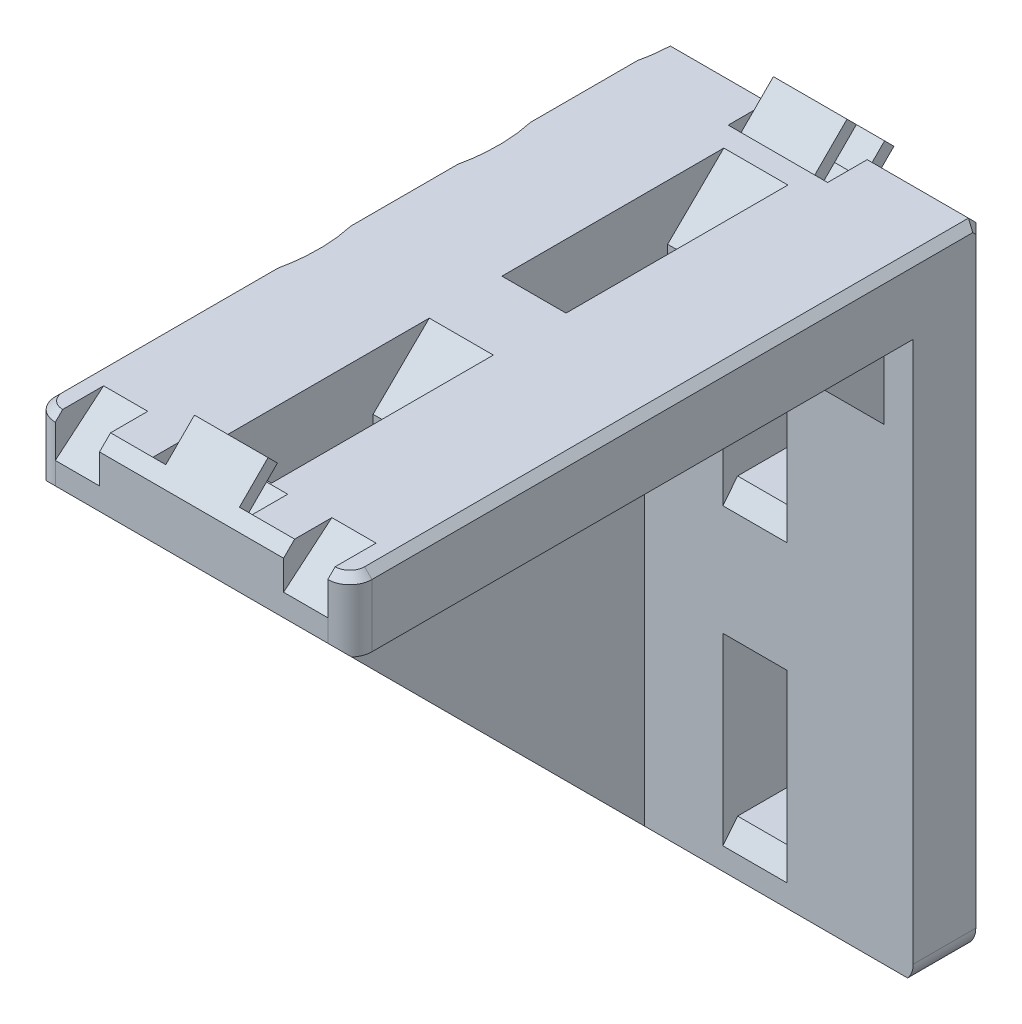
ISO-10303-21;
HEADER;
FILE_DESCRIPTION(('STEP AP214'),'2;1');
FILE_NAME('part.step','',(''),(''),'','','');
FILE_SCHEMA(('AUTOMOTIVE_DESIGN { 1 0 10303 214 1 1 1 1 }'));
ENDSEC;
DATA;
#1=APPLICATION_CONTEXT('core data for automotive mechanical design processes');
#2=APPLICATION_PROTOCOL_DEFINITION('international standard','automotive_design',2000,#1);
#3=PRODUCT_CONTEXT('',#1,'mechanical');
#4=PRODUCT('Part','Part','',(#3));
#5=PRODUCT_RELATED_PRODUCT_CATEGORY('part','',(#4));
#6=PRODUCT_DEFINITION_FORMATION('','',#4);
#7=PRODUCT_DEFINITION_CONTEXT('part definition',#1,'design');
#8=PRODUCT_DEFINITION('design','',#6,#7);
#9=PRODUCT_DEFINITION_SHAPE('','',#8);
#10=(LENGTH_UNIT() NAMED_UNIT(*) SI_UNIT(.MILLI.,.METRE.));
#11=(NAMED_UNIT(*) PLANE_ANGLE_UNIT() SI_UNIT($,.RADIAN.));
#12=(NAMED_UNIT(*) SI_UNIT($,.STERADIAN.) SOLID_ANGLE_UNIT());
#13=UNCERTAINTY_MEASURE_WITH_UNIT(LENGTH_MEASURE(1.E-05),#10,'distance_accuracy_value','');
#14=(GEOMETRIC_REPRESENTATION_CONTEXT(3) GLOBAL_UNCERTAINTY_ASSIGNED_CONTEXT((#13)) GLOBAL_UNIT_ASSIGNED_CONTEXT((#10,
#11,#12)) REPRESENTATION_CONTEXT('',''));
#15=CARTESIAN_POINT('',(0.,0.,0.));
#16=DIRECTION('',(0.,0.,1.));
#17=DIRECTION('',(1.,0.,0.));
#18=AXIS2_PLACEMENT_3D('',#15,#16,#17);
#19=CARTESIAN_POINT('',(5.,4.38406204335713,1.989949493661));
#20=DIRECTION('',(0.,0.707106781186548,-0.707106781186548));
#21=DIRECTION('',(0.,0.707106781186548,0.707106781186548));
#22=AXIS2_PLACEMENT_3D('',#19,#20,#21);
#23=PLANE('',#22);
#24=DIRECTION('',(0.,-0.70710678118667,-0.707106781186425));
#25=VECTOR('',#24,1.);
#26=CARTESIAN_POINT('',(-5.,4.38406204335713,1.989949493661));
#27=LINE('',#26,#25);
#28=CARTESIAN_POINT('',(-5.,4.3840620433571,1.98994949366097));
#29=VERTEX_POINT('',#28);
#30=CARTESIAN_POINT('',(-5.,3.11126983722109,0.717157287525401));
#31=VERTEX_POINT('',#30);
#32=EDGE_CURVE('E1249',#29,#31,#27,.T.);
#33=ORIENTED_EDGE('',*,*,#32,.F.);
#34=DIRECTION('',(1.,0.,0.));
#35=VECTOR('',#34,1.);
#36=CARTESIAN_POINT('',(5.,4.3840620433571,1.98994949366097));
#37=LINE('',#36,#35);
#38=CARTESIAN_POINT('',(5.,4.38406204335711,1.98994949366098));
#39=VERTEX_POINT('',#38);
#40=EDGE_CURVE('E1125',#39,#29,#37,.F.);
#41=ORIENTED_EDGE('',*,*,#40,.F.);
#42=DIRECTION('',(0.,-0.70710678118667,-0.707106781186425));
#43=VECTOR('',#42,1.);
#44=CARTESIAN_POINT('',(5.,4.38406204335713,1.989949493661));
#45=LINE('',#44,#43);
#46=CARTESIAN_POINT('',(5.,3.11126983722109,0.7171572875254));
#47=VERTEX_POINT('',#46);
#48=EDGE_CURVE('E1246',#39,#47,#45,.T.);
#49=ORIENTED_EDGE('',*,*,#48,.T.);
#50=DIRECTION('',(1.,0.,0.));
#51=VECTOR('',#50,1.);
#52=CARTESIAN_POINT('',(5.,3.11126983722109,0.7171572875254));
#53=LINE('',#52,#51);
#54=EDGE_CURVE('E1240',#31,#47,#53,.T.);
#55=ORIENTED_EDGE('',*,*,#54,.F.);
#56=EDGE_LOOP('',(#33,#41,#49,#55));
#57=FACE_BOUND('',#56,.T.);
#58=ADVANCED_FACE('F16',(#57),#23,.T.);
#59=CARTESIAN_POINT('',(-5.,0.,0.));
#60=DIRECTION('',(-1.,0.,0.));
#61=DIRECTION('',(0.,-1.,0.));
#62=AXIS2_PLACEMENT_3D('',#59,#60,#61);
#63=PLANE('',#62);
#64=ORIENTED_EDGE('',*,*,#32,.T.);
#65=DIRECTION('',(0.,0.707106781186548,-0.707106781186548));
#66=VECTOR('',#65,1.);
#67=CARTESIAN_POINT('',(-5.,3.11126983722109,0.717157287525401));
#68=LINE('',#67,#66);
#69=CARTESIAN_POINT('',(-5.,-1.27279220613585,5.10121933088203));
#70=VERTEX_POINT('',#69);
#71=EDGE_CURVE('E1243',#70,#31,#68,.T.);
#72=ORIENTED_EDGE('',*,*,#71,.F.);
#73=DIRECTION('',(0.,-0.707106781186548,-0.707106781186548));
#74=VECTOR('',#73,1.);
#75=CARTESIAN_POINT('',(-5.,-2.40918830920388,3.964823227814));
#76=LINE('',#75,#74);
#77=CARTESIAN_POINT('',(-5.,0.,6.37401153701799));
#78=VERTEX_POINT('',#77);
#79=EDGE_CURVE('E1131',#70,#78,#76,.F.);
#80=ORIENTED_EDGE('',*,*,#79,.T.);
#81=DIRECTION('',(0.,-0.707106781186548,0.707106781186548));
#82=VECTOR('',#81,1.);
#83=CARTESIAN_POINT('',(-5.,0.,6.374011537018));
#84=LINE('',#83,#82);
#85=EDGE_CURVE('E1129',#29,#78,#84,.T.);
#86=ORIENTED_EDGE('',*,*,#85,.F.);
#87=EDGE_LOOP('',(#64,#72,#80,#86));
#88=FACE_BOUND('',#87,.T.);
#89=ADVANCED_FACE('F1609',(#88),#63,.T.);
#90=CARTESIAN_POINT('',(5.,0.,0.));
#91=DIRECTION('',(-1.,0.,0.));
#92=DIRECTION('',(0.,-1.,0.));
#93=AXIS2_PLACEMENT_3D('',#90,#91,#92);
#94=PLANE('',#93);
#95=DIRECTION('',(0.,0.707106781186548,-0.707106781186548));
#96=VECTOR('',#95,1.);
#97=CARTESIAN_POINT('',(5.,3.11126983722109,0.7171572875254));
#98=LINE('',#97,#96);
#99=CARTESIAN_POINT('',(5.00000000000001,-1.27279220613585,5.10121933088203));
#100=VERTEX_POINT('',#99);
#101=EDGE_CURVE('E1238',#47,#100,#98,.F.);
#102=ORIENTED_EDGE('',*,*,#101,.F.);
#103=ORIENTED_EDGE('',*,*,#48,.F.);
#104=DIRECTION('',(0.,-0.707106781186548,0.707106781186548));
#105=VECTOR('',#104,1.);
#106=CARTESIAN_POINT('',(5.,0.,6.374011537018));
#107=LINE('',#106,#105);
#108=CARTESIAN_POINT('',(5.,0.,6.37401153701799));
#109=VERTEX_POINT('',#108);
#110=EDGE_CURVE('E1122',#109,#39,#107,.F.);
#111=ORIENTED_EDGE('',*,*,#110,.F.);
#112=DIRECTION('',(0.,-0.707106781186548,-0.707106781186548));
#113=VECTOR('',#112,1.);
#114=CARTESIAN_POINT('',(5.00000000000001,-2.40918830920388,3.964823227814));
#115=LINE('',#114,#113);
#116=EDGE_CURVE('E1111',#109,#100,#115,.T.);
#117=ORIENTED_EDGE('',*,*,#116,.T.);
#118=EDGE_LOOP('',(#102,#103,#111,#117));
#119=FACE_BOUND('',#118,.T.);
#120=ADVANCED_FACE('F1606',(#119),#94,.F.);
#121=CARTESIAN_POINT('',(5.,3.11126983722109,0.7171572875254));
#122=DIRECTION('',(0.,-0.707106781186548,-0.707106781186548));
#123=DIRECTION('',(0.,0.707106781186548,-0.707106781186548));
#124=AXIS2_PLACEMENT_3D('',#121,#122,#123);
#125=PLANE('',#124);
#126=ORIENTED_EDGE('',*,*,#54,.T.);
#127=ORIENTED_EDGE('',*,*,#101,.T.);
#128=DIRECTION('',(1.,0.,0.));
#129=VECTOR('',#128,1.);
#130=CARTESIAN_POINT('',(-6.75,-1.27279220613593,5.10121933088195));
#131=LINE('',#130,#129);
#132=EDGE_CURVE('E1096',#100,#70,#131,.F.);
#133=ORIENTED_EDGE('',*,*,#132,.T.);
#134=ORIENTED_EDGE('',*,*,#71,.T.);
#135=EDGE_LOOP('',(#126,#127,#133,#134));
#136=FACE_BOUND('',#135,.T.);
#137=ADVANCED_FACE('F1602',(#136),#125,.T.);
#138=CARTESIAN_POINT('',(5.,-1.98994949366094,-4.384062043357));
#139=DIRECTION('',(0.,-0.707106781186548,0.707106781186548));
#140=DIRECTION('',(0.,-0.707106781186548,-0.707106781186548));
#141=AXIS2_PLACEMENT_3D('',#138,#139,#140);
#142=PLANE('',#141);
#143=DIRECTION('',(1.,0.,0.));
#144=VECTOR('',#143,1.);
#145=CARTESIAN_POINT('',(5.,-1.98994949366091,-4.38406204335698));
#146=LINE('',#145,#144);
#147=CARTESIAN_POINT('',(5.,-1.98994949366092,-4.38406204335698));
#148=VERTEX_POINT('',#147);
#149=CARTESIAN_POINT('',(-5.,-1.98994949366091,-4.38406204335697));
#150=VERTEX_POINT('',#149);
#151=EDGE_CURVE('E1052',#148,#150,#146,.F.);
#152=ORIENTED_EDGE('',*,*,#151,.T.);
#153=DIRECTION('',(0.,0.707106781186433,0.707106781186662));
#154=VECTOR('',#153,1.);
#155=CARTESIAN_POINT('',(-5.,-1.98994949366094,-4.384062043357));
#156=LINE('',#155,#154);
#157=CARTESIAN_POINT('',(-5.,-0.717157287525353,-3.111269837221));
#158=VERTEX_POINT('',#157);
#159=EDGE_CURVE('E1211',#150,#158,#156,.T.);
#160=ORIENTED_EDGE('',*,*,#159,.T.);
#161=DIRECTION('',(1.,0.,0.));
#162=VECTOR('',#161,1.);
#163=CARTESIAN_POINT('',(5.,-0.717157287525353,-3.111269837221));
#164=LINE('',#163,#162);
#165=CARTESIAN_POINT('',(5.,-0.717157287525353,-3.111269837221));
#166=VERTEX_POINT('',#165);
#167=EDGE_CURVE('E1216',#158,#166,#164,.T.);
#168=ORIENTED_EDGE('',*,*,#167,.T.);
#169=DIRECTION('',(0.,0.707106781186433,0.707106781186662));
#170=VECTOR('',#169,1.);
#171=CARTESIAN_POINT('',(5.,-1.98994949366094,-4.384062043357));
#172=LINE('',#171,#170);
#173=EDGE_CURVE('E1197',#148,#166,#172,.T.);
#174=ORIENTED_EDGE('',*,*,#173,.F.);
#175=EDGE_LOOP('',(#152,#160,#168,#174));
#176=FACE_BOUND('',#175,.T.);
#177=ADVANCED_FACE('F1598',(#176),#142,.F.);
#178=CARTESIAN_POINT('',(5.,-0.717157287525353,-3.111269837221));
#179=DIRECTION('',(0.,-0.707106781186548,-0.707106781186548));
#180=DIRECTION('',(0.,0.707106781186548,-0.707106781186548));
#181=AXIS2_PLACEMENT_3D('',#178,#179,#180);
#182=PLANE('',#181);
#183=DIRECTION('',(0.,-0.707106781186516,0.707106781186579));
#184=VECTOR('',#183,1.);
#185=CARTESIAN_POINT('',(5.,-0.717157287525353,-3.111269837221));
#186=LINE('',#185,#184);
#187=CARTESIAN_POINT('',(5.00000000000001,-5.10121933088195,1.27279220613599));
#188=VERTEX_POINT('',#187);
#189=EDGE_CURVE('E1187',#166,#188,#186,.T.);
#190=ORIENTED_EDGE('',*,*,#189,.F.);
#191=ORIENTED_EDGE('',*,*,#167,.F.);
#192=DIRECTION('',(0.,-0.707106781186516,0.707106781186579));
#193=VECTOR('',#192,1.);
#194=CARTESIAN_POINT('',(-5.,-0.717157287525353,-3.111269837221));
#195=LINE('',#194,#193);
#196=CARTESIAN_POINT('',(-5.,-5.10121933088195,1.27279220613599));
#197=VERTEX_POINT('',#196);
#198=EDGE_CURVE('E1208',#158,#197,#195,.T.);
#199=ORIENTED_EDGE('',*,*,#198,.T.);
#200=DIRECTION('',(1.,0.,0.));
#201=VECTOR('',#200,1.);
#202=CARTESIAN_POINT('',(-6.75,-5.10121933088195,1.27279220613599));
#203=LINE('',#202,#201);
#204=EDGE_CURVE('E1059',#188,#197,#203,.F.);
#205=ORIENTED_EDGE('',*,*,#204,.F.);
#206=EDGE_LOOP('',(#190,#191,#199,#205));
#207=FACE_BOUND('',#206,.T.);
#208=ADVANCED_FACE('F1594',(#207),#182,.F.);
#209=CARTESIAN_POINT('',(-5.,0.,0.));
#210=DIRECTION('',(1.,0.,0.));
#211=DIRECTION('',(0.,1.,0.));
#212=AXIS2_PLACEMENT_3D('',#209,#210,#211);
#213=PLANE('',#212);
#214=ORIENTED_EDGE('',*,*,#198,.F.);
#215=ORIENTED_EDGE('',*,*,#159,.F.);
#216=DIRECTION('',(0.,-0.707106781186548,0.707106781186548));
#217=VECTOR('',#216,1.);
#218=CARTESIAN_POINT('',(-5.,-6.37401153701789,0.));
#219=LINE('',#218,#217);
#220=CARTESIAN_POINT('',(-5.,-6.3740115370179,0.));
#221=VERTEX_POINT('',#220);
#222=EDGE_CURVE('E1056',#150,#221,#219,.T.);
#223=ORIENTED_EDGE('',*,*,#222,.T.);
#224=DIRECTION('',(0.,0.707106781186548,0.707106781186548));
#225=VECTOR('',#224,1.);
#226=CARTESIAN_POINT('',(-5.,-3.96482322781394,2.409188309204));
#227=LINE('',#226,#225);
#228=EDGE_CURVE('E1066',#197,#221,#227,.F.);
#229=ORIENTED_EDGE('',*,*,#228,.F.);
#230=EDGE_LOOP('',(#214,#215,#223,#229));
#231=FACE_BOUND('',#230,.T.);
#232=ADVANCED_FACE('F1590',(#231),#213,.F.);
#233=CARTESIAN_POINT('',(5.,0.,0.));
#234=DIRECTION('',(1.,0.,0.));
#235=DIRECTION('',(0.,1.,0.));
#236=AXIS2_PLACEMENT_3D('',#233,#234,#235);
#237=PLANE('',#236);
#238=ORIENTED_EDGE('',*,*,#173,.T.);
#239=ORIENTED_EDGE('',*,*,#189,.T.);
#240=DIRECTION('',(0.,0.707106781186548,0.707106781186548));
#241=VECTOR('',#240,1.);
#242=CARTESIAN_POINT('',(5.00000000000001,-3.96482322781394,2.409188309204));
#243=LINE('',#242,#241);
#244=CARTESIAN_POINT('',(5.,-6.3740115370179,0.));
#245=VERTEX_POINT('',#244);
#246=EDGE_CURVE('E1037',#245,#188,#243,.T.);
#247=ORIENTED_EDGE('',*,*,#246,.F.);
#248=DIRECTION('',(0.,-0.707106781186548,0.707106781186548));
#249=VECTOR('',#248,1.);
#250=CARTESIAN_POINT('',(5.,-6.37401153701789,0.));
#251=LINE('',#250,#249);
#252=EDGE_CURVE('E1049',#245,#148,#251,.F.);
#253=ORIENTED_EDGE('',*,*,#252,.T.);
#254=EDGE_LOOP('',(#238,#239,#247,#253));
#255=FACE_BOUND('',#254,.T.);
#256=ADVANCED_FACE('F1586',(#255),#237,.T.);
#257=CARTESIAN_POINT('',(-6.75,-1.77279220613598,1.772792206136));
#258=DIRECTION('',(0.,-0.707106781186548,0.707106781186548));
#259=DIRECTION('',(0.,-0.707106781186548,-0.707106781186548));
#260=AXIS2_PLACEMENT_3D('',#257,#258,#259);
#261=PLANE('',#260);
#262=DIRECTION('',(1.,0.,0.));
#263=VECTOR('',#262,1.);
#264=CARTESIAN_POINT('',(-6.75,-0.99497474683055,2.550609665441));
#265=LINE('',#264,#263);
#266=CARTESIAN_POINT('',(-6.75,-0.99497474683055,2.550609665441));
#267=VERTEX_POINT('',#266);
#268=CARTESIAN_POINT('',(6.75,-0.99497474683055,2.550609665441));
#269=VERTEX_POINT('',#268);
#270=EDGE_CURVE('E1184',#267,#269,#265,.T.);
#271=ORIENTED_EDGE('',*,*,#270,.T.);
#272=DIRECTION('',(0.,0.707106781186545,0.70710678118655));
#273=VECTOR('',#272,1.);
#274=CARTESIAN_POINT('',(6.75,-2.55060966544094,0.9949747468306));
#275=LINE('',#274,#273);
#276=CARTESIAN_POINT('',(6.75,-2.55060966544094,0.9949747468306));
#277=VERTEX_POINT('',#276);
#278=EDGE_CURVE('E1040',#277,#269,#275,.T.);
#279=ORIENTED_EDGE('',*,*,#278,.F.);
#280=DIRECTION('',(1.,0.,0.));
#281=VECTOR('',#280,1.);
#282=CARTESIAN_POINT('',(-6.75,-2.55060966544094,0.9949747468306));
#283=LINE('',#282,#281);
#284=CARTESIAN_POINT('',(-6.75,-2.55060966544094,0.9949747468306));
#285=VERTEX_POINT('',#284);
#286=EDGE_CURVE('E1126',#285,#277,#283,.T.);
#287=ORIENTED_EDGE('',*,*,#286,.F.);
#288=DIRECTION('',(0.,0.707106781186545,0.70710678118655));
#289=VECTOR('',#288,1.);
#290=CARTESIAN_POINT('',(-6.75,-2.55060966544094,0.9949747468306));
#291=LINE('',#290,#289);
#292=EDGE_CURVE('E1205',#285,#267,#291,.T.);
#293=ORIENTED_EDGE('',*,*,#292,.T.);
#294=EDGE_LOOP('',(#271,#279,#287,#293));
#295=FACE_BOUND('',#294,.T.);
#296=ADVANCED_FACE('F1582',(#295),#261,.F.);
#297=CARTESIAN_POINT('',(-6.75,-0.99497474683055,2.550609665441));
#298=DIRECTION('',(0.,-0.707106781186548,-0.707106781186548));
#299=DIRECTION('',(0.,0.707106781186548,-0.707106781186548));
#300=AXIS2_PLACEMENT_3D('',#297,#298,#299);
#301=PLANE('',#300);
#302=DIRECTION('',(1.,0.,0.));
#303=VECTOR('',#302,1.);
#304=CARTESIAN_POINT('',(-6.75,-2.40918830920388,3.964823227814));
#305=LINE('',#304,#303);
#306=CARTESIAN_POINT('',(-6.75,-2.40918830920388,3.964823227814));
#307=VERTEX_POINT('',#306);
#308=CARTESIAN_POINT('',(6.75,-2.40918830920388,3.964823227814));
#309=VERTEX_POINT('',#308);
#310=EDGE_CURVE('E1114',#307,#309,#305,.T.);
#311=ORIENTED_EDGE('',*,*,#310,.T.);
#312=DIRECTION('',(0.,-0.70710678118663,0.707106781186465));
#313=VECTOR('',#312,1.);
#314=CARTESIAN_POINT('',(6.75,-0.99497474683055,2.550609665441));
#315=LINE('',#314,#313);
#316=EDGE_CURVE('E1103',#269,#309,#315,.T.);
#317=ORIENTED_EDGE('',*,*,#316,.F.);
#318=ORIENTED_EDGE('',*,*,#270,.F.);
#319=DIRECTION('',(0.,-0.70710678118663,0.707106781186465));
#320=VECTOR('',#319,1.);
#321=CARTESIAN_POINT('',(-6.75,-0.99497474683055,2.550609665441));
#322=LINE('',#321,#320);
#323=EDGE_CURVE('E1146',#267,#307,#322,.T.);
#324=ORIENTED_EDGE('',*,*,#323,.T.);
#325=EDGE_LOOP('',(#311,#317,#318,#324));
#326=FACE_BOUND('',#325,.T.);
#327=ADVANCED_FACE('F1578',(#326),#301,.F.);
#328=CARTESIAN_POINT('',(-6.75,-2.55060966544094,0.9949747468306));
#329=DIRECTION('',(0.,-0.707106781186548,-0.707106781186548));
#330=DIRECTION('',(0.,0.707106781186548,-0.707106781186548));
#331=AXIS2_PLACEMENT_3D('',#328,#329,#330);
#332=PLANE('',#331);
#333=DIRECTION('',(0.,0.707106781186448,-0.707106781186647));
#334=VECTOR('',#333,1.);
#335=CARTESIAN_POINT('',(6.75,-3.96482322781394,2.409188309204));
#336=LINE('',#335,#334);
#337=CARTESIAN_POINT('',(6.75,-3.96482322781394,2.409188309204));
#338=VERTEX_POINT('',#337);
#339=EDGE_CURVE('E1020',#338,#277,#336,.T.);
#340=ORIENTED_EDGE('',*,*,#339,.F.);
#341=DIRECTION('',(1.,0.,0.));
#342=VECTOR('',#341,1.);
#343=CARTESIAN_POINT('',(-6.75,-3.96482322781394,2.409188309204));
#344=LINE('',#343,#342);
#345=CARTESIAN_POINT('',(-6.75,-3.96482322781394,2.409188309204));
#346=VERTEX_POINT('',#345);
#347=EDGE_CURVE('E1041',#346,#338,#344,.T.);
#348=ORIENTED_EDGE('',*,*,#347,.F.);
#349=DIRECTION('',(0.,0.707106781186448,-0.707106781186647));
#350=VECTOR('',#349,1.);
#351=CARTESIAN_POINT('',(-6.75,-3.96482322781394,2.409188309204));
#352=LINE('',#351,#350);
#353=EDGE_CURVE('E678',#346,#285,#352,.T.);
#354=ORIENTED_EDGE('',*,*,#353,.T.);
#355=ORIENTED_EDGE('',*,*,#286,.T.);
#356=EDGE_LOOP('',(#340,#348,#354,#355));
#357=FACE_BOUND('',#356,.T.);
#358=ADVANCED_FACE('F1574',(#357),#332,.T.);
#359=CARTESIAN_POINT('',(5.,2.61629509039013,79.33812049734));
#360=DIRECTION('',(0.,-0.707106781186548,-0.707106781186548));
#361=DIRECTION('',(0.,0.707106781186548,-0.707106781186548));
#362=AXIS2_PLACEMENT_3D('',#359,#360,#361);
#363=PLANE('',#362);
#364=DIRECTION('',(1.,0.,0.));
#365=VECTOR('',#364,1.);
#366=CARTESIAN_POINT('',(5.,2.61629509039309,79.338120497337));
#367=LINE('',#366,#365);
#368=CARTESIAN_POINT('',(5.,2.61629509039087,79.3381204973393));
#369=VERTEX_POINT('',#368);
#370=CARTESIAN_POINT('',(-5.,2.61629509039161,79.3381204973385));
#371=VERTEX_POINT('',#370);
#372=EDGE_CURVE('E953',#369,#371,#367,.F.);
#373=ORIENTED_EDGE('',*,*,#372,.F.);
#374=DIRECTION('',(0.,-0.707106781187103,0.707106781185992));
#375=VECTOR('',#374,1.);
#376=CARTESIAN_POINT('',(5.,2.61629509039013,79.33812049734));
#377=LINE('',#376,#375);
#378=CARTESIAN_POINT('',(5.,-1.27279220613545,83.2272077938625));
#379=VERTEX_POINT('',#378);
#380=EDGE_CURVE('E961',#369,#379,#377,.T.);
#381=ORIENTED_EDGE('',*,*,#380,.T.);
#382=DIRECTION('',(1.,0.,0.));
#383=VECTOR('',#382,1.);
#384=CARTESIAN_POINT('',(-6.75,-1.27279220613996,83.227207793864));
#385=LINE('',#384,#383);
#386=CARTESIAN_POINT('',(-5.,-1.27279220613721,83.2272077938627));
#387=VERTEX_POINT('',#386);
#388=EDGE_CURVE('E964',#379,#387,#385,.F.);
#389=ORIENTED_EDGE('',*,*,#388,.T.);
#390=DIRECTION('',(0.,-0.707106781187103,0.707106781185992));
#391=VECTOR('',#390,1.);
#392=CARTESIAN_POINT('',(-5.,2.61629509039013,79.33812049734));
#393=LINE('',#392,#391);
#394=EDGE_CURVE('E944',#371,#387,#393,.T.);
#395=ORIENTED_EDGE('',*,*,#394,.F.);
#396=EDGE_LOOP('',(#373,#381,#389,#395));
#397=FACE_BOUND('',#396,.T.);
#398=ADVANCED_FACE('F1570',(#397),#363,.T.);
#399=CARTESIAN_POINT('',(4.99999999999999,-79.33812049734,-2.61629509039));
#400=DIRECTION('',(0.,-0.707106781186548,-0.707106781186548));
#401=DIRECTION('',(0.,0.707106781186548,-0.707106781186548));
#402=AXIS2_PLACEMENT_3D('',#399,#400,#401);
#403=PLANE('',#402);
#404=DIRECTION('',(0.,-0.707106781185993,0.707106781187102));
#405=VECTOR('',#404,1.);
#406=CARTESIAN_POINT('',(4.99999999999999,-79.33812049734,-2.61629509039));
#407=LINE('',#406,#405);
#408=CARTESIAN_POINT('',(4.99999999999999,-79.338120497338,-2.61629509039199));
#409=VERTEX_POINT('',#408);
#410=CARTESIAN_POINT('',(5.,-83.2272077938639,1.27279220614));
#411=VERTEX_POINT('',#410);
#412=EDGE_CURVE('E947',#409,#411,#407,.T.);
#413=ORIENTED_EDGE('',*,*,#412,.F.);
#414=DIRECTION('',(1.,0.,0.));
#415=VECTOR('',#414,1.);
#416=CARTESIAN_POINT('',(4.99999999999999,-79.338120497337,-2.61629509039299));
#417=LINE('',#416,#415);
#418=CARTESIAN_POINT('',(-5.00000000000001,-79.338120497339,-2.616295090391));
#419=VERTEX_POINT('',#418);
#420=EDGE_CURVE('E900',#409,#419,#417,.F.);
#421=ORIENTED_EDGE('',*,*,#420,.T.);
#422=DIRECTION('',(0.,-0.707106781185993,0.707106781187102));
#423=VECTOR('',#422,1.);
#424=CARTESIAN_POINT('',(-5.00000000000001,-79.33812049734,-2.61629509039));
#425=LINE('',#424,#423);
#426=CARTESIAN_POINT('',(-5.00000000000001,-83.2272077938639,1.27279220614));
#427=VERTEX_POINT('',#426);
#428=EDGE_CURVE('E889',#419,#427,#425,.T.);
#429=ORIENTED_EDGE('',*,*,#428,.T.);
#430=DIRECTION('',(1.,0.,0.));
#431=VECTOR('',#430,1.);
#432=CARTESIAN_POINT('',(-6.75000000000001,-83.2272077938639,1.27279220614));
#433=LINE('',#432,#431);
#434=EDGE_CURVE('E877',#411,#427,#433,.F.);
#435=ORIENTED_EDGE('',*,*,#434,.F.);
#436=EDGE_LOOP('',(#413,#421,#429,#435));
#437=FACE_BOUND('',#436,.T.);
#438=ADVANCED_FACE('F1566',(#437),#403,.F.);
#439=CARTESIAN_POINT('',(5.,0.,6.374011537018));
#440=DIRECTION('',(0.,0.707106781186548,0.707106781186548));
#441=DIRECTION('',(0.,-0.707106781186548,0.707106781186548));
#442=AXIS2_PLACEMENT_3D('',#439,#440,#441);
#443=PLANE('',#442);
#444=ORIENTED_EDGE('',*,*,#40,.T.);
#445=ORIENTED_EDGE('',*,*,#85,.T.);
#446=DIRECTION('',(1.,0.,0.));
#447=VECTOR('',#446,1.);
#448=CARTESIAN_POINT('',(0.,0.,6.374011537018));
#449=LINE('',#448,#447);
#450=EDGE_CURVE('E1108',#78,#109,#449,.T.);
#451=ORIENTED_EDGE('',*,*,#450,.T.);
#452=ORIENTED_EDGE('',*,*,#110,.T.);
#453=EDGE_LOOP('',(#444,#445,#451,#452));
#454=FACE_BOUND('',#453,.T.);
#455=ADVANCED_FACE('F1562',(#454),#443,.T.);
#456=CARTESIAN_POINT('',(-6.75,-2.40918830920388,3.964823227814));
#457=DIRECTION('',(0.,-0.707106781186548,0.707106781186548));
#458=DIRECTION('',(0.,-0.707106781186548,-0.707106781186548));
#459=AXIS2_PLACEMENT_3D('',#456,#457,#458);
#460=PLANE('',#459);
#461=ORIENTED_EDGE('',*,*,#116,.F.);
#462=DIRECTION('',(1.,0.,0.));
#463=VECTOR('',#462,1.);
#464=CARTESIAN_POINT('',(0.,0.,6.374011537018));
#465=LINE('',#464,#463);
#466=CARTESIAN_POINT('',(6.75,0.,6.374011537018));
#467=VERTEX_POINT('',#466);
#468=EDGE_CURVE('E1099',#109,#467,#465,.T.);
#469=ORIENTED_EDGE('',*,*,#468,.T.);
#470=DIRECTION('',(0.,0.70710678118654,0.707106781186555));
#471=VECTOR('',#470,1.);
#472=CARTESIAN_POINT('',(6.75,-2.40918830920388,3.964823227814));
#473=LINE('',#472,#471);
#474=EDGE_CURVE('E1030',#309,#467,#473,.T.);
#475=ORIENTED_EDGE('',*,*,#474,.F.);
#476=ORIENTED_EDGE('',*,*,#310,.F.);
#477=DIRECTION('',(0.,0.70710678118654,0.707106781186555));
#478=VECTOR('',#477,1.);
#479=CARTESIAN_POINT('',(-6.75,-2.40918830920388,3.964823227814));
#480=LINE('',#479,#478);
#481=CARTESIAN_POINT('',(-6.75,0.,6.374011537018));
#482=VERTEX_POINT('',#481);
#483=EDGE_CURVE('E1079',#307,#482,#480,.T.);
#484=ORIENTED_EDGE('',*,*,#483,.T.);
#485=DIRECTION('',(1.,0.,0.));
#486=VECTOR('',#485,1.);
#487=CARTESIAN_POINT('',(0.,0.,6.374011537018));
#488=LINE('',#487,#486);
#489=EDGE_CURVE('E1119',#482,#78,#488,.T.);
#490=ORIENTED_EDGE('',*,*,#489,.T.);
#491=ORIENTED_EDGE('',*,*,#79,.F.);
#492=ORIENTED_EDGE('',*,*,#132,.F.);
#493=EDGE_LOOP('',(#461,#469,#475,#476,#484,#490,#491,#492));
#494=FACE_BOUND('',#493,.T.);
#495=ADVANCED_FACE('F1558',(#494),#460,.F.);
#496=CARTESIAN_POINT('',(6.75,0.,0.));
#497=DIRECTION('',(-1.,0.,0.));
#498=DIRECTION('',(0.,-1.,0.));
#499=AXIS2_PLACEMENT_3D('',#496,#497,#498);
#500=PLANE('',#499);
#501=DIRECTION('',(0.,0.707106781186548,-0.707106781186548));
#502=VECTOR('',#501,1.);
#503=CARTESIAN_POINT('',(6.75000000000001,0.,79.69167388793));
#504=LINE('',#503,#502);
#505=CARTESIAN_POINT('',(6.75,0.,79.69167388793));
#506=VERTEX_POINT('',#505);
#507=CARTESIAN_POINT('',(6.75000000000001,-2.40416305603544,82.0958369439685));
#508=VERTEX_POINT('',#507);
#509=EDGE_CURVE('E1094',#506,#508,#504,.F.);
#510=ORIENTED_EDGE('',*,*,#509,.T.);
#511=DIRECTION('',(0.,-0.707106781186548,-0.707106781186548));
#512=VECTOR('',#511,1.);
#513=CARTESIAN_POINT('',(6.75000000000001,-2.40416305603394,82.09583694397));
#514=LINE('',#513,#512);
#515=CARTESIAN_POINT('',(6.75,-1.79400084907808E-13,84.5000000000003));
#516=VERTEX_POINT('',#515);
#517=EDGE_CURVE('E966',#508,#516,#514,.F.);
#518=ORIENTED_EDGE('',*,*,#517,.T.);
#519=DIRECTION('',(0.,0.,1.));
#520=VECTOR('',#519,1.);
#521=CARTESIAN_POINT('',(6.75,0.,0.));
#522=LINE('',#521,#520);
#523=EDGE_CURVE('E785',#516,#506,#522,.F.);
#524=ORIENTED_EDGE('',*,*,#523,.T.);
#525=EDGE_LOOP('',(#510,#518,#524));
#526=FACE_BOUND('',#525,.T.);
#527=ADVANCED_FACE('F1554',(#526),#500,.T.);
#528=CARTESIAN_POINT('',(-6.75,0.,79.69167388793));
#529=DIRECTION('',(0.,-0.707106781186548,-0.707106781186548));
#530=DIRECTION('',(0.,0.707106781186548,-0.707106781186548));
#531=AXIS2_PLACEMENT_3D('',#528,#529,#530);
#532=PLANE('',#531);
#533=DIRECTION('',(0.,-0.707106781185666,0.707106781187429));
#534=VECTOR('',#533,1.);
#535=CARTESIAN_POINT('',(-6.75,0.,79.69167388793));
#536=LINE('',#535,#534);
#537=CARTESIAN_POINT('',(-6.75,0.,79.69167388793));
#538=VERTEX_POINT('',#537);
#539=CARTESIAN_POINT('',(-6.75,-2.40416305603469,82.0958369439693));
#540=VERTEX_POINT('',#539);
#541=EDGE_CURVE('E1084',#538,#540,#536,.T.);
#542=ORIENTED_EDGE('',*,*,#541,.T.);
#543=DIRECTION('',(1.,0.,0.));
#544=VECTOR('',#543,1.);
#545=CARTESIAN_POINT('',(-6.75,-2.40416305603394,82.09583694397));
#546=LINE('',#545,#544);
#547=EDGE_CURVE('E969',#540,#508,#546,.T.);
#548=ORIENTED_EDGE('',*,*,#547,.T.);
#549=ORIENTED_EDGE('',*,*,#509,.F.);
#550=DIRECTION('',(1.,0.,0.));
#551=VECTOR('',#550,1.);
#552=CARTESIAN_POINT('',(0.,0.,79.69167388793));
#553=LINE('',#552,#551);
#554=EDGE_CURVE('E782',#506,#538,#553,.F.);
#555=ORIENTED_EDGE('',*,*,#554,.T.);
#556=EDGE_LOOP('',(#542,#548,#549,#555));
#557=FACE_BOUND('',#556,.T.);
#558=ADVANCED_FACE('F1550',(#557),#532,.F.);
#559=CARTESIAN_POINT('',(-6.75,0.,0.));
#560=DIRECTION('',(-1.,0.,0.));
#561=DIRECTION('',(0.,-1.,0.));
#562=AXIS2_PLACEMENT_3D('',#559,#560,#561);
#563=PLANE('',#562);
#564=DIRECTION('',(0.,-0.707106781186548,-0.707106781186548));
#565=VECTOR('',#564,1.);
#566=CARTESIAN_POINT('',(-6.75,-2.40416305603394,82.09583694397));
#567=LINE('',#566,#565);
#568=CARTESIAN_POINT('',(-6.75,-4.28512313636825E-13,84.5000000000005));
#569=VERTEX_POINT('',#568);
#570=EDGE_CURVE('E972',#569,#540,#567,.T.);
#571=ORIENTED_EDGE('',*,*,#570,.T.);
#572=ORIENTED_EDGE('',*,*,#541,.F.);
#573=DIRECTION('',(0.,0.,1.));
#574=VECTOR('',#573,1.);
#575=CARTESIAN_POINT('',(-6.75,0.,0.));
#576=LINE('',#575,#574);
#577=EDGE_CURVE('E779',#538,#569,#576,.T.);
#578=ORIENTED_EDGE('',*,*,#577,.T.);
#579=EDGE_LOOP('',(#571,#572,#578));
#580=FACE_BOUND('',#579,.T.);
#581=ADVANCED_FACE('F1546',(#580),#563,.F.);
#582=CARTESIAN_POINT('',(20.5,0.,1.));
#583=DIRECTION('',(-0.707106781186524,-0.500000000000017,0.500000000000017));
#584=DIRECTION('',(0.577350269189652,0.,0.816496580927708));
#585=AXIS2_PLACEMENT_3D('',#582,#583,#584);
#586=PLANE('',#585);
#587=DIRECTION('',(-0.678598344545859,0.67859834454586,-0.28108463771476));
#588=VECTOR('',#587,1.);
#589=CARTESIAN_POINT('',(21.5,-0.999999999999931,1.414213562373));
#590=LINE('',#589,#588);
#591=CARTESIAN_POINT('',(21.5,-0.99999999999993,1.414213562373));
#592=VERTEX_POINT('',#591);
#593=CARTESIAN_POINT('',(20.5,0.,1.));
#594=VERTEX_POINT('',#593);
#595=EDGE_CURVE('E754',#592,#594,#590,.T.);
#596=ORIENTED_EDGE('',*,*,#595,.F.);
#597=DIRECTION('',(0.,0.707106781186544,0.707106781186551));
#598=VECTOR('',#597,1.);
#599=CARTESIAN_POINT('',(21.5,-1.41421356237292,1.));
#600=LINE('',#599,#598);
#601=CARTESIAN_POINT('',(21.5,-1.41421356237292,1.));
#602=VERTEX_POINT('',#601);
#603=EDGE_CURVE('E679',#602,#592,#600,.T.);
#604=ORIENTED_EDGE('',*,*,#603,.F.);
#605=DIRECTION('',(0.67859834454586,-0.281084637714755,0.67859834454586));
#606=VECTOR('',#605,1.);
#607=CARTESIAN_POINT('',(20.5,-0.999999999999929,0.));
#608=LINE('',#607,#606);
#609=CARTESIAN_POINT('',(20.5,-0.99999999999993,0.));
#610=VERTEX_POINT('',#609);
#611=EDGE_CURVE('E763',#610,#602,#608,.T.);
#612=ORIENTED_EDGE('',*,*,#611,.F.);
#613=DIRECTION('',(0.,0.707106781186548,0.707106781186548));
#614=VECTOR('',#613,1.);
#615=CARTESIAN_POINT('',(20.5,0.,1.));
#616=LINE('',#615,#614);
#617=EDGE_CURVE('E1005',#594,#610,#616,.F.);
#618=ORIENTED_EDGE('',*,*,#617,.F.);
#619=EDGE_LOOP('',(#596,#604,#612,#618));
#620=FACE_BOUND('',#619,.T.);
#621=ADVANCED_FACE('F1543',(#620),#586,.F.);
#622=CARTESIAN_POINT('',(-21.5,0.,1.));
#623=DIRECTION('',(0.,0.707106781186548,-0.707106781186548));
#624=DIRECTION('',(0.,0.707106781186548,0.707106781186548));
#625=AXIS2_PLACEMENT_3D('',#622,#623,#624);
#626=PLANE('',#625);
#627=DIRECTION('',(0.,-0.707106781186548,-0.707106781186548));
#628=VECTOR('',#627,1.);
#629=CARTESIAN_POINT('',(-6.75,0.,1.));
#630=LINE('',#629,#628);
#631=CARTESIAN_POINT('',(-6.75,0.,1.));
#632=VERTEX_POINT('',#631);
#633=CARTESIAN_POINT('',(-6.75,-0.999999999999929,0.));
#634=VERTEX_POINT('',#633);
#635=EDGE_CURVE('E1053',#632,#634,#630,.T.);
#636=ORIENTED_EDGE('',*,*,#635,.T.);
#637=DIRECTION('',(-1.,0.,0.));
#638=VECTOR('',#637,1.);
#639=CARTESIAN_POINT('',(-21.5,-0.999999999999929,0.));
#640=LINE('',#639,#638);
#641=CARTESIAN_POINT('',(-19.981759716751,-0.99999999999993,0.));
#642=VERTEX_POINT('',#641);
#643=EDGE_CURVE('E674',#642,#634,#640,.F.);
#644=ORIENTED_EDGE('',*,*,#643,.F.);
#645=CARTESIAN_POINT('',(-31.46,-0.499999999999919,0.500000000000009));
#646=DIRECTION('',(0.,0.707106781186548,-0.707106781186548));
#647=DIRECTION('',(0.,0.707106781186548,0.707106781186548));
#648=AXIS2_PLACEMENT_3D('',#645,#646,#647);
#649=CIRCLE('',#648,11.5);
#650=CARTESIAN_POINT('',(-19.981759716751,0.,1.));
#651=VERTEX_POINT('',#650);
#652=EDGE_CURVE('E19',#642,#651,#649,.F.);
#653=ORIENTED_EDGE('',*,*,#652,.T.);
#654=DIRECTION('',(1.,0.,0.));
#655=VECTOR('',#654,1.);
#656=CARTESIAN_POINT('',(0.,0.,1.));
#657=LINE('',#656,#655);
#658=EDGE_CURVE('E673',#651,#632,#657,.T.);
#659=ORIENTED_EDGE('',*,*,#658,.T.);
#660=EDGE_LOOP('',(#636,#644,#653,#659));
#661=FACE_BOUND('',#660,.T.);
#662=ADVANCED_FACE('F672',(#661),#626,.T.);
#663=CARTESIAN_POINT('',(-6.75,0.,0.));
#664=DIRECTION('',(-1.,0.,0.));
#665=DIRECTION('',(0.,-1.,0.));
#666=AXIS2_PLACEMENT_3D('',#663,#664,#665);
#667=PLANE('',#666);
#668=DIRECTION('',(0.,0.,1.));
#669=VECTOR('',#668,1.);
#670=CARTESIAN_POINT('',(-6.75,0.,0.));
#671=LINE('',#670,#669);
#672=EDGE_CURVE('E688',#632,#482,#671,.T.);
#673=ORIENTED_EDGE('',*,*,#672,.T.);
#674=ORIENTED_EDGE('',*,*,#483,.F.);
#675=ORIENTED_EDGE('',*,*,#323,.F.);
#676=ORIENTED_EDGE('',*,*,#292,.F.);
#677=ORIENTED_EDGE('',*,*,#353,.F.);
#678=DIRECTION('',(0.,0.707106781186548,0.707106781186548));
#679=VECTOR('',#678,1.);
#680=CARTESIAN_POINT('',(-6.75,-3.96482322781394,2.409188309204));
#681=LINE('',#680,#679);
#682=CARTESIAN_POINT('',(-6.75,-6.3740115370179,0.));
#683=VERTEX_POINT('',#682);
#684=EDGE_CURVE('E1068',#683,#346,#681,.T.);
#685=ORIENTED_EDGE('',*,*,#684,.F.);
#686=DIRECTION('',(0.,1.,0.));
#687=VECTOR('',#686,1.);
#688=CARTESIAN_POINT('',(-6.75,0.,0.));
#689=LINE('',#688,#687);
#690=EDGE_CURVE('E753',#634,#683,#689,.F.);
#691=ORIENTED_EDGE('',*,*,#690,.F.);
#692=ORIENTED_EDGE('',*,*,#635,.F.);
#693=EDGE_LOOP('',(#673,#674,#675,#676,#677,#685,#691,#692));
#694=FACE_BOUND('',#693,.T.);
#695=ADVANCED_FACE('F1536',(#694),#667,.F.);
#696=CARTESIAN_POINT('',(5.,-6.37401153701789,0.));
#697=DIRECTION('',(0.,0.707106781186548,0.707106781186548));
#698=DIRECTION('',(0.,-0.707106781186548,0.707106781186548));
#699=AXIS2_PLACEMENT_3D('',#696,#697,#698);
#700=PLANE('',#699);
#701=ORIENTED_EDGE('',*,*,#222,.F.);
#702=ORIENTED_EDGE('',*,*,#151,.F.);
#703=ORIENTED_EDGE('',*,*,#252,.F.);
#704=DIRECTION('',(-1.,0.,0.));
#705=VECTOR('',#704,1.);
#706=CARTESIAN_POINT('',(-21.5,-6.37401153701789,0.));
#707=LINE('',#706,#705);
#708=EDGE_CURVE('E1034',#221,#245,#707,.F.);
#709=ORIENTED_EDGE('',*,*,#708,.F.);
#710=EDGE_LOOP('',(#701,#702,#703,#709));
#711=FACE_BOUND('',#710,.T.);
#712=ADVANCED_FACE('F1532',(#711),#700,.F.);
#713=CARTESIAN_POINT('',(-6.75,-3.96482322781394,2.409188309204));
#714=DIRECTION('',(0.,0.707106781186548,-0.707106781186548));
#715=DIRECTION('',(0.,0.707106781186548,0.707106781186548));
#716=AXIS2_PLACEMENT_3D('',#713,#714,#715);
#717=PLANE('',#716);
#718=DIRECTION('',(-1.,0.,0.));
#719=VECTOR('',#718,1.);
#720=CARTESIAN_POINT('',(-21.5,-6.37401153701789,0.));
#721=LINE('',#720,#719);
#722=CARTESIAN_POINT('',(6.75,-6.37401153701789,0.));
#723=VERTEX_POINT('',#722);
#724=EDGE_CURVE('E1024',#245,#723,#721,.F.);
#725=ORIENTED_EDGE('',*,*,#724,.F.);
#726=ORIENTED_EDGE('',*,*,#246,.T.);
#727=ORIENTED_EDGE('',*,*,#204,.T.);
#728=ORIENTED_EDGE('',*,*,#228,.T.);
#729=DIRECTION('',(-1.,0.,0.));
#730=VECTOR('',#729,1.);
#731=CARTESIAN_POINT('',(-21.5,-6.37401153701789,0.));
#732=LINE('',#731,#730);
#733=EDGE_CURVE('E1046',#683,#221,#732,.F.);
#734=ORIENTED_EDGE('',*,*,#733,.F.);
#735=ORIENTED_EDGE('',*,*,#684,.T.);
#736=ORIENTED_EDGE('',*,*,#347,.T.);
#737=DIRECTION('',(0.,0.70710678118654,0.707106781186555));
#738=VECTOR('',#737,1.);
#739=CARTESIAN_POINT('',(6.75,-6.37401153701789,0.));
#740=LINE('',#739,#738);
#741=EDGE_CURVE('E1027',#723,#338,#740,.T.);
#742=ORIENTED_EDGE('',*,*,#741,.F.);
#743=EDGE_LOOP('',(#725,#726,#727,#728,#734,#735,#736,#742));
#744=FACE_BOUND('',#743,.T.);
#745=ADVANCED_FACE('F1528',(#744),#717,.T.);
#746=CARTESIAN_POINT('',(6.75,0.,0.));
#747=DIRECTION('',(-1.,0.,0.));
#748=DIRECTION('',(0.,-1.,0.));
#749=AXIS2_PLACEMENT_3D('',#746,#747,#748);
#750=PLANE('',#749);
#751=ORIENTED_EDGE('',*,*,#741,.T.);
#752=ORIENTED_EDGE('',*,*,#339,.T.);
#753=ORIENTED_EDGE('',*,*,#278,.T.);
#754=ORIENTED_EDGE('',*,*,#316,.T.);
#755=ORIENTED_EDGE('',*,*,#474,.T.);
#756=DIRECTION('',(0.,0.,1.));
#757=VECTOR('',#756,1.);
#758=CARTESIAN_POINT('',(6.75,0.,0.));
#759=LINE('',#758,#757);
#760=CARTESIAN_POINT('',(6.75,0.,1.));
#761=VERTEX_POINT('',#760);
#762=EDGE_CURVE('E1090',#467,#761,#759,.F.);
#763=ORIENTED_EDGE('',*,*,#762,.T.);
#764=DIRECTION('',(0.,0.707106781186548,0.707106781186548));
#765=VECTOR('',#764,1.);
#766=CARTESIAN_POINT('',(6.75000000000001,0.,1.));
#767=LINE('',#766,#765);
#768=CARTESIAN_POINT('',(6.75,-0.99999999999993,0.));
#769=VERTEX_POINT('',#768);
#770=EDGE_CURVE('E1016',#769,#761,#767,.T.);
#771=ORIENTED_EDGE('',*,*,#770,.F.);
#772=DIRECTION('',(0.,1.,0.));
#773=VECTOR('',#772,1.);
#774=CARTESIAN_POINT('',(6.75,0.,0.));
#775=LINE('',#774,#773);
#776=EDGE_CURVE('E1011',#723,#769,#775,.T.);
#777=ORIENTED_EDGE('',*,*,#776,.F.);
#778=EDGE_LOOP('',(#751,#752,#753,#754,#755,#763,#771,#777));
#779=FACE_BOUND('',#778,.T.);
#780=ADVANCED_FACE('F1524',(#779),#750,.T.);
#781=CARTESIAN_POINT('',(-21.5,0.,1.));
#782=DIRECTION('',(0.,0.707106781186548,-0.707106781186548));
#783=DIRECTION('',(0.,0.707106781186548,0.707106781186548));
#784=AXIS2_PLACEMENT_3D('',#781,#782,#783);
#785=PLANE('',#784);
#786=ORIENTED_EDGE('',*,*,#617,.T.);
#787=DIRECTION('',(-1.,0.,0.));
#788=VECTOR('',#787,1.);
#789=CARTESIAN_POINT('',(-21.5,-0.999999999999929,0.));
#790=LINE('',#789,#788);
#791=EDGE_CURVE('E749',#769,#610,#790,.F.);
#792=ORIENTED_EDGE('',*,*,#791,.F.);
#793=ORIENTED_EDGE('',*,*,#770,.T.);
#794=DIRECTION('',(1.,0.,0.));
#795=VECTOR('',#794,1.);
#796=CARTESIAN_POINT('',(0.,0.,1.));
#797=LINE('',#796,#795);
#798=EDGE_CURVE('E787',#761,#594,#797,.T.);
#799=ORIENTED_EDGE('',*,*,#798,.T.);
#800=EDGE_LOOP('',(#786,#792,#793,#799));
#801=FACE_BOUND('',#800,.T.);
#802=ADVANCED_FACE('F1520',(#801),#785,.T.);
#803=CARTESIAN_POINT('',(6.75,0.,0.));
#804=DIRECTION('',(1.,0.,0.));
#805=DIRECTION('',(0.,1.,0.));
#806=AXIS2_PLACEMENT_3D('',#803,#804,#805);
#807=PLANE('',#806);
#808=DIRECTION('',(0.,0.707106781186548,0.707106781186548));
#809=VECTOR('',#808,1.);
#810=CARTESIAN_POINT('',(6.75,-82.0958369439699,2.404163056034));
#811=LINE('',#810,#809);
#812=CARTESIAN_POINT('',(6.75,-82.0958369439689,2.40416305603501));
#813=VERTEX_POINT('',#812);
#814=CARTESIAN_POINT('',(6.75,-84.5000000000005,4.8594636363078E-13));
#815=VERTEX_POINT('',#814);
#816=EDGE_CURVE('E840',#813,#815,#811,.F.);
#817=ORIENTED_EDGE('',*,*,#816,.F.);
#818=DIRECTION('',(0.,0.707106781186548,-0.707106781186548));
#819=VECTOR('',#818,1.);
#820=CARTESIAN_POINT('',(6.75,-79.6916738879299,0.));
#821=LINE('',#820,#819);
#822=CARTESIAN_POINT('',(6.74999999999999,-79.6916738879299,0.));
#823=VERTEX_POINT('',#822);
#824=EDGE_CURVE('E996',#823,#813,#821,.F.);
#825=ORIENTED_EDGE('',*,*,#824,.F.);
#826=DIRECTION('',(0.,1.,0.));
#827=VECTOR('',#826,1.);
#828=CARTESIAN_POINT('',(6.74999999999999,0.,0.));
#829=LINE('',#828,#827);
#830=EDGE_CURVE('E748',#815,#823,#829,.T.);
#831=ORIENTED_EDGE('',*,*,#830,.F.);
#832=EDGE_LOOP('',(#817,#825,#831));
#833=FACE_BOUND('',#832,.T.);
#834=ADVANCED_FACE('F1516',(#833),#807,.F.);
#835=CARTESIAN_POINT('',(-6.75000000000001,-79.6916738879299,0.));
#836=DIRECTION('',(0.,-0.707106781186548,-0.707106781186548));
#837=DIRECTION('',(0.,0.707106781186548,-0.707106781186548));
#838=AXIS2_PLACEMENT_3D('',#835,#836,#837);
#839=PLANE('',#838);
#840=DIRECTION('',(1.,0.,0.));
#841=VECTOR('',#840,1.);
#842=CARTESIAN_POINT('',(-6.75000000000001,-82.0958369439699,2.404163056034));
#843=LINE('',#842,#841);
#844=CARTESIAN_POINT('',(-6.75000000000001,-82.0958369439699,2.404163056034));
#845=VERTEX_POINT('',#844);
#846=EDGE_CURVE('E843',#845,#813,#843,.T.);
#847=ORIENTED_EDGE('',*,*,#846,.F.);
#848=DIRECTION('',(0.,-0.707106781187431,0.707106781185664));
#849=VECTOR('',#848,1.);
#850=CARTESIAN_POINT('',(-6.75000000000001,-79.6916738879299,0.));
#851=LINE('',#850,#849);
#852=CARTESIAN_POINT('',(-6.75000000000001,-79.6916738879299,0.));
#853=VERTEX_POINT('',#852);
#854=EDGE_CURVE('E975',#853,#845,#851,.T.);
#855=ORIENTED_EDGE('',*,*,#854,.F.);
#856=DIRECTION('',(-1.,0.,0.));
#857=VECTOR('',#856,1.);
#858=CARTESIAN_POINT('',(-21.5,-79.6916738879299,0.));
#859=LINE('',#858,#857);
#860=EDGE_CURVE('E832',#823,#853,#859,.T.);
#861=ORIENTED_EDGE('',*,*,#860,.F.);
#862=ORIENTED_EDGE('',*,*,#824,.T.);
#863=EDGE_LOOP('',(#847,#855,#861,#862));
#864=FACE_BOUND('',#863,.T.);
#865=ADVANCED_FACE('F1512',(#864),#839,.T.);
#866=CARTESIAN_POINT('',(-6.75,0.,0.));
#867=DIRECTION('',(1.,0.,0.));
#868=DIRECTION('',(0.,1.,0.));
#869=AXIS2_PLACEMENT_3D('',#866,#867,#868);
#870=PLANE('',#869);
#871=ORIENTED_EDGE('',*,*,#854,.T.);
#872=DIRECTION('',(0.,0.707106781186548,0.707106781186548));
#873=VECTOR('',#872,1.);
#874=CARTESIAN_POINT('',(-6.75000000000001,-82.0958369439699,2.404163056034));
#875=LINE('',#874,#873);
#876=CARTESIAN_POINT('',(-6.75000000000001,-84.5000000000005,4.85546530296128E-13));
#877=VERTEX_POINT('',#876);
#878=EDGE_CURVE('E868',#877,#845,#875,.T.);
#879=ORIENTED_EDGE('',*,*,#878,.F.);
#880=DIRECTION('',(0.,1.,0.));
#881=VECTOR('',#880,1.);
#882=CARTESIAN_POINT('',(-6.75000000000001,0.,0.));
#883=LINE('',#882,#881);
#884=EDGE_CURVE('E744',#853,#877,#883,.F.);
#885=ORIENTED_EDGE('',*,*,#884,.F.);
#886=EDGE_LOOP('',(#871,#879,#885));
#887=FACE_BOUND('',#886,.T.);
#888=ADVANCED_FACE('F1508',(#887),#870,.T.);
#889=CARTESIAN_POINT('',(-6.75,-2.40416305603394,82.09583694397));
#890=DIRECTION('',(0.,-0.707106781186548,0.707106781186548));
#891=DIRECTION('',(0.,-0.707106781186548,-0.707106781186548));
#892=AXIS2_PLACEMENT_3D('',#889,#890,#891);
#893=PLANE('',#892);
#894=DIRECTION('',(0.,0.70710678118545,0.707106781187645));
#895=VECTOR('',#894,1.);
#896=CARTESIAN_POINT('',(5.,-1.27279220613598,83.22720779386));
#897=LINE('',#896,#895);
#898=CARTESIAN_POINT('',(5.,-9.29664775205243E-13,84.500000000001));
#899=VERTEX_POINT('',#898);
#900=EDGE_CURVE('E958',#379,#899,#897,.T.);
#901=ORIENTED_EDGE('',*,*,#900,.T.);
#902=DIRECTION('',(1.,0.,0.));
#903=VECTOR('',#902,1.);
#904=CARTESIAN_POINT('',(12.5,0.,84.5));
#905=LINE('',#904,#903);
#906=EDGE_CURVE('E991',#516,#899,#905,.F.);
#907=ORIENTED_EDGE('',*,*,#906,.F.);
#908=ORIENTED_EDGE('',*,*,#517,.F.);
#909=ORIENTED_EDGE('',*,*,#547,.F.);
#910=ORIENTED_EDGE('',*,*,#570,.F.);
#911=DIRECTION('',(1.,0.,0.));
#912=VECTOR('',#911,1.);
#913=CARTESIAN_POINT('',(12.5,0.,84.5));
#914=LINE('',#913,#912);
#915=CARTESIAN_POINT('',(-5.,-9.29234407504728E-13,84.500000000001));
#916=VERTEX_POINT('',#915);
#917=EDGE_CURVE('E2252',#916,#569,#914,.F.);
#918=ORIENTED_EDGE('',*,*,#917,.F.);
#919=DIRECTION('',(0.,0.70710678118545,0.707106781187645));
#920=VECTOR('',#919,1.);
#921=CARTESIAN_POINT('',(-5.,-1.27279220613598,83.22720779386));
#922=LINE('',#921,#920);
#923=EDGE_CURVE('E951',#387,#916,#922,.T.);
#924=ORIENTED_EDGE('',*,*,#923,.F.);
#925=ORIENTED_EDGE('',*,*,#388,.F.);
#926=EDGE_LOOP('',(#901,#907,#908,#909,#910,#918,#924,#925));
#927=FACE_BOUND('',#926,.T.);
#928=ADVANCED_FACE('F1504',(#927),#893,.F.);
#929=CARTESIAN_POINT('',(5.,0.,0.));
#930=DIRECTION('',(-1.,0.,0.));
#931=DIRECTION('',(0.,-1.,0.));
#932=AXIS2_PLACEMENT_3D('',#929,#930,#931);
#933=PLANE('',#932);
#934=ORIENTED_EDGE('',*,*,#380,.F.);
#935=DIRECTION('',(0.,0.707106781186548,0.707106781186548));
#936=VECTOR('',#935,1.);
#937=CARTESIAN_POINT('',(5.,3.88908729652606,80.61091270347));
#938=LINE('',#937,#936);
#939=CARTESIAN_POINT('',(5.,3.88908729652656,80.6109127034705));
#940=VERTEX_POINT('',#939);
#941=EDGE_CURVE('E955',#940,#369,#938,.F.);
#942=ORIENTED_EDGE('',*,*,#941,.F.);
#943=DIRECTION('',(0.,-0.707106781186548,0.707106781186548));
#944=VECTOR('',#943,1.);
#945=CARTESIAN_POINT('',(5.,0.,84.5));
#946=LINE('',#945,#944);
#947=EDGE_CURVE('E2248',#899,#940,#946,.F.);
#948=ORIENTED_EDGE('',*,*,#947,.F.);
#949=ORIENTED_EDGE('',*,*,#900,.F.);
#950=EDGE_LOOP('',(#934,#942,#948,#949));
#951=FACE_BOUND('',#950,.T.);
#952=ADVANCED_FACE('F1500',(#951),#933,.F.);
#953=CARTESIAN_POINT('',(5.,3.88908729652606,80.61091270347));
#954=DIRECTION('',(0.,0.707106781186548,-0.707106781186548));
#955=DIRECTION('',(0.,0.707106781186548,0.707106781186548));
#956=AXIS2_PLACEMENT_3D('',#953,#954,#955);
#957=PLANE('',#956);
#958=DIRECTION('',(0.,-0.707106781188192,-0.707106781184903));
#959=VECTOR('',#958,1.);
#960=CARTESIAN_POINT('',(-5.,3.88908729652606,80.61091270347));
#961=LINE('',#960,#959);
#962=CARTESIAN_POINT('',(-5.,3.88908729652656,80.6109127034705));
#963=VERTEX_POINT('',#962);
#964=EDGE_CURVE('E948',#963,#371,#961,.T.);
#965=ORIENTED_EDGE('',*,*,#964,.F.);
#966=DIRECTION('',(1.,0.,0.));
#967=VECTOR('',#966,1.);
#968=CARTESIAN_POINT('',(12.5,3.88908729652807,80.610912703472));
#969=LINE('',#968,#967);
#970=EDGE_CURVE('E2246',#940,#963,#969,.F.);
#971=ORIENTED_EDGE('',*,*,#970,.F.);
#972=ORIENTED_EDGE('',*,*,#941,.T.);
#973=ORIENTED_EDGE('',*,*,#372,.T.);
#974=EDGE_LOOP('',(#965,#971,#972,#973));
#975=FACE_BOUND('',#974,.T.);
#976=ADVANCED_FACE('F1496',(#975),#957,.T.);
#977=CARTESIAN_POINT('',(-5.,0.,0.));
#978=DIRECTION('',(-1.,0.,0.));
#979=DIRECTION('',(0.,-1.,0.));
#980=AXIS2_PLACEMENT_3D('',#977,#978,#979);
#981=PLANE('',#980);
#982=ORIENTED_EDGE('',*,*,#964,.T.);
#983=ORIENTED_EDGE('',*,*,#394,.T.);
#984=ORIENTED_EDGE('',*,*,#923,.T.);
#985=DIRECTION('',(0.,-0.707106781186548,0.707106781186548));
#986=VECTOR('',#985,1.);
#987=CARTESIAN_POINT('',(-5.00000000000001,0.,84.5));
#988=LINE('',#987,#986);
#989=EDGE_CURVE('E2243',#963,#916,#988,.T.);
#990=ORIENTED_EDGE('',*,*,#989,.F.);
#991=EDGE_LOOP('',(#982,#983,#984,#990));
#992=FACE_BOUND('',#991,.T.);
#993=ADVANCED_FACE('F1492',(#992),#981,.T.);
#994=CARTESIAN_POINT('',(5.,0.,0.));
#995=DIRECTION('',(1.,0.,0.));
#996=DIRECTION('',(0.,1.,0.));
#997=AXIS2_PLACEMENT_3D('',#994,#995,#996);
#998=PLANE('',#997);
#999=DIRECTION('',(0.,-0.707106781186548,-0.707106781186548));
#1000=VECTOR('',#999,1.);
#1001=CARTESIAN_POINT('',(4.99999999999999,-80.61091270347,-3.889087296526));
#1002=LINE('',#1001,#1000);
#1003=CARTESIAN_POINT('',(5.,-80.610912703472,-3.889087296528));
#1004=VERTEX_POINT('',#1003);
#1005=EDGE_CURVE('E890',#1004,#409,#1002,.F.);
#1006=ORIENTED_EDGE('',*,*,#1005,.T.);
#1007=ORIENTED_EDGE('',*,*,#412,.T.);
#1008=DIRECTION('',(0.,0.707106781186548,0.707106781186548));
#1009=VECTOR('',#1008,1.);
#1010=CARTESIAN_POINT('',(5.,-82.0958369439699,2.404163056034));
#1011=LINE('',#1010,#1009);
#1012=CARTESIAN_POINT('',(5.,-84.500000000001,9.75713887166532E-13));
#1013=VERTEX_POINT('',#1012);
#1014=EDGE_CURVE('E689',#1013,#411,#1011,.T.);
#1015=ORIENTED_EDGE('',*,*,#1014,.F.);
#1016=DIRECTION('',(0.,-0.707106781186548,0.707106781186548));
#1017=VECTOR('',#1016,1.);
#1018=CARTESIAN_POINT('',(5.,-86.,1.5));
#1019=LINE('',#1018,#1017);
#1020=EDGE_CURVE('E895',#1013,#1004,#1019,.F.);
#1021=ORIENTED_EDGE('',*,*,#1020,.T.);
#1022=EDGE_LOOP('',(#1006,#1007,#1015,#1021));
#1023=FACE_BOUND('',#1022,.T.);
#1024=ADVANCED_FACE('F1488',(#1023),#998,.T.);
#1025=CARTESIAN_POINT('',(4.99999999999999,-80.61091270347,-3.889087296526));
#1026=DIRECTION('',(0.,-0.707106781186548,0.707106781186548));
#1027=DIRECTION('',(0.,-0.707106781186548,-0.707106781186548));
#1028=AXIS2_PLACEMENT_3D('',#1025,#1026,#1027);
#1029=PLANE('',#1028);
#1030=DIRECTION('',(1.,0.,0.));
#1031=VECTOR('',#1030,1.);
#1032=CARTESIAN_POINT('',(-12.5,-80.610912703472,-3.889087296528));
#1033=LINE('',#1032,#1031);
#1034=CARTESIAN_POINT('',(-5.00000000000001,-80.610912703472,-3.889087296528));
#1035=VERTEX_POINT('',#1034);
#1036=EDGE_CURVE('E883',#1004,#1035,#1033,.F.);
#1037=ORIENTED_EDGE('',*,*,#1036,.T.);
#1038=DIRECTION('',(0.,0.707106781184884,0.707106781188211));
#1039=VECTOR('',#1038,1.);
#1040=CARTESIAN_POINT('',(-5.00000000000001,-80.61091270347,-3.889087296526));
#1041=LINE('',#1040,#1039);
#1042=EDGE_CURVE('E886',#1035,#419,#1041,.T.);
#1043=ORIENTED_EDGE('',*,*,#1042,.T.);
#1044=ORIENTED_EDGE('',*,*,#420,.F.);
#1045=ORIENTED_EDGE('',*,*,#1005,.F.);
#1046=EDGE_LOOP('',(#1037,#1043,#1044,#1045));
#1047=FACE_BOUND('',#1046,.T.);
#1048=ADVANCED_FACE('F1484',(#1047),#1029,.F.);
#1049=CARTESIAN_POINT('',(-5.,0.,0.));
#1050=DIRECTION('',(1.,0.,0.));
#1051=DIRECTION('',(0.,1.,0.));
#1052=AXIS2_PLACEMENT_3D('',#1049,#1050,#1051);
#1053=PLANE('',#1052);
#1054=ORIENTED_EDGE('',*,*,#428,.F.);
#1055=ORIENTED_EDGE('',*,*,#1042,.F.);
#1056=DIRECTION('',(0.,-0.707106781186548,0.707106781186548));
#1057=VECTOR('',#1056,1.);
#1058=CARTESIAN_POINT('',(-5.00000000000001,-86.,1.5));
#1059=LINE('',#1058,#1057);
#1060=CARTESIAN_POINT('',(-5.00000000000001,-84.5000000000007,6.48633499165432E-13));
#1061=VERTEX_POINT('',#1060);
#1062=EDGE_CURVE('E865',#1035,#1061,#1059,.T.);
#1063=ORIENTED_EDGE('',*,*,#1062,.T.);
#1064=DIRECTION('',(0.,0.707106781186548,0.707106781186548));
#1065=VECTOR('',#1064,1.);
#1066=CARTESIAN_POINT('',(-5.00000000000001,-82.0958369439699,2.404163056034));
#1067=LINE('',#1066,#1065);
#1068=EDGE_CURVE('E872',#427,#1061,#1067,.F.);
#1069=ORIENTED_EDGE('',*,*,#1068,.F.);
#1070=EDGE_LOOP('',(#1054,#1055,#1063,#1069));
#1071=FACE_BOUND('',#1070,.T.);
#1072=ADVANCED_FACE('F1480',(#1071),#1053,.F.);
#1073=CARTESIAN_POINT('',(-6.75000000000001,-82.0958369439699,2.404163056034));
#1074=DIRECTION('',(0.,0.707106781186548,-0.707106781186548));
#1075=DIRECTION('',(0.,0.707106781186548,0.707106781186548));
#1076=AXIS2_PLACEMENT_3D('',#1073,#1074,#1075);
#1077=PLANE('',#1076);
#1078=DIRECTION('',(1.,0.,0.));
#1079=VECTOR('',#1078,1.);
#1080=CARTESIAN_POINT('',(-12.5,-84.5,0.));
#1081=LINE('',#1080,#1079);
#1082=EDGE_CURVE('E807',#815,#1013,#1081,.F.);
#1083=ORIENTED_EDGE('',*,*,#1082,.T.);
#1084=ORIENTED_EDGE('',*,*,#1014,.T.);
#1085=ORIENTED_EDGE('',*,*,#434,.T.);
#1086=ORIENTED_EDGE('',*,*,#1068,.T.);
#1087=DIRECTION('',(1.,0.,0.));
#1088=VECTOR('',#1087,1.);
#1089=CARTESIAN_POINT('',(-12.5,-84.5,0.));
#1090=LINE('',#1089,#1088);
#1091=EDGE_CURVE('E855',#1061,#877,#1090,.F.);
#1092=ORIENTED_EDGE('',*,*,#1091,.T.);
#1093=ORIENTED_EDGE('',*,*,#878,.T.);
#1094=ORIENTED_EDGE('',*,*,#846,.T.);
#1095=ORIENTED_EDGE('',*,*,#816,.T.);
#1096=EDGE_LOOP('',(#1083,#1084,#1085,#1086,#1092,#1093,#1094,#1095));
#1097=FACE_BOUND('',#1096,.T.);
#1098=ADVANCED_FACE('F1476',(#1097),#1077,.T.);
#1099=CARTESIAN_POINT('',(-4.35,0.,49.36794455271));
#1100=DIRECTION('',(0.,-0.713250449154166,-0.700909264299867));
#1101=DIRECTION('',(0.,0.700909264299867,-0.713250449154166));
#1102=AXIS2_PLACEMENT_3D('',#1099,#1100,#1101);
#1103=PLANE('',#1102);
#1104=DIRECTION('',(0.,-0.700909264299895,0.713250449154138));
#1105=VECTOR('',#1104,1.);
#1106=CARTESIAN_POINT('',(-4.35,0.,49.36794455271));
#1107=LINE('',#1106,#1105);
#1108=CARTESIAN_POINT('',(-4.35,0.,49.36794455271));
#1109=VERTEX_POINT('',#1108);
#1110=CARTESIAN_POINT('',(-4.35,-7.49999999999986,57.0000000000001));
#1111=VERTEX_POINT('',#1110);
#1112=EDGE_CURVE('E2066',#1109,#1111,#1107,.T.);
#1113=ORIENTED_EDGE('',*,*,#1112,.T.);
#1114=DIRECTION('',(-1.,0.,0.));
#1115=VECTOR('',#1114,1.);
#1116=CARTESIAN_POINT('',(-4.35,-7.49999999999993,57.));
#1117=LINE('',#1116,#1115);
#1118=CARTESIAN_POINT('',(4.35,-7.49999999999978,57.0000000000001));
#1119=VERTEX_POINT('',#1118);
#1120=EDGE_CURVE('E2059',#1111,#1119,#1117,.F.);
#1121=ORIENTED_EDGE('',*,*,#1120,.T.);
#1122=DIRECTION('',(0.,-0.700909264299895,0.713250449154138));
#1123=VECTOR('',#1122,1.);
#1124=CARTESIAN_POINT('',(4.35,0.,49.36794455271));
#1125=LINE('',#1124,#1123);
#1126=CARTESIAN_POINT('',(4.35,0.,49.36794455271));
#1127=VERTEX_POINT('',#1126);
#1128=EDGE_CURVE('E2050',#1127,#1119,#1125,.T.);
#1129=ORIENTED_EDGE('',*,*,#1128,.F.);
#1130=DIRECTION('',(1.,0.,0.));
#1131=VECTOR('',#1130,1.);
#1132=CARTESIAN_POINT('',(0.,0.,49.36794455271));
#1133=LINE('',#1132,#1131);
#1134=EDGE_CURVE('E774',#1127,#1109,#1133,.F.);
#1135=ORIENTED_EDGE('',*,*,#1134,.T.);
#1136=EDGE_LOOP('',(#1113,#1121,#1129,#1135));
#1137=FACE_BOUND('',#1136,.T.);
#1138=ADVANCED_FACE('F1472',(#1137),#1103,.F.);
#1139=CARTESIAN_POINT('',(-4.35,-9.49999999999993,79.5));
#1140=DIRECTION('',(0.,0.,1.));
#1141=DIRECTION('',(1.,0.,0.));
#1142=AXIS2_PLACEMENT_3D('',#1139,#1140,#1141);
#1143=PLANE('',#1142);
#1144=DIRECTION('',(0.,-1.,0.));
#1145=VECTOR('',#1144,1.);
#1146=CARTESIAN_POINT('',(-4.35,0.,79.5));
#1147=LINE('',#1146,#1145);
#1148=CARTESIAN_POINT('',(-4.35,-7.49999999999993,79.5));
#1149=VERTEX_POINT('',#1148);
#1150=CARTESIAN_POINT('',(-4.35,0.,79.5));
#1151=VERTEX_POINT('',#1150);
#1152=EDGE_CURVE('E2071',#1149,#1151,#1147,.F.);
#1153=ORIENTED_EDGE('',*,*,#1152,.T.);
#1154=DIRECTION('',(1.,0.,0.));
#1155=VECTOR('',#1154,1.);
#1156=CARTESIAN_POINT('',(0.,0.,79.5));
#1157=LINE('',#1156,#1155);
#1158=CARTESIAN_POINT('',(4.35,0.,79.5));
#1159=VERTEX_POINT('',#1158);
#1160=EDGE_CURVE('E776',#1151,#1159,#1157,.T.);
#1161=ORIENTED_EDGE('',*,*,#1160,.T.);
#1162=DIRECTION('',(0.,-1.,0.));
#1163=VECTOR('',#1162,1.);
#1164=CARTESIAN_POINT('',(4.35,0.,79.5));
#1165=LINE('',#1164,#1163);
#1166=CARTESIAN_POINT('',(4.35,-7.49999999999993,79.5));
#1167=VERTEX_POINT('',#1166);
#1168=EDGE_CURVE('E2056',#1167,#1159,#1165,.F.);
#1169=ORIENTED_EDGE('',*,*,#1168,.F.);
#1170=DIRECTION('',(1.,0.,0.));
#1171=VECTOR('',#1170,1.);
#1172=CARTESIAN_POINT('',(0.,-7.49999999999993,79.5));
#1173=LINE('',#1172,#1171);
#1174=EDGE_CURVE('E2043',#1149,#1167,#1173,.T.);
#1175=ORIENTED_EDGE('',*,*,#1174,.F.);
#1176=EDGE_LOOP('',(#1153,#1161,#1169,#1175));
#1177=FACE_BOUND('',#1176,.T.);
#1178=ADVANCED_FACE('F1468',(#1177),#1143,.F.);
#1179=CARTESIAN_POINT('',(0.,0.,0.));
#1180=DIRECTION('',(0.,-1.,0.));
#1181=DIRECTION('',(1.,0.,0.));
#1182=AXIS2_PLACEMENT_3D('',#1179,#1180,#1181);
#1183=PLANE('',#1182);
#1184=DIRECTION('',(1.,0.,0.));
#1185=VECTOR('',#1184,1.);
#1186=CARTESIAN_POINT('',(-4.35,0.,9.367944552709));
#1187=LINE('',#1186,#1185);
#1188=CARTESIAN_POINT('',(-4.35,0.,9.367944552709));
#1189=VERTEX_POINT('',#1188);
#1190=CARTESIAN_POINT('',(4.35,0.,9.367944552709));
#1191=VERTEX_POINT('',#1190);
#1192=EDGE_CURVE('E771',#1189,#1191,#1187,.T.);
#1193=ORIENTED_EDGE('',*,*,#1192,.T.);
#1194=DIRECTION('',(0.,0.,1.));
#1195=VECTOR('',#1194,1.);
#1196=CARTESIAN_POINT('',(4.35,0.,0.));
#1197=LINE('',#1196,#1195);
#1198=CARTESIAN_POINT('',(4.35,0.,39.5));
#1199=VERTEX_POINT('',#1198);
#1200=EDGE_CURVE('E2017',#1199,#1191,#1197,.F.);
#1201=ORIENTED_EDGE('',*,*,#1200,.F.);
#1202=DIRECTION('',(1.,0.,0.));
#1203=VECTOR('',#1202,1.);
#1204=CARTESIAN_POINT('',(-4.35,0.,39.5));
#1205=LINE('',#1204,#1203);
#1206=CARTESIAN_POINT('',(-4.35,0.,39.5));
#1207=VERTEX_POINT('',#1206);
#1208=EDGE_CURVE('E767',#1199,#1207,#1205,.F.);
#1209=ORIENTED_EDGE('',*,*,#1208,.T.);
#1210=DIRECTION('',(0.,0.,1.));
#1211=VECTOR('',#1210,1.);
#1212=CARTESIAN_POINT('',(-4.35,0.,0.));
#1213=LINE('',#1212,#1211);
#1214=EDGE_CURVE('E2030',#1207,#1189,#1213,.F.);
#1215=ORIENTED_EDGE('',*,*,#1214,.T.);
#1216=EDGE_LOOP('',(#1193,#1201,#1209,#1215));
#1217=FACE_BOUND('',#1216,.T.);
#1218=ORIENTED_EDGE('',*,*,#1134,.F.);
#1219=DIRECTION('',(0.,0.,1.));
#1220=VECTOR('',#1219,1.);
#1221=CARTESIAN_POINT('',(4.35,0.,0.));
#1222=LINE('',#1221,#1220);
#1223=EDGE_CURVE('E2053',#1159,#1127,#1222,.F.);
#1224=ORIENTED_EDGE('',*,*,#1223,.F.);
#1225=ORIENTED_EDGE('',*,*,#1160,.F.);
#1226=DIRECTION('',(0.,0.,1.));
#1227=VECTOR('',#1226,1.);
#1228=CARTESIAN_POINT('',(-4.35,0.,0.));
#1229=LINE('',#1228,#1227);
#1230=EDGE_CURVE('E2068',#1151,#1109,#1229,.F.);
#1231=ORIENTED_EDGE('',*,*,#1230,.T.);
#1232=EDGE_LOOP('',(#1218,#1224,#1225,#1231));
#1233=FACE_BOUND('',#1232,.T.);
#1234=DIRECTION('',(0.,0.,1.));
#1235=VECTOR('',#1234,1.);
#1236=CARTESIAN_POINT('',(-18.5,0.,0.));
#1237=LINE('',#1236,#1235);
#1238=CARTESIAN_POINT('',(-18.5,1.42287267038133E-11,85.0000000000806));
#1239=VERTEX_POINT('',#1238);
#1240=CARTESIAN_POINT('',(-18.5,0.,79.44535524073));
#1241=VERTEX_POINT('',#1240);
#1242=EDGE_CURVE('E931',#1239,#1241,#1237,.F.);
#1243=ORIENTED_EDGE('',*,*,#1242,.T.);
#1244=DIRECTION('',(1.,0.,0.));
#1245=VECTOR('',#1244,1.);
#1246=CARTESIAN_POINT('',(-18.5,0.,79.44535524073));
#1247=LINE('',#1246,#1245);
#1248=CARTESIAN_POINT('',(-12.5,0.,79.44535524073));
#1249=VERTEX_POINT('',#1248);
#1250=EDGE_CURVE('E937',#1241,#1249,#1247,.T.);
#1251=ORIENTED_EDGE('',*,*,#1250,.T.);
#1252=DIRECTION('',(0.,0.,1.));
#1253=VECTOR('',#1252,1.);
#1254=CARTESIAN_POINT('',(-12.5,0.,0.));
#1255=LINE('',#1254,#1253);
#1256=CARTESIAN_POINT('',(-12.5,0.,84.5));
#1257=VERTEX_POINT('',#1256);
#1258=EDGE_CURVE('E2241',#1257,#1249,#1255,.F.);
#1259=ORIENTED_EDGE('',*,*,#1258,.F.);
#1260=DIRECTION('',(1.,0.,0.));
#1261=VECTOR('',#1260,1.);
#1262=CARTESIAN_POINT('',(12.5,0.,84.5));
#1263=LINE('',#1262,#1261);
#1264=EDGE_CURVE('E986',#569,#1257,#1263,.F.);
#1265=ORIENTED_EDGE('',*,*,#1264,.F.);
#1266=ORIENTED_EDGE('',*,*,#577,.F.);
#1267=ORIENTED_EDGE('',*,*,#554,.F.);
#1268=ORIENTED_EDGE('',*,*,#523,.F.);
#1269=DIRECTION('',(1.,0.,0.));
#1270=VECTOR('',#1269,1.);
#1271=CARTESIAN_POINT('',(12.5,0.,84.5));
#1272=LINE('',#1271,#1270);
#1273=CARTESIAN_POINT('',(12.5,0.,84.5));
#1274=VERTEX_POINT('',#1273);
#1275=EDGE_CURVE('E985',#1274,#516,#1272,.F.);
#1276=ORIENTED_EDGE('',*,*,#1275,.F.);
#1277=DIRECTION('',(0.,0.,1.));
#1278=VECTOR('',#1277,1.);
#1279=CARTESIAN_POINT('',(12.5,0.,0.));
#1280=LINE('',#1279,#1278);
#1281=CARTESIAN_POINT('',(12.5,0.,79.44535524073));
#1282=VERTEX_POINT('',#1281);
#1283=EDGE_CURVE('E916',#1274,#1282,#1280,.F.);
#1284=ORIENTED_EDGE('',*,*,#1283,.T.);
#1285=DIRECTION('',(1.,0.,0.));
#1286=VECTOR('',#1285,1.);
#1287=CARTESIAN_POINT('',(18.5,0.,79.44535524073));
#1288=LINE('',#1287,#1286);
#1289=CARTESIAN_POINT('',(18.5,0.,79.44535524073));
#1290=VERTEX_POINT('',#1289);
#1291=EDGE_CURVE('E913',#1290,#1282,#1288,.F.);
#1292=ORIENTED_EDGE('',*,*,#1291,.F.);
#1293=DIRECTION('',(0.,0.,1.));
#1294=VECTOR('',#1293,1.);
#1295=CARTESIAN_POINT('',(18.5,0.,0.));
#1296=LINE('',#1295,#1294);
#1297=CARTESIAN_POINT('',(18.5,2.84563323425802E-11,84.9999999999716));
#1298=VERTEX_POINT('',#1297);
#1299=EDGE_CURVE('E920',#1298,#1290,#1296,.F.);
#1300=ORIENTED_EDGE('',*,*,#1299,.F.);
#1301=CARTESIAN_POINT('',(18.5,5.68432020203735E-11,83.));
#1302=DIRECTION('',(0.,-1.,0.));
#1303=DIRECTION('',(1.,0.,0.));
#1304=AXIS2_PLACEMENT_3D('',#1301,#1302,#1303);
#1305=CIRCLE('',#1304,1.99999999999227);
#1306=CARTESIAN_POINT('',(20.5000000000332,2.84214203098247E-11,83.));
#1307=VERTEX_POINT('',#1306);
#1308=EDGE_CURVE('E1333',#1307,#1298,#1305,.T.);
#1309=ORIENTED_EDGE('',*,*,#1308,.F.);
#1310=DIRECTION('',(0.,0.,1.));
#1311=VECTOR('',#1310,1.);
#1312=CARTESIAN_POINT('',(20.5,0.,1.));
#1313=LINE('',#1312,#1311);
#1314=EDGE_CURVE('E760',#594,#1307,#1313,.T.);
#1315=ORIENTED_EDGE('',*,*,#1314,.F.);
#1316=ORIENTED_EDGE('',*,*,#798,.F.);
#1317=ORIENTED_EDGE('',*,*,#762,.F.);
#1318=ORIENTED_EDGE('',*,*,#468,.F.);
#1319=ORIENTED_EDGE('',*,*,#450,.F.);
#1320=ORIENTED_EDGE('',*,*,#489,.F.);
#1321=ORIENTED_EDGE('',*,*,#672,.F.);
#1322=ORIENTED_EDGE('',*,*,#658,.F.);
#1323=CARTESIAN_POINT('',(-31.46,0.,0.));
#1324=DIRECTION('',(0.,-1.,0.));
#1325=DIRECTION('',(0.,0.,-1.));
#1326=AXIS2_PLACEMENT_3D('',#1323,#1324,#1325);
#1327=ELLIPSE('',#1326,16.2634559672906,11.5);
#1328=CARTESIAN_POINT('',(-20.5,0.,4.92511928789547));
#1329=VERTEX_POINT('',#1328);
#1330=EDGE_CURVE('E685',#651,#1329,#1327,.T.);
#1331=ORIENTED_EDGE('',*,*,#1330,.T.);
#1332=DIRECTION('',(0.,0.,1.));
#1333=VECTOR('',#1332,1.);
#1334=CARTESIAN_POINT('',(-20.5,0.,19.47316015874));
#1335=LINE('',#1334,#1333);
#1336=CARTESIAN_POINT('',(-20.5,0.,19.4700646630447));
#1337=VERTEX_POINT('',#1336);
#1338=EDGE_CURVE('E701',#1337,#1329,#1335,.F.);
#1339=ORIENTED_EDGE('',*,*,#1338,.F.);
#1340=CARTESIAN_POINT('',(-31.46,0.,24.3951839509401));
#1341=DIRECTION('',(0.,-1.,0.));
#1342=DIRECTION('',(0.,0.,-1.));
#1343=AXIS2_PLACEMENT_3D('',#1340,#1341,#1342);
#1344=ELLIPSE('',#1343,16.2634559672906,11.5);
#1345=CARTESIAN_POINT('',(-20.5,0.,29.3203032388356));
#1346=VERTEX_POINT('',#1345);
#1347=EDGE_CURVE('E705',#1337,#1346,#1344,.T.);
#1348=ORIENTED_EDGE('',*,*,#1347,.T.);
#1349=DIRECTION('',(0.,0.,1.));
#1350=VECTOR('',#1349,1.);
#1351=CARTESIAN_POINT('',(-20.5,0.,43.8683441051));
#1352=LINE('',#1351,#1350);
#1353=CARTESIAN_POINT('',(-20.5,0.,43.8652486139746));
#1354=VERTEX_POINT('',#1353);
#1355=EDGE_CURVE('E715',#1354,#1346,#1352,.F.);
#1356=ORIENTED_EDGE('',*,*,#1355,.F.);
#1357=CARTESIAN_POINT('',(-31.46,0.,48.79036790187));
#1358=DIRECTION('',(0.,-1.,0.));
#1359=DIRECTION('',(0.,0.,-1.));
#1360=AXIS2_PLACEMENT_3D('',#1357,#1358,#1359);
#1361=ELLIPSE('',#1360,16.2634559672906,11.5);
#1362=CARTESIAN_POINT('',(-20.5,0.,53.7154871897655));
#1363=VERTEX_POINT('',#1362);
#1364=EDGE_CURVE('E716',#1354,#1363,#1361,.T.);
#1365=ORIENTED_EDGE('',*,*,#1364,.T.);
#1366=DIRECTION('',(0.,0.,1.));
#1367=VECTOR('',#1366,1.);
#1368=CARTESIAN_POINT('',(-20.5,0.,83.));
#1369=LINE('',#1368,#1367);
#1370=CARTESIAN_POINT('',(-20.4999999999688,4.26504361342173E-11,83.));
#1371=VERTEX_POINT('',#1370);
#1372=EDGE_CURVE('E721',#1371,#1363,#1369,.F.);
#1373=ORIENTED_EDGE('',*,*,#1372,.F.);
#1374=CARTESIAN_POINT('',(-18.5,5.68436357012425E-11,83.));
#1375=DIRECTION('',(0.,-1.,0.));
#1376=DIRECTION('',(0.,0.,-1.));
#1377=AXIS2_PLACEMENT_3D('',#1374,#1375,#1376);
#1378=CIRCLE('',#1377,2.00000000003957);
#1379=EDGE_CURVE('E1337',#1239,#1371,#1378,.T.);
#1380=ORIENTED_EDGE('',*,*,#1379,.F.);
#1381=EDGE_LOOP('',(#1243,#1251,#1259,#1265,#1266,#1267,#1268,#1276,#1284,#1292,#1300,#1309,
#1315,#1316,#1317,#1318,#1319,#1320,#1321,#1322,#1331,#1339,#1348,#1356,#1365,#1373,#1380));
#1382=FACE_BOUND('',#1381,.T.);
#1383=ADVANCED_FACE('F683',(#1217,#1233,#1382),#1183,.F.);
#1384=CARTESIAN_POINT('',(-4.35,0.,9.367944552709));
#1385=DIRECTION('',(0.,-0.713250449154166,-0.700909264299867));
#1386=DIRECTION('',(0.,0.700909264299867,-0.713250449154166));
#1387=AXIS2_PLACEMENT_3D('',#1384,#1385,#1386);
#1388=PLANE('',#1387);
#1389=DIRECTION('',(0.,-0.700909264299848,0.713250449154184));
#1390=VECTOR('',#1389,1.);
#1391=CARTESIAN_POINT('',(-4.35,0.,9.367944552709));
#1392=LINE('',#1391,#1390);
#1393=CARTESIAN_POINT('',(-4.35,-7.49999999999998,17.));
#1394=VERTEX_POINT('',#1393);
#1395=EDGE_CURVE('E2028',#1189,#1394,#1392,.T.);
#1396=ORIENTED_EDGE('',*,*,#1395,.T.);
#1397=DIRECTION('',(-1.,0.,0.));
#1398=VECTOR('',#1397,1.);
#1399=CARTESIAN_POINT('',(-4.35,-7.49999999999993,17.));
#1400=LINE('',#1399,#1398);
#1401=CARTESIAN_POINT('',(4.35,-7.50000000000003,16.9999999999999));
#1402=VERTEX_POINT('',#1401);
#1403=EDGE_CURVE('E2022',#1394,#1402,#1400,.F.);
#1404=ORIENTED_EDGE('',*,*,#1403,.T.);
#1405=DIRECTION('',(0.,-0.700909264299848,0.713250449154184));
#1406=VECTOR('',#1405,1.);
#1407=CARTESIAN_POINT('',(4.35,0.,9.367944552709));
#1408=LINE('',#1407,#1406);
#1409=EDGE_CURVE('E2015',#1191,#1402,#1408,.T.);
#1410=ORIENTED_EDGE('',*,*,#1409,.F.);
#1411=ORIENTED_EDGE('',*,*,#1192,.F.);
#1412=EDGE_LOOP('',(#1396,#1404,#1410,#1411));
#1413=FACE_BOUND('',#1412,.T.);
#1414=ADVANCED_FACE('F1461',(#1413),#1388,.F.);
#1415=CARTESIAN_POINT('',(-4.35,-9.49999999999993,39.5));
#1416=DIRECTION('',(0.,0.,1.));
#1417=DIRECTION('',(1.,0.,0.));
#1418=AXIS2_PLACEMENT_3D('',#1415,#1416,#1417);
#1419=PLANE('',#1418);
#1420=DIRECTION('',(0.,-1.,0.));
#1421=VECTOR('',#1420,1.);
#1422=CARTESIAN_POINT('',(-4.35,0.,39.5));
#1423=LINE('',#1422,#1421);
#1424=CARTESIAN_POINT('',(-4.35,-7.49999999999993,39.5));
#1425=VERTEX_POINT('',#1424);
#1426=EDGE_CURVE('E2033',#1425,#1207,#1423,.F.);
#1427=ORIENTED_EDGE('',*,*,#1426,.T.);
#1428=ORIENTED_EDGE('',*,*,#1208,.F.);
#1429=DIRECTION('',(0.,-1.,0.));
#1430=VECTOR('',#1429,1.);
#1431=CARTESIAN_POINT('',(4.35,0.,39.5));
#1432=LINE('',#1431,#1430);
#1433=CARTESIAN_POINT('',(4.35,-7.49999999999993,39.5));
#1434=VERTEX_POINT('',#1433);
#1435=EDGE_CURVE('E2019',#1434,#1199,#1432,.F.);
#1436=ORIENTED_EDGE('',*,*,#1435,.F.);
#1437=DIRECTION('',(1.,0.,0.));
#1438=VECTOR('',#1437,1.);
#1439=CARTESIAN_POINT('',(0.,-7.49999999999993,39.5));
#1440=LINE('',#1439,#1438);
#1441=EDGE_CURVE('E2010',#1425,#1434,#1440,.T.);
#1442=ORIENTED_EDGE('',*,*,#1441,.F.);
#1443=EDGE_LOOP('',(#1427,#1428,#1436,#1442));
#1444=FACE_BOUND('',#1443,.T.);
#1445=ADVANCED_FACE('F1457',(#1444),#1419,.F.);
#1446=CARTESIAN_POINT('',(21.5,-0.999999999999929,1.));
#1447=DIRECTION('',(0.707106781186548,0.,-0.707106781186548));
#1448=DIRECTION('',(-0.707106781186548,0.,-0.707106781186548));
#1449=AXIS2_PLACEMENT_3D('',#1446,#1447,#1448);
#1450=PLANE('',#1449);
#1451=DIRECTION('',(0.,1.,0.));
#1452=VECTOR('',#1451,1.);
#1453=CARTESIAN_POINT('',(20.5,0.,0.));
#1454=LINE('',#1453,#1452);
#1455=CARTESIAN_POINT('',(20.4999999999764,-83.,0.));
#1456=VERTEX_POINT('',#1455);
#1457=EDGE_CURVE('E745',#610,#1456,#1454,.F.);
#1458=ORIENTED_EDGE('',*,*,#1457,.F.);
#1459=ORIENTED_EDGE('',*,*,#611,.T.);
#1460=DIRECTION('',(0.,1.,0.));
#1461=VECTOR('',#1460,1.);
#1462=CARTESIAN_POINT('',(21.5,0.,1.));
#1463=LINE('',#1462,#1461);
#1464=CARTESIAN_POINT('',(21.4999999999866,-83.,1.0000000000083));
#1465=VERTEX_POINT('',#1464);
#1466=EDGE_CURVE('E2006',#1465,#602,#1463,.T.);
#1467=ORIENTED_EDGE('',*,*,#1466,.F.);
#1468=DIRECTION('',(-0.707106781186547,0.,-0.707106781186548));
#1469=VECTOR('',#1468,1.);
#1470=CARTESIAN_POINT('',(499000.,-83.,498979.500000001));
#1471=LINE('',#1470,#1469);
#1472=EDGE_CURVE('E1332',#1456,#1465,#1471,.F.);
#1473=ORIENTED_EDGE('',*,*,#1472,.F.);
#1474=EDGE_LOOP('',(#1458,#1459,#1467,#1473));
#1475=FACE_BOUND('',#1474,.T.);
#1476=ADVANCED_FACE('F1453',(#1475),#1450,.T.);
#1477=CARTESIAN_POINT('',(20.5,0.,1.));
#1478=DIRECTION('',(0.707106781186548,0.707106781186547,0.));
#1479=DIRECTION('',(-0.707106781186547,0.707106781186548,0.));
#1480=AXIS2_PLACEMENT_3D('',#1477,#1478,#1479);
#1481=PLANE('',#1480);
#1482=DIRECTION('',(0.,0.,1.));
#1483=VECTOR('',#1482,1.);
#1484=CARTESIAN_POINT('',(21.5,-0.999999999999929,0.));
#1485=LINE('',#1484,#1483);
#1486=CARTESIAN_POINT('',(21.5000000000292,-1.00000000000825,83.));
#1487=VERTEX_POINT('',#1486);
#1488=EDGE_CURVE('E1986',#592,#1487,#1485,.T.);
#1489=ORIENTED_EDGE('',*,*,#1488,.F.);
#1490=ORIENTED_EDGE('',*,*,#595,.T.);
#1491=ORIENTED_EDGE('',*,*,#1314,.T.);
#1492=DIRECTION('',(-0.707106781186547,0.707106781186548,0.));
#1493=VECTOR('',#1492,1.);
#1494=CARTESIAN_POINT('',(499020.499999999,-499000.,82.9999999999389));
#1495=LINE('',#1494,#1493);
#1496=EDGE_CURVE('E1336',#1487,#1307,#1495,.T.);
#1497=ORIENTED_EDGE('',*,*,#1496,.F.);
#1498=EDGE_LOOP('',(#1489,#1490,#1491,#1497));
#1499=FACE_BOUND('',#1498,.T.);
#1500=ADVANCED_FACE('F1449',(#1499),#1481,.T.);
#1501=CARTESIAN_POINT('',(-4.35000000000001,-49.36794455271,0.));
#1502=DIRECTION('',(0.,-0.700909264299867,-0.713250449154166));
#1503=DIRECTION('',(0.,0.713250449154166,-0.700909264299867));
#1504=AXIS2_PLACEMENT_3D('',#1501,#1502,#1503);
#1505=PLANE('',#1504);
#1506=DIRECTION('',(1.,0.,0.));
#1507=VECTOR('',#1506,1.);
#1508=CARTESIAN_POINT('',(-4.35000000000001,-57.,7.5));
#1509=LINE('',#1508,#1507);
#1510=CARTESIAN_POINT('',(-4.35000000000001,-57.0000000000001,7.49999999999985));
#1511=VERTEX_POINT('',#1510);
#1512=CARTESIAN_POINT('',(4.34999999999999,-57.0000000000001,7.49999999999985));
#1513=VERTEX_POINT('',#1512);
#1514=EDGE_CURVE('E1945',#1511,#1513,#1509,.T.);
#1515=ORIENTED_EDGE('',*,*,#1514,.F.);
#1516=DIRECTION('',(0.,-0.713250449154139,0.700909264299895));
#1517=VECTOR('',#1516,1.);
#1518=CARTESIAN_POINT('',(-4.35000000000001,-49.36794455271,0.));
#1519=LINE('',#1518,#1517);
#1520=CARTESIAN_POINT('',(-4.35000000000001,-49.36794455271,0.));
#1521=VERTEX_POINT('',#1520);
#1522=EDGE_CURVE('E1934',#1521,#1511,#1519,.T.);
#1523=ORIENTED_EDGE('',*,*,#1522,.F.);
#1524=DIRECTION('',(-1.,0.,0.));
#1525=VECTOR('',#1524,1.);
#1526=CARTESIAN_POINT('',(-21.5,-49.36794455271,0.));
#1527=LINE('',#1526,#1525);
#1528=CARTESIAN_POINT('',(4.34999999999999,-49.36794455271,0.));
#1529=VERTEX_POINT('',#1528);
#1530=EDGE_CURVE('E739',#1529,#1521,#1527,.T.);
#1531=ORIENTED_EDGE('',*,*,#1530,.F.);
#1532=DIRECTION('',(0.,-0.713250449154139,0.700909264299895));
#1533=VECTOR('',#1532,1.);
#1534=CARTESIAN_POINT('',(4.34999999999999,-49.36794455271,0.));
#1535=LINE('',#1534,#1533);
#1536=EDGE_CURVE('E1947',#1529,#1513,#1535,.T.);
#1537=ORIENTED_EDGE('',*,*,#1536,.T.);
#1538=EDGE_LOOP('',(#1515,#1523,#1531,#1537));
#1539=FACE_BOUND('',#1538,.T.);
#1540=ADVANCED_FACE('F1445',(#1539),#1505,.T.);
#1541=CARTESIAN_POINT('',(-4.35000000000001,-79.5,9.5));
#1542=DIRECTION('',(0.,1.,0.));
#1543=DIRECTION('',(0.,0.,1.));
#1544=AXIS2_PLACEMENT_3D('',#1541,#1542,#1543);
#1545=PLANE('',#1544);
#1546=DIRECTION('',(-1.,0.,0.));
#1547=VECTOR('',#1546,1.);
#1548=CARTESIAN_POINT('',(-21.5,-79.5,0.));
#1549=LINE('',#1548,#1547);
#1550=CARTESIAN_POINT('',(-4.35000000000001,-79.5,0.));
#1551=VERTEX_POINT('',#1550);
#1552=CARTESIAN_POINT('',(4.34999999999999,-79.5,0.));
#1553=VERTEX_POINT('',#1552);
#1554=EDGE_CURVE('E741',#1551,#1553,#1549,.F.);
#1555=ORIENTED_EDGE('',*,*,#1554,.F.);
#1556=DIRECTION('',(0.,0.,1.));
#1557=VECTOR('',#1556,1.);
#1558=CARTESIAN_POINT('',(-4.35000000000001,-79.5,0.));
#1559=LINE('',#1558,#1557);
#1560=CARTESIAN_POINT('',(-4.35000000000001,-79.5,7.5));
#1561=VERTEX_POINT('',#1560);
#1562=EDGE_CURVE('E1939',#1561,#1551,#1559,.F.);
#1563=ORIENTED_EDGE('',*,*,#1562,.F.);
#1564=DIRECTION('',(1.,0.,0.));
#1565=VECTOR('',#1564,1.);
#1566=CARTESIAN_POINT('',(0.,-79.5,7.5));
#1567=LINE('',#1566,#1565);
#1568=CARTESIAN_POINT('',(4.34999999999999,-79.5,7.5));
#1569=VERTEX_POINT('',#1568);
#1570=EDGE_CURVE('E1928',#1569,#1561,#1567,.F.);
#1571=ORIENTED_EDGE('',*,*,#1570,.F.);
#1572=DIRECTION('',(0.,0.,1.));
#1573=VECTOR('',#1572,1.);
#1574=CARTESIAN_POINT('',(4.34999999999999,-79.5,0.));
#1575=LINE('',#1574,#1573);
#1576=EDGE_CURVE('E1954',#1569,#1553,#1575,.F.);
#1577=ORIENTED_EDGE('',*,*,#1576,.T.);
#1578=EDGE_LOOP('',(#1555,#1563,#1571,#1577));
#1579=FACE_BOUND('',#1578,.T.);
#1580=ADVANCED_FACE('F1441',(#1579),#1545,.T.);
#1581=CARTESIAN_POINT('',(-21.5,0.,0.));
#1582=DIRECTION('',(0.,0.,-1.));
#1583=DIRECTION('',(-1.,0.,0.));
#1584=AXIS2_PLACEMENT_3D('',#1581,#1582,#1583);
#1585=PLANE('',#1584);
#1586=DIRECTION('',(0.,1.,0.));
#1587=VECTOR('',#1586,1.);
#1588=CARTESIAN_POINT('',(4.35,0.,0.));
#1589=LINE('',#1588,#1587);
#1590=CARTESIAN_POINT('',(4.35,-39.5,0.));
#1591=VERTEX_POINT('',#1590);
#1592=CARTESIAN_POINT('',(4.35,-9.36794455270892,0.));
#1593=VERTEX_POINT('',#1592);
#1594=EDGE_CURVE('E1914',#1591,#1593,#1589,.T.);
#1595=ORIENTED_EDGE('',*,*,#1594,.T.);
#1596=DIRECTION('',(1.,0.,0.));
#1597=VECTOR('',#1596,1.);
#1598=CARTESIAN_POINT('',(-4.35,-9.36794455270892,0.));
#1599=LINE('',#1598,#1597);
#1600=CARTESIAN_POINT('',(-4.35,-9.36794455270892,0.));
#1601=VERTEX_POINT('',#1600);
#1602=EDGE_CURVE('E733',#1601,#1593,#1599,.T.);
#1603=ORIENTED_EDGE('',*,*,#1602,.F.);
#1604=DIRECTION('',(0.,1.,0.));
#1605=VECTOR('',#1604,1.);
#1606=CARTESIAN_POINT('',(-4.35,0.,0.));
#1607=LINE('',#1606,#1605);
#1608=CARTESIAN_POINT('',(-4.35000000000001,-39.5,0.));
#1609=VERTEX_POINT('',#1608);
#1610=EDGE_CURVE('E1901',#1609,#1601,#1607,.T.);
#1611=ORIENTED_EDGE('',*,*,#1610,.F.);
#1612=DIRECTION('',(1.,0.,0.));
#1613=VECTOR('',#1612,1.);
#1614=CARTESIAN_POINT('',(-4.35000000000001,-39.5,0.));
#1615=LINE('',#1614,#1613);
#1616=EDGE_CURVE('E729',#1591,#1609,#1615,.F.);
#1617=ORIENTED_EDGE('',*,*,#1616,.F.);
#1618=EDGE_LOOP('',(#1595,#1603,#1611,#1617));
#1619=FACE_BOUND('',#1618,.T.);
#1620=DIRECTION('',(0.,1.,0.));
#1621=VECTOR('',#1620,1.);
#1622=CARTESIAN_POINT('',(4.35,0.,0.));
#1623=LINE('',#1622,#1621);
#1624=EDGE_CURVE('E1950',#1553,#1529,#1623,.T.);
#1625=ORIENTED_EDGE('',*,*,#1624,.T.);
#1626=ORIENTED_EDGE('',*,*,#1530,.T.);
#1627=DIRECTION('',(0.,1.,0.));
#1628=VECTOR('',#1627,1.);
#1629=CARTESIAN_POINT('',(-4.35,0.,0.));
#1630=LINE('',#1629,#1628);
#1631=EDGE_CURVE('E1936',#1551,#1521,#1630,.T.);
#1632=ORIENTED_EDGE('',*,*,#1631,.F.);
#1633=ORIENTED_EDGE('',*,*,#1554,.T.);
#1634=EDGE_LOOP('',(#1625,#1626,#1632,#1633));
#1635=FACE_BOUND('',#1634,.T.);
#1636=DIRECTION('',(1.,0.,0.));
#1637=VECTOR('',#1636,1.);
#1638=CARTESIAN_POINT('',(-18.5,-79.44535524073,0.));
#1639=LINE('',#1638,#1637);
#1640=CARTESIAN_POINT('',(-18.5,-79.44535524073,0.));
#1641=VERTEX_POINT('',#1640);
#1642=CARTESIAN_POINT('',(-12.5,-79.44535524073,0.));
#1643=VERTEX_POINT('',#1642);
#1644=EDGE_CURVE('E791',#1641,#1643,#1639,.T.);
#1645=ORIENTED_EDGE('',*,*,#1644,.F.);
#1646=DIRECTION('',(0.,1.,0.));
#1647=VECTOR('',#1646,1.);
#1648=CARTESIAN_POINT('',(-18.5,0.,0.));
#1649=LINE('',#1648,#1647);
#1650=CARTESIAN_POINT('',(-18.5,-85.0000000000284,2.84225225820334E-11));
#1651=VERTEX_POINT('',#1650);
#1652=EDGE_CURVE('E797',#1651,#1641,#1649,.T.);
#1653=ORIENTED_EDGE('',*,*,#1652,.F.);
#1654=CARTESIAN_POINT('',(-18.5,-83.,5.6843418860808E-11));
#1655=DIRECTION('',(0.,0.,1.));
#1656=DIRECTION('',(1.,0.,0.));
#1657=AXIS2_PLACEMENT_3D('',#1654,#1655,#1656);
#1658=CIRCLE('',#1657,1.99999999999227);
#1659=CARTESIAN_POINT('',(-20.4999999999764,-83.,5.6843418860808E-11));
#1660=VERTEX_POINT('',#1659);
#1661=EDGE_CURVE('E1325',#1660,#1651,#1658,.T.);
#1662=ORIENTED_EDGE('',*,*,#1661,.F.);
#1663=DIRECTION('',(0.,1.,0.));
#1664=VECTOR('',#1663,1.);
#1665=CARTESIAN_POINT('',(-20.5,-53.7123916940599,0.));
#1666=LINE('',#1665,#1664);
#1667=CARTESIAN_POINT('',(-20.5,-53.7154871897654,0.));
#1668=VERTEX_POINT('',#1667);
#1669=EDGE_CURVE('E934',#1668,#1660,#1666,.F.);
#1670=ORIENTED_EDGE('',*,*,#1669,.F.);
#1671=CARTESIAN_POINT('',(-31.46,-48.7903679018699,0.));
#1672=DIRECTION('',(0.,0.,-1.));
#1673=DIRECTION('',(0.,1.,0.));
#1674=AXIS2_PLACEMENT_3D('',#1671,#1672,#1673);
#1675=ELLIPSE('',#1674,16.2634559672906,11.5);
#1676=CARTESIAN_POINT('',(-20.5,-43.8652486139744,0.));
#1677=VERTEX_POINT('',#1676);
#1678=EDGE_CURVE('E1342',#1668,#1677,#1675,.F.);
#1679=ORIENTED_EDGE('',*,*,#1678,.T.);
#1680=DIRECTION('',(0.,1.,0.));
#1681=VECTOR('',#1680,1.);
#1682=CARTESIAN_POINT('',(-20.5,-29.3172077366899,0.));
#1683=LINE('',#1682,#1681);
#1684=CARTESIAN_POINT('',(-20.5,-29.3203032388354,0.));
#1685=VERTEX_POINT('',#1684);
#1686=EDGE_CURVE('E1352',#1685,#1677,#1683,.F.);
#1687=ORIENTED_EDGE('',*,*,#1686,.F.);
#1688=CARTESIAN_POINT('',(-31.46,-24.3951839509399,0.));
#1689=DIRECTION('',(0.,0.,-1.));
#1690=DIRECTION('',(0.,1.,0.));
#1691=AXIS2_PLACEMENT_3D('',#1688,#1689,#1690);
#1692=ELLIPSE('',#1691,16.2634559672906,11.5);
#1693=CARTESIAN_POINT('',(-20.5,-19.4700646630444,0.));
#1694=VERTEX_POINT('',#1693);
#1695=EDGE_CURVE('E1353',#1685,#1694,#1692,.F.);
#1696=ORIENTED_EDGE('',*,*,#1695,.T.);
#1697=DIRECTION('',(0.,1.,0.));
#1698=VECTOR('',#1697,1.);
#1699=CARTESIAN_POINT('',(-20.5,-4.92137803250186,0.));
#1700=LINE('',#1699,#1698);
#1701=CARTESIAN_POINT('',(-20.5,-4.92511928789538,0.));
#1702=VERTEX_POINT('',#1701);
#1703=EDGE_CURVE('E1362',#1702,#1694,#1700,.F.);
#1704=ORIENTED_EDGE('',*,*,#1703,.F.);
#1705=CARTESIAN_POINT('',(-31.46,0.,0.));
#1706=DIRECTION('',(0.,0.,-1.));
#1707=DIRECTION('',(0.,1.,0.));
#1708=AXIS2_PLACEMENT_3D('',#1705,#1706,#1707);
#1709=ELLIPSE('',#1708,16.2634559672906,11.5);
#1710=EDGE_CURVE('E1363',#1702,#642,#1709,.F.);
#1711=ORIENTED_EDGE('',*,*,#1710,.T.);
#1712=ORIENTED_EDGE('',*,*,#643,.T.);
#1713=ORIENTED_EDGE('',*,*,#690,.T.);
#1714=ORIENTED_EDGE('',*,*,#733,.T.);
#1715=ORIENTED_EDGE('',*,*,#708,.T.);
#1716=ORIENTED_EDGE('',*,*,#724,.T.);
#1717=ORIENTED_EDGE('',*,*,#776,.T.);
#1718=ORIENTED_EDGE('',*,*,#791,.T.);
#1719=ORIENTED_EDGE('',*,*,#1457,.T.);
#1720=CARTESIAN_POINT('',(18.5,-83.,0.));
#1721=DIRECTION('',(0.,0.,1.));
#1722=DIRECTION('',(1.,0.,0.));
#1723=AXIS2_PLACEMENT_3D('',#1720,#1721,#1722);
#1724=CIRCLE('',#1723,1.99999999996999);
#1725=CARTESIAN_POINT('',(18.5,-84.999999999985,0.));
#1726=VERTEX_POINT('',#1725);
#1727=EDGE_CURVE('E1328',#1726,#1456,#1724,.T.);
#1728=ORIENTED_EDGE('',*,*,#1727,.F.);
#1729=DIRECTION('',(0.,1.,0.));
#1730=VECTOR('',#1729,1.);
#1731=CARTESIAN_POINT('',(18.5,0.,0.));
#1732=LINE('',#1731,#1730);
#1733=CARTESIAN_POINT('',(18.5,-79.44535524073,0.));
#1734=VERTEX_POINT('',#1733);
#1735=EDGE_CURVE('E794',#1726,#1734,#1732,.T.);
#1736=ORIENTED_EDGE('',*,*,#1735,.T.);
#1737=DIRECTION('',(1.,0.,0.));
#1738=VECTOR('',#1737,1.);
#1739=CARTESIAN_POINT('',(18.5,-79.44535524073,0.));
#1740=LINE('',#1739,#1738);
#1741=CARTESIAN_POINT('',(12.5,-79.44535524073,0.));
#1742=VERTEX_POINT('',#1741);
#1743=EDGE_CURVE('E810',#1734,#1742,#1740,.F.);
#1744=ORIENTED_EDGE('',*,*,#1743,.T.);
#1745=DIRECTION('',(0.,1.,0.));
#1746=VECTOR('',#1745,1.);
#1747=CARTESIAN_POINT('',(12.5,0.,0.));
#1748=LINE('',#1747,#1746);
#1749=CARTESIAN_POINT('',(12.5,-84.5,0.));
#1750=VERTEX_POINT('',#1749);
#1751=EDGE_CURVE('E803',#1750,#1742,#1748,.T.);
#1752=ORIENTED_EDGE('',*,*,#1751,.F.);
#1753=DIRECTION('',(1.,0.,0.));
#1754=VECTOR('',#1753,1.);
#1755=CARTESIAN_POINT('',(-12.5,-84.5,0.));
#1756=LINE('',#1755,#1754);
#1757=EDGE_CURVE('E823',#1750,#815,#1756,.F.);
#1758=ORIENTED_EDGE('',*,*,#1757,.T.);
#1759=ORIENTED_EDGE('',*,*,#830,.T.);
#1760=ORIENTED_EDGE('',*,*,#860,.T.);
#1761=ORIENTED_EDGE('',*,*,#884,.T.);
#1762=DIRECTION('',(1.,0.,0.));
#1763=VECTOR('',#1762,1.);
#1764=CARTESIAN_POINT('',(-12.5,-84.5,0.));
#1765=LINE('',#1764,#1763);
#1766=CARTESIAN_POINT('',(-12.5,-84.5,0.));
#1767=VERTEX_POINT('',#1766);
#1768=EDGE_CURVE('E851',#877,#1767,#1765,.F.);
#1769=ORIENTED_EDGE('',*,*,#1768,.T.);
#1770=DIRECTION('',(0.,1.,0.));
#1771=VECTOR('',#1770,1.);
#1772=CARTESIAN_POINT('',(-12.5,0.,0.));
#1773=LINE('',#1772,#1771);
#1774=EDGE_CURVE('E793',#1767,#1643,#1773,.T.);
#1775=ORIENTED_EDGE('',*,*,#1774,.T.);
#1776=EDGE_LOOP('',(#1645,#1653,#1662,#1670,#1679,#1687,#1696,#1704,#1711,#1712,#1713,#1714,
#1715,#1716,#1717,#1718,#1719,#1728,#1736,#1744,#1752,#1758,#1759,#1760,#1761,#1769,#1775));
#1777=FACE_BOUND('',#1776,.T.);
#1778=ADVANCED_FACE('F1437',(#1619,#1635,#1777),#1585,.T.);
#1779=CARTESIAN_POINT('',(-4.35,-9.36794455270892,0.));
#1780=DIRECTION('',(0.,-0.700909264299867,-0.713250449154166));
#1781=DIRECTION('',(0.,0.713250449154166,-0.700909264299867));
#1782=AXIS2_PLACEMENT_3D('',#1779,#1780,#1781);
#1783=PLANE('',#1782);
#1784=DIRECTION('',(1.,0.,0.));
#1785=VECTOR('',#1784,1.);
#1786=CARTESIAN_POINT('',(-4.35,-16.9999999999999,7.5));
#1787=LINE('',#1786,#1785);
#1788=CARTESIAN_POINT('',(-4.35,-16.9999999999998,7.5000000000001));
#1789=VERTEX_POINT('',#1788);
#1790=CARTESIAN_POINT('',(4.35,-16.9999999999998,7.5000000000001));
#1791=VERTEX_POINT('',#1790);
#1792=EDGE_CURVE('E1909',#1789,#1791,#1787,.T.);
#1793=ORIENTED_EDGE('',*,*,#1792,.F.);
#1794=DIRECTION('',(0.,-0.713250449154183,0.700909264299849));
#1795=VECTOR('',#1794,1.);
#1796=CARTESIAN_POINT('',(-4.35,-9.36794455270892,0.));
#1797=LINE('',#1796,#1795);
#1798=EDGE_CURVE('E1899',#1601,#1789,#1797,.T.);
#1799=ORIENTED_EDGE('',*,*,#1798,.F.);
#1800=ORIENTED_EDGE('',*,*,#1602,.T.);
#1801=DIRECTION('',(0.,-0.713250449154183,0.700909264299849));
#1802=VECTOR('',#1801,1.);
#1803=CARTESIAN_POINT('',(4.35,-9.36794455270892,0.));
#1804=LINE('',#1803,#1802);
#1805=EDGE_CURVE('E1911',#1593,#1791,#1804,.T.);
#1806=ORIENTED_EDGE('',*,*,#1805,.T.);
#1807=EDGE_LOOP('',(#1793,#1799,#1800,#1806));
#1808=FACE_BOUND('',#1807,.T.);
#1809=ADVANCED_FACE('F1433',(#1808),#1783,.T.);
#1810=CARTESIAN_POINT('',(-4.35000000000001,-39.5,9.5));
#1811=DIRECTION('',(0.,1.,0.));
#1812=DIRECTION('',(0.,0.,1.));
#1813=AXIS2_PLACEMENT_3D('',#1810,#1811,#1812);
#1814=PLANE('',#1813);
#1815=ORIENTED_EDGE('',*,*,#1616,.T.);
#1816=DIRECTION('',(0.,0.,1.));
#1817=VECTOR('',#1816,1.);
#1818=CARTESIAN_POINT('',(-4.35,-39.5,0.));
#1819=LINE('',#1818,#1817);
#1820=CARTESIAN_POINT('',(-4.35000000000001,-39.5,7.5));
#1821=VERTEX_POINT('',#1820);
#1822=EDGE_CURVE('E1903',#1821,#1609,#1819,.F.);
#1823=ORIENTED_EDGE('',*,*,#1822,.F.);
#1824=DIRECTION('',(1.,0.,0.));
#1825=VECTOR('',#1824,1.);
#1826=CARTESIAN_POINT('',(0.,-39.5,7.5));
#1827=LINE('',#1826,#1825);
#1828=CARTESIAN_POINT('',(4.35,-39.5,7.5));
#1829=VERTEX_POINT('',#1828);
#1830=EDGE_CURVE('E1894',#1829,#1821,#1827,.F.);
#1831=ORIENTED_EDGE('',*,*,#1830,.F.);
#1832=DIRECTION('',(0.,0.,1.));
#1833=VECTOR('',#1832,1.);
#1834=CARTESIAN_POINT('',(4.34999999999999,-39.5,0.));
#1835=LINE('',#1834,#1833);
#1836=EDGE_CURVE('E1917',#1829,#1591,#1835,.F.);
#1837=ORIENTED_EDGE('',*,*,#1836,.T.);
#1838=EDGE_LOOP('',(#1815,#1823,#1831,#1837));
#1839=FACE_BOUND('',#1838,.T.);
#1840=ADVANCED_FACE('F1430',(#1839),#1814,.T.);
#1841=CARTESIAN_POINT('',(-20.5,0.,83.));
#1842=DIRECTION('',(-0.707106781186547,0.707106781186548,0.));
#1843=DIRECTION('',(-0.707106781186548,-0.707106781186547,0.));
#1844=AXIS2_PLACEMENT_3D('',#1841,#1842,#1843);
#1845=PLANE('',#1844);
#1846=DIRECTION('',(0.,0.,1.));
#1847=VECTOR('',#1846,1.);
#1848=CARTESIAN_POINT('',(-21.5,-0.999999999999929,86.));
#1849=LINE('',#1848,#1847);
#1850=CARTESIAN_POINT('',(-21.5000000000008,-0.999999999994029,83.));
#1851=VERTEX_POINT('',#1850);
#1852=CARTESIAN_POINT('',(-21.5,-0.999999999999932,57.9203617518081));
#1853=VERTEX_POINT('',#1852);
#1854=EDGE_CURVE('E1887',#1851,#1853,#1849,.F.);
#1855=ORIENTED_EDGE('',*,*,#1854,.F.);
#1856=DIRECTION('',(0.707106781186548,0.707106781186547,0.));
#1857=VECTOR('',#1856,1.);
#1858=CARTESIAN_POINT('',(-499020.5,-499000.,83.0000000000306));
#1859=LINE('',#1858,#1857);
#1860=EDGE_CURVE('E917',#1371,#1851,#1859,.F.);
#1861=ORIENTED_EDGE('',*,*,#1860,.F.);
#1862=ORIENTED_EDGE('',*,*,#1372,.T.);
#1863=CARTESIAN_POINT('',(-31.46,-10.9599999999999,59.75036790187));
#1864=DIRECTION('',(-0.707106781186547,0.707106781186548,0.));
#1865=DIRECTION('',(0.408248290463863,0.408248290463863,-0.816496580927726));
#1866=AXIS2_PLACEMENT_3D('',#1863,#1864,#1865);
#1867=ELLIPSE('',#1866,23.,11.5);
#1868=EDGE_CURVE('E718',#1363,#1853,#1867,.F.);
#1869=ORIENTED_EDGE('',*,*,#1868,.T.);
#1870=EDGE_LOOP('',(#1855,#1861,#1862,#1869));
#1871=FACE_BOUND('',#1870,.T.);
#1872=ADVANCED_FACE('F1426',(#1871),#1845,.T.);
#1873=CARTESIAN_POINT('',(-31.46,-8.02652903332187,56.81689693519));
#1874=DIRECTION('',(1.,0.,0.));
#1875=DIRECTION('',(0.,0.707106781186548,0.707106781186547));
#1876=AXIS2_PLACEMENT_3D('',#1873,#1874,#1875);
#1877=SPHERICAL_SURFACE('',#1876,11.5);
#1878=CARTESIAN_POINT('',(-31.46,-8.02652903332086,56.816896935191));
#1879=DIRECTION('',(0.,0.707106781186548,-0.707106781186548));
#1880=DIRECTION('',(0.,0.707106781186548,0.707106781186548));
#1881=AXIS2_PLACEMENT_3D('',#1878,#1879,#1880);
#1882=CIRCLE('',#1881,11.5);
#1883=CARTESIAN_POINT('',(-19.96,-8.02652903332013,56.8168969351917));
#1884=VERTEX_POINT('',#1883);
#1885=CARTESIAN_POINT('',(-21.4999999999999,-12.0915259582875,52.7519000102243));
#1886=VERTEX_POINT('',#1885);
#1887=EDGE_CURVE('E717',#1884,#1886,#1882,.T.);
#1888=ORIENTED_EDGE('',*,*,#1887,.T.);
#1889=CARTESIAN_POINT('',(-21.5,-8.02652903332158,56.8168969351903));
#1890=DIRECTION('',(1.,0.,0.));
#1891=DIRECTION('',(0.,0.,-1.));
#1892=AXIS2_PLACEMENT_3D('',#1889,#1890,#1891);
#1893=CIRCLE('',#1892,5.74877378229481);
#1894=CARTESIAN_POINT('',(-21.5,-3.96153210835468,60.8818938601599));
#1895=VERTEX_POINT('',#1894);
#1896=EDGE_CURVE('E1313',#1895,#1886,#1893,.T.);
#1897=ORIENTED_EDGE('',*,*,#1896,.F.);
#1898=CARTESIAN_POINT('',(-31.46,-8.02652903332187,56.81689693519));
#1899=DIRECTION('',(0.,-0.707106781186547,0.707106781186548));
#1900=DIRECTION('',(1.,0.,0.));
#1901=AXIS2_PLACEMENT_3D('',#1898,#1899,#1900);
#1902=CIRCLE('',#1901,11.5);
#1903=EDGE_CURVE('E720',#1884,#1895,#1902,.T.);
#1904=ORIENTED_EDGE('',*,*,#1903,.F.);
#1905=EDGE_LOOP('',(#1888,#1897,#1904));
#1906=FACE_BOUND('',#1905,.T.);
#1907=ADVANCED_FACE('F1422',(#1906),#1877,.F.);
#1908=CARTESIAN_POINT('',(-31.46,26.2195194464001,22.57084845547));
#1909=DIRECTION('',(0.,0.707106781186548,-0.707106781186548));
#1910=DIRECTION('',(0.,0.707106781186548,0.707106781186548));
#1911=AXIS2_PLACEMENT_3D('',#1908,#1909,#1910);
#1912=CYLINDRICAL_SURFACE('',#1911,11.5);
#1913=ORIENTED_EDGE('',*,*,#1364,.F.);
#1914=CARTESIAN_POINT('',(-31.46,-10.9599999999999,59.75036790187));
#1915=DIRECTION('',(-0.707106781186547,0.707106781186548,0.));
#1916=DIRECTION('',(0.408248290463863,0.408248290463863,-0.816496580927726));
#1917=AXIS2_PLACEMENT_3D('',#1914,#1915,#1916);
#1918=ELLIPSE('',#1917,23.,11.5);
#1919=CARTESIAN_POINT('',(-21.5,-0.999999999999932,41.660374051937));
#1920=VERTEX_POINT('',#1919);
#1921=EDGE_CURVE('E712',#1920,#1354,#1918,.F.);
#1922=ORIENTED_EDGE('',*,*,#1921,.F.);
#1923=DIRECTION('',(0.,0.707106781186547,-0.707106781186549));
#1924=VECTOR('',#1923,1.);
#1925=CARTESIAN_POINT('',(-21.5,-12.0915259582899,52.75190001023));
#1926=LINE('',#1925,#1924);
#1927=EDGE_CURVE('E1315',#1886,#1920,#1926,.T.);
#1928=ORIENTED_EDGE('',*,*,#1927,.F.);
#1929=ORIENTED_EDGE('',*,*,#1887,.F.);
#1930=ORIENTED_EDGE('',*,*,#1903,.T.);
#1931=DIRECTION('',(0.,-0.707106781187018,0.707106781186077));
#1932=VECTOR('',#1931,1.);
#1933=CARTESIAN_POINT('',(-21.5,-0.999999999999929,57.92036175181));
#1934=LINE('',#1933,#1932);
#1935=EDGE_CURVE('E1316',#1853,#1895,#1934,.T.);
#1936=ORIENTED_EDGE('',*,*,#1935,.F.);
#1937=ORIENTED_EDGE('',*,*,#1868,.F.);
#1938=EDGE_LOOP('',(#1913,#1922,#1928,#1929,#1930,#1936,#1937));
#1939=FACE_BOUND('',#1938,.T.);
#1940=ADVANCED_FACE('F1425',(#1939),#1912,.F.);
#1941=CARTESIAN_POINT('',(-20.5,0.,43.8683441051));
#1942=DIRECTION('',(-0.707106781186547,0.707106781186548,0.));
#1943=DIRECTION('',(-0.707106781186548,-0.707106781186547,0.));
#1944=AXIS2_PLACEMENT_3D('',#1941,#1942,#1943);
#1945=PLANE('',#1944);
#1946=DIRECTION('',(0.,0.,1.));
#1947=VECTOR('',#1946,1.);
#1948=CARTESIAN_POINT('',(-21.5,-0.999999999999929,86.));
#1949=LINE('',#1948,#1947);
#1950=CARTESIAN_POINT('',(-21.5,-0.999999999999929,33.5251778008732));
#1951=VERTEX_POINT('',#1950);
#1952=EDGE_CURVE('E1412',#1920,#1951,#1949,.F.);
#1953=ORIENTED_EDGE('',*,*,#1952,.F.);
#1954=ORIENTED_EDGE('',*,*,#1921,.T.);
#1955=ORIENTED_EDGE('',*,*,#1355,.T.);
#1956=CARTESIAN_POINT('',(-31.46,-10.9599999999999,35.3551839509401));
#1957=DIRECTION('',(-0.707106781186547,0.707106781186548,0.));
#1958=DIRECTION('',(0.408248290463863,0.408248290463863,-0.816496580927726));
#1959=AXIS2_PLACEMENT_3D('',#1956,#1957,#1958);
#1960=ELLIPSE('',#1959,23.,11.5);
#1961=EDGE_CURVE('E708',#1346,#1951,#1960,.F.);
#1962=ORIENTED_EDGE('',*,*,#1961,.T.);
#1963=EDGE_LOOP('',(#1953,#1954,#1955,#1962));
#1964=FACE_BOUND('',#1963,.T.);
#1965=ADVANCED_FACE('F1400',(#1964),#1945,.T.);
#1966=CARTESIAN_POINT('',(-31.46,-20.2241210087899,44.61930495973));
#1967=DIRECTION('',(1.,0.,0.));
#1968=DIRECTION('',(0.,0.707106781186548,0.707106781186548));
#1969=AXIS2_PLACEMENT_3D('',#1966,#1967,#1968);
#1970=SPHERICAL_SURFACE('',#1969,11.5);
#1971=CARTESIAN_POINT('',(-31.46,-20.2241210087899,44.6193049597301));
#1972=DIRECTION('',(0.,0.707106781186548,-0.707106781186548));
#1973=DIRECTION('',(0.,0.707106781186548,0.707106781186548));
#1974=AXIS2_PLACEMENT_3D('',#1971,#1972,#1973);
#1975=CIRCLE('',#1974,11.5);
#1976=CARTESIAN_POINT('',(-19.96,-20.224121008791,44.6193049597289));
#1977=VERTEX_POINT('',#1976);
#1978=CARTESIAN_POINT('',(-21.5000000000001,-24.289117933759,40.5543080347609));
#1979=VERTEX_POINT('',#1978);
#1980=EDGE_CURVE('E707',#1977,#1979,#1975,.T.);
#1981=ORIENTED_EDGE('',*,*,#1980,.T.);
#1982=CARTESIAN_POINT('',(-21.5,-20.2241210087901,44.6193049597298));
#1983=DIRECTION('',(1.,0.,0.));
#1984=DIRECTION('',(0.,1.,0.));
#1985=AXIS2_PLACEMENT_3D('',#1982,#1983,#1984);
#1986=CIRCLE('',#1985,5.7487737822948);
#1987=CARTESIAN_POINT('',(-21.5,-16.1591240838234,48.6843018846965));
#1988=VERTEX_POINT('',#1987);
#1989=EDGE_CURVE('E1309',#1988,#1979,#1986,.T.);
#1990=ORIENTED_EDGE('',*,*,#1989,.F.);
#1991=CARTESIAN_POINT('',(-31.46,-20.2241210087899,44.61930495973));
#1992=DIRECTION('',(0.,-0.707106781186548,0.707106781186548));
#1993=DIRECTION('',(1.,0.,0.));
#1994=AXIS2_PLACEMENT_3D('',#1991,#1992,#1993);
#1995=CIRCLE('',#1994,11.5);
#1996=EDGE_CURVE('E711',#1977,#1988,#1995,.T.);
#1997=ORIENTED_EDGE('',*,*,#1996,.F.);
#1998=EDGE_LOOP('',(#1981,#1990,#1997));
#1999=FACE_BOUND('',#1998,.T.);
#2000=ADVANCED_FACE('F1395',(#1999),#1970,.F.);
#2001=CARTESIAN_POINT('',(-31.46,14.0219274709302,10.37325648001));
#2002=DIRECTION('',(0.,0.707106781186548,-0.707106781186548));
#2003=DIRECTION('',(0.,0.707106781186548,0.707106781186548));
#2004=AXIS2_PLACEMENT_3D('',#2001,#2002,#2003);
#2005=CYLINDRICAL_SURFACE('',#2004,11.5);
#2006=ORIENTED_EDGE('',*,*,#1347,.F.);
#2007=CARTESIAN_POINT('',(-31.46,-10.9599999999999,35.3551839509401));
#2008=DIRECTION('',(-0.707106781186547,0.707106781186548,0.));
#2009=DIRECTION('',(0.408248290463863,0.408248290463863,-0.816496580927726));
#2010=AXIS2_PLACEMENT_3D('',#2007,#2008,#2009);
#2011=ELLIPSE('',#2010,23.,11.5);
#2012=CARTESIAN_POINT('',(-21.5,-0.999999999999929,17.265190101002));
#2013=VERTEX_POINT('',#2012);
#2014=EDGE_CURVE('E696',#2013,#1337,#2011,.F.);
#2015=ORIENTED_EDGE('',*,*,#2014,.F.);
#2016=DIRECTION('',(0.,0.707106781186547,-0.707106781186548));
#2017=VECTOR('',#2016,1.);
#2018=CARTESIAN_POINT('',(-21.5,-24.2891179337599,40.55430803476));
#2019=LINE('',#2018,#2017);
#2020=EDGE_CURVE('E1311',#1979,#2013,#2019,.T.);
#2021=ORIENTED_EDGE('',*,*,#2020,.F.);
#2022=ORIENTED_EDGE('',*,*,#1980,.F.);
#2023=ORIENTED_EDGE('',*,*,#1996,.T.);
#2024=DIRECTION('',(0.,-0.707106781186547,0.707106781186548));
#2025=VECTOR('',#2024,1.);
#2026=CARTESIAN_POINT('',(-21.5,-0.999999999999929,33.52517780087));
#2027=LINE('',#2026,#2025);
#2028=EDGE_CURVE('E1312',#1951,#1988,#2027,.T.);
#2029=ORIENTED_EDGE('',*,*,#2028,.F.);
#2030=ORIENTED_EDGE('',*,*,#1961,.F.);
#2031=EDGE_LOOP('',(#2006,#2015,#2021,#2022,#2023,#2029,#2030));
#2032=FACE_BOUND('',#2031,.T.);
#2033=ADVANCED_FACE('F1391',(#2032),#2005,.F.);
#2034=CARTESIAN_POINT('',(-20.5,0.,19.47316015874));
#2035=DIRECTION('',(-0.707106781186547,0.707106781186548,0.));
#2036=DIRECTION('',(-0.707106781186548,-0.707106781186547,0.));
#2037=AXIS2_PLACEMENT_3D('',#2034,#2035,#2036);
#2038=PLANE('',#2037);
#2039=DIRECTION('',(0.,0.,1.));
#2040=VECTOR('',#2039,1.);
#2041=CARTESIAN_POINT('',(-21.5,-0.999999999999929,86.));
#2042=LINE('',#2041,#2040);
#2043=CARTESIAN_POINT('',(-21.5,-0.99999999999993,9.12999384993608));
#2044=VERTEX_POINT('',#2043);
#2045=EDGE_CURVE('E1880',#2013,#2044,#2042,.F.);
#2046=ORIENTED_EDGE('',*,*,#2045,.F.);
#2047=ORIENTED_EDGE('',*,*,#2014,.T.);
#2048=ORIENTED_EDGE('',*,*,#1338,.T.);
#2049=CARTESIAN_POINT('',(-31.46,-10.9599999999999,10.96));
#2050=DIRECTION('',(-0.707106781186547,0.707106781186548,0.));
#2051=DIRECTION('',(0.408248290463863,0.408248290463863,-0.816496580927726));
#2052=AXIS2_PLACEMENT_3D('',#2049,#2050,#2051);
#2053=ELLIPSE('',#2052,23.,11.5);
#2054=EDGE_CURVE('E695',#1329,#2044,#2053,.F.);
#2055=ORIENTED_EDGE('',*,*,#2054,.T.);
#2056=EDGE_LOOP('',(#2046,#2047,#2048,#2055));
#2057=FACE_BOUND('',#2056,.T.);
#2058=ADVANCED_FACE('F1387',(#2057),#2038,.T.);
#2059=CARTESIAN_POINT('',(-31.46,-32.42171298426,32.42171298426));
#2060=DIRECTION('',(1.,0.,0.));
#2061=DIRECTION('',(0.,0.707106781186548,0.707106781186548));
#2062=AXIS2_PLACEMENT_3D('',#2059,#2060,#2061);
#2063=SPHERICAL_SURFACE('',#2062,11.5);
#2064=CARTESIAN_POINT('',(-31.46,-32.4217129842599,32.42171298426));
#2065=DIRECTION('',(0.,0.707106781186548,-0.707106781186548));
#2066=DIRECTION('',(0.,0.707106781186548,0.707106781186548));
#2067=AXIS2_PLACEMENT_3D('',#2064,#2065,#2066);
#2068=CIRCLE('',#2067,11.5);
#2069=CARTESIAN_POINT('',(-19.96,-32.4217129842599,32.42171298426));
#2070=VERTEX_POINT('',#2069);
#2071=CARTESIAN_POINT('',(-21.5,-36.4867099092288,28.3567160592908));
#2072=VERTEX_POINT('',#2071);
#2073=EDGE_CURVE('E1364',#2070,#2072,#2068,.T.);
#2074=ORIENTED_EDGE('',*,*,#2073,.T.);
#2075=CARTESIAN_POINT('',(-21.5,-32.42171298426,32.42171298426));
#2076=DIRECTION('',(1.,0.,0.));
#2077=DIRECTION('',(0.,0.,-1.));
#2078=AXIS2_PLACEMENT_3D('',#2075,#2076,#2077);
#2079=CIRCLE('',#2078,5.7487737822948);
#2080=CARTESIAN_POINT('',(-21.5,-28.3567160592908,36.4867099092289));
#2081=VERTEX_POINT('',#2080);
#2082=EDGE_CURVE('E1305',#2081,#2072,#2079,.T.);
#2083=ORIENTED_EDGE('',*,*,#2082,.F.);
#2084=CARTESIAN_POINT('',(-31.46,-32.42171298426,32.42171298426));
#2085=DIRECTION('',(0.,-0.707106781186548,0.707106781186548));
#2086=DIRECTION('',(1.,0.,0.));
#2087=AXIS2_PLACEMENT_3D('',#2084,#2085,#2086);
#2088=CIRCLE('',#2087,11.5);
#2089=EDGE_CURVE('E698',#2070,#2081,#2088,.T.);
#2090=ORIENTED_EDGE('',*,*,#2089,.F.);
#2091=EDGE_LOOP('',(#2074,#2083,#2090));
#2092=FACE_BOUND('',#2091,.T.);
#2093=ADVANCED_FACE('F1383',(#2092),#2063,.F.);
#2094=CARTESIAN_POINT('',(-31.46,1.82433549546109,-1.824335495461));
#2095=DIRECTION('',(0.,0.707106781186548,-0.707106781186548));
#2096=DIRECTION('',(0.,0.707106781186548,0.707106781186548));
#2097=AXIS2_PLACEMENT_3D('',#2094,#2095,#2096);
#2098=CYLINDRICAL_SURFACE('',#2097,11.5);
#2099=ORIENTED_EDGE('',*,*,#652,.F.);
#2100=ORIENTED_EDGE('',*,*,#1710,.F.);
#2101=CARTESIAN_POINT('',(-31.46,-10.9599999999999,10.96));
#2102=DIRECTION('',(-0.707106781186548,0.,-0.707106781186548));
#2103=DIRECTION('',(0.408248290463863,0.816496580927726,-0.408248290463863));
#2104=AXIS2_PLACEMENT_3D('',#2101,#2102,#2103);
#2105=ELLIPSE('',#2104,23.,11.5);
#2106=CARTESIAN_POINT('',(-21.5,-9.12999384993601,0.999999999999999));
#2107=VERTEX_POINT('',#2106);
#2108=EDGE_CURVE('E1360',#2107,#1702,#2105,.F.);
#2109=ORIENTED_EDGE('',*,*,#2108,.F.);
#2110=DIRECTION('',(0.,0.707106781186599,-0.707106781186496));
#2111=VECTOR('',#2110,1.);
#2112=CARTESIAN_POINT('',(-21.5,-36.4867099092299,28.35671605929));
#2113=LINE('',#2112,#2111);
#2114=EDGE_CURVE('E1307',#2072,#2107,#2113,.T.);
#2115=ORIENTED_EDGE('',*,*,#2114,.F.);
#2116=ORIENTED_EDGE('',*,*,#2073,.F.);
#2117=ORIENTED_EDGE('',*,*,#2089,.T.);
#2118=DIRECTION('',(0.,-0.707106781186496,0.7071067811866));
#2119=VECTOR('',#2118,1.);
#2120=CARTESIAN_POINT('',(-21.5,-0.999999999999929,9.129993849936));
#2121=LINE('',#2120,#2119);
#2122=EDGE_CURVE('E1308',#2044,#2081,#2121,.T.);
#2123=ORIENTED_EDGE('',*,*,#2122,.F.);
#2124=ORIENTED_EDGE('',*,*,#2054,.F.);
#2125=ORIENTED_EDGE('',*,*,#1330,.F.);
#2126=EDGE_LOOP('',(#2099,#2100,#2109,#2115,#2116,#2117,#2123,#2124,#2125));
#2127=FACE_BOUND('',#2126,.T.);
#2128=ADVANCED_FACE('F692',(#2127),#2098,.F.);
#2129=CARTESIAN_POINT('',(-20.5,-4.92137803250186,0.));
#2130=DIRECTION('',(-0.707106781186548,0.,-0.707106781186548));
#2131=DIRECTION('',(-0.707106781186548,0.,0.707106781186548));
#2132=AXIS2_PLACEMENT_3D('',#2129,#2130,#2131);
#2133=PLANE('',#2132);
#2134=DIRECTION('',(0.,-1.,0.));
#2135=VECTOR('',#2134,1.);
#2136=CARTESIAN_POINT('',(-21.5,0.,1.));
#2137=LINE('',#2136,#2135);
#2138=CARTESIAN_POINT('',(-21.5,-17.2651901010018,1.));
#2139=VERTEX_POINT('',#2138);
#2140=EDGE_CURVE('E1868',#2107,#2139,#2137,.T.);
#2141=ORIENTED_EDGE('',*,*,#2140,.F.);
#2142=ORIENTED_EDGE('',*,*,#2108,.T.);
#2143=ORIENTED_EDGE('',*,*,#1703,.T.);
#2144=CARTESIAN_POINT('',(-31.46,-35.3551839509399,10.96));
#2145=DIRECTION('',(-0.707106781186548,0.,-0.707106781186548));
#2146=DIRECTION('',(0.408248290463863,0.816496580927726,-0.408248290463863));
#2147=AXIS2_PLACEMENT_3D('',#2144,#2145,#2146);
#2148=ELLIPSE('',#2147,23.,11.5);
#2149=EDGE_CURVE('E1356',#1694,#2139,#2148,.F.);
#2150=ORIENTED_EDGE('',*,*,#2149,.T.);
#2151=EDGE_LOOP('',(#2141,#2142,#2143,#2150));
#2152=FACE_BOUND('',#2151,.T.);
#2153=ADVANCED_FACE('F1860',(#2152),#2133,.T.);
#2154=CARTESIAN_POINT('',(-31.46,-44.61930495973,20.22412100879));
#2155=DIRECTION('',(1.,0.,0.));
#2156=DIRECTION('',(0.,0.707106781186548,0.707106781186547));
#2157=AXIS2_PLACEMENT_3D('',#2154,#2155,#2156);
#2158=SPHERICAL_SURFACE('',#2157,11.5);
#2159=CARTESIAN_POINT('',(-31.46,-44.61930495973,20.2241210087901));
#2160=DIRECTION('',(0.,0.707106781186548,-0.707106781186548));
#2161=DIRECTION('',(0.,0.707106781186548,0.707106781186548));
#2162=AXIS2_PLACEMENT_3D('',#2159,#2160,#2161);
#2163=CIRCLE('',#2162,11.5);
#2164=CARTESIAN_POINT('',(-19.96,-44.619304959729,20.224121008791));
#2165=VERTEX_POINT('',#2164);
#2166=CARTESIAN_POINT('',(-21.5,-48.6843018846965,16.1591240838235));
#2167=VERTEX_POINT('',#2166);
#2168=EDGE_CURVE('E1355',#2165,#2167,#2163,.T.);
#2169=ORIENTED_EDGE('',*,*,#2168,.T.);
#2170=CARTESIAN_POINT('',(-21.5,-44.61930495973,20.22412100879));
#2171=DIRECTION('',(1.,0.,0.));
#2172=DIRECTION('',(0.,0.,-1.));
#2173=AXIS2_PLACEMENT_3D('',#2170,#2171,#2172);
#2174=CIRCLE('',#2173,5.7487737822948);
#2175=CARTESIAN_POINT('',(-21.5,-40.5543080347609,24.2891179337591));
#2176=VERTEX_POINT('',#2175);
#2177=EDGE_CURVE('E1301',#2176,#2167,#2174,.T.);
#2178=ORIENTED_EDGE('',*,*,#2177,.F.);
#2179=CARTESIAN_POINT('',(-31.46,-44.61930495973,20.22412100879));
#2180=DIRECTION('',(0.,-0.707106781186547,0.707106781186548));
#2181=DIRECTION('',(1.,0.,0.));
#2182=AXIS2_PLACEMENT_3D('',#2179,#2180,#2181);
#2183=CIRCLE('',#2182,11.5);
#2184=EDGE_CURVE('E1359',#2165,#2176,#2183,.T.);
#2185=ORIENTED_EDGE('',*,*,#2184,.F.);
#2186=EDGE_LOOP('',(#2169,#2178,#2185));
#2187=FACE_BOUND('',#2186,.T.);
#2188=ADVANCED_FACE('F1857',(#2187),#2158,.F.);
#2189=CARTESIAN_POINT('',(-31.46,-10.3732564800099,-14.02192747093));
#2190=DIRECTION('',(0.,0.707106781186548,-0.707106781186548));
#2191=DIRECTION('',(0.,0.707106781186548,0.707106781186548));
#2192=AXIS2_PLACEMENT_3D('',#2189,#2190,#2191);
#2193=CYLINDRICAL_SURFACE('',#2192,11.5);
#2194=ORIENTED_EDGE('',*,*,#1695,.F.);
#2195=CARTESIAN_POINT('',(-31.46,-35.3551839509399,10.96));
#2196=DIRECTION('',(-0.707106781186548,0.,-0.707106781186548));
#2197=DIRECTION('',(0.408248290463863,0.816496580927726,-0.408248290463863));
#2198=AXIS2_PLACEMENT_3D('',#2195,#2196,#2197);
#2199=ELLIPSE('',#2198,23.,11.5);
#2200=CARTESIAN_POINT('',(-21.5,-33.525177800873,1.));
#2201=VERTEX_POINT('',#2200);
#2202=EDGE_CURVE('E1349',#2201,#1685,#2199,.F.);
#2203=ORIENTED_EDGE('',*,*,#2202,.F.);
#2204=DIRECTION('',(0.,0.707106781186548,-0.707106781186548));
#2205=VECTOR('',#2204,1.);
#2206=CARTESIAN_POINT('',(-21.5,-48.6843018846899,16.15912408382));
#2207=LINE('',#2206,#2205);
#2208=EDGE_CURVE('E1303',#2167,#2201,#2207,.T.);
#2209=ORIENTED_EDGE('',*,*,#2208,.F.);
#2210=ORIENTED_EDGE('',*,*,#2168,.F.);
#2211=ORIENTED_EDGE('',*,*,#2184,.T.);
#2212=DIRECTION('',(0.,-0.707106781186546,0.707106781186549));
#2213=VECTOR('',#2212,1.);
#2214=CARTESIAN_POINT('',(-21.5,-17.265190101,1.));
#2215=LINE('',#2214,#2213);
#2216=EDGE_CURVE('E1304',#2139,#2176,#2215,.T.);
#2217=ORIENTED_EDGE('',*,*,#2216,.F.);
#2218=ORIENTED_EDGE('',*,*,#2149,.F.);
#2219=EDGE_LOOP('',(#2194,#2203,#2209,#2210,#2211,#2217,#2218));
#2220=FACE_BOUND('',#2219,.T.);
#2221=ADVANCED_FACE('F1859',(#2220),#2193,.F.);
#2222=CARTESIAN_POINT('',(-20.5,-29.3172077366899,0.));
#2223=DIRECTION('',(-0.707106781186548,0.,-0.707106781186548));
#2224=DIRECTION('',(-0.707106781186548,0.,0.707106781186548));
#2225=AXIS2_PLACEMENT_3D('',#2222,#2223,#2224);
#2226=PLANE('',#2225);
#2227=DIRECTION('',(0.,-1.,0.));
#2228=VECTOR('',#2227,1.);
#2229=CARTESIAN_POINT('',(-21.5,0.,1.));
#2230=LINE('',#2229,#2228);
#2231=CARTESIAN_POINT('',(-21.5,-41.6603740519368,1.));
#2232=VERTEX_POINT('',#2231);
#2233=EDGE_CURVE('E1845',#2201,#2232,#2230,.T.);
#2234=ORIENTED_EDGE('',*,*,#2233,.F.);
#2235=ORIENTED_EDGE('',*,*,#2202,.T.);
#2236=ORIENTED_EDGE('',*,*,#1686,.T.);
#2237=CARTESIAN_POINT('',(-31.46,-59.7503679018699,10.96));
#2238=DIRECTION('',(-0.707106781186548,0.,-0.707106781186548));
#2239=DIRECTION('',(0.408248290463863,0.816496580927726,-0.408248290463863));
#2240=AXIS2_PLACEMENT_3D('',#2237,#2238,#2239);
#2241=ELLIPSE('',#2240,23.,11.5);
#2242=EDGE_CURVE('E1345',#1677,#2232,#2241,.F.);
#2243=ORIENTED_EDGE('',*,*,#2242,.T.);
#2244=EDGE_LOOP('',(#2234,#2235,#2236,#2243));
#2245=FACE_BOUND('',#2244,.T.);
#2246=ADVANCED_FACE('F1833',(#2245),#2226,.T.);
#2247=CARTESIAN_POINT('',(-31.46,-56.81689693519,8.026529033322));
#2248=DIRECTION('',(1.,0.,0.));
#2249=DIRECTION('',(0.,0.707106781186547,0.707106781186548));
#2250=AXIS2_PLACEMENT_3D('',#2247,#2248,#2249);
#2251=SPHERICAL_SURFACE('',#2250,11.5);
#2252=CARTESIAN_POINT('',(-31.46,-56.816896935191,8.02652903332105));
#2253=DIRECTION('',(0.,0.707106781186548,-0.707106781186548));
#2254=DIRECTION('',(0.,0.707106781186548,0.707106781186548));
#2255=AXIS2_PLACEMENT_3D('',#2252,#2253,#2254);
#2256=CIRCLE('',#2255,11.5);
#2257=CARTESIAN_POINT('',(-19.96,-56.8168969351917,8.0265290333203));
#2258=VERTEX_POINT('',#2257);
#2259=CARTESIAN_POINT('',(-21.5000000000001,-60.8818938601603,3.96153210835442));
#2260=VERTEX_POINT('',#2259);
#2261=EDGE_CURVE('E1344',#2258,#2260,#2256,.T.);
#2262=ORIENTED_EDGE('',*,*,#2261,.T.);
#2263=CARTESIAN_POINT('',(-21.5,-56.8168969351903,8.02652903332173));
#2264=DIRECTION('',(1.,0.,0.));
#2265=DIRECTION('',(0.,1.,0.));
#2266=AXIS2_PLACEMENT_3D('',#2263,#2264,#2265);
#2267=CIRCLE('',#2266,5.74877378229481);
#2268=CARTESIAN_POINT('',(-21.5,-52.7519000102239,12.0915259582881));
#2269=VERTEX_POINT('',#2268);
#2270=EDGE_CURVE('E1297',#2269,#2260,#2267,.T.);
#2271=ORIENTED_EDGE('',*,*,#2270,.F.);
#2272=CARTESIAN_POINT('',(-31.46,-56.81689693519,8.026529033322));
#2273=DIRECTION('',(0.,-0.707106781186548,0.707106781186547));
#2274=DIRECTION('',(1.,0.,0.));
#2275=AXIS2_PLACEMENT_3D('',#2272,#2273,#2274);
#2276=CIRCLE('',#2275,11.5);
#2277=EDGE_CURVE('E1348',#2258,#2269,#2276,.T.);
#2278=ORIENTED_EDGE('',*,*,#2277,.F.);
#2279=EDGE_LOOP('',(#2262,#2271,#2278));
#2280=FACE_BOUND('',#2279,.T.);
#2281=ADVANCED_FACE('F1828',(#2280),#2251,.F.);
#2282=CARTESIAN_POINT('',(-31.46,-22.5708484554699,-26.2195194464));
#2283=DIRECTION('',(0.,0.707106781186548,-0.707106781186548));
#2284=DIRECTION('',(0.,0.707106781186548,0.707106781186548));
#2285=AXIS2_PLACEMENT_3D('',#2282,#2283,#2284);
#2286=CYLINDRICAL_SURFACE('',#2285,11.5);
#2287=ORIENTED_EDGE('',*,*,#1678,.F.);
#2288=CARTESIAN_POINT('',(-31.46,-59.7503679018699,10.96));
#2289=DIRECTION('',(-0.707106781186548,0.,-0.707106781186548));
#2290=DIRECTION('',(0.408248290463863,0.816496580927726,-0.408248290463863));
#2291=AXIS2_PLACEMENT_3D('',#2288,#2289,#2290);
#2292=ELLIPSE('',#2291,23.,11.5);
#2293=CARTESIAN_POINT('',(-21.5,-57.920361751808,1.));
#2294=VERTEX_POINT('',#2293);
#2295=EDGE_CURVE('E1339',#2294,#1668,#2292,.F.);
#2296=ORIENTED_EDGE('',*,*,#2295,.F.);
#2297=DIRECTION('',(0.,0.70710678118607,-0.707106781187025));
#2298=VECTOR('',#2297,1.);
#2299=CARTESIAN_POINT('',(-21.5,-60.8818938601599,3.961532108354));
#2300=LINE('',#2299,#2298);
#2301=EDGE_CURVE('E1299',#2260,#2294,#2300,.T.);
#2302=ORIENTED_EDGE('',*,*,#2301,.F.);
#2303=ORIENTED_EDGE('',*,*,#2261,.F.);
#2304=ORIENTED_EDGE('',*,*,#2277,.T.);
#2305=DIRECTION('',(0.,-0.707106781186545,0.70710678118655));
#2306=VECTOR('',#2305,1.);
#2307=CARTESIAN_POINT('',(-21.5,-41.66037405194,1.));
#2308=LINE('',#2307,#2306);
#2309=EDGE_CURVE('E1300',#2232,#2269,#2308,.T.);
#2310=ORIENTED_EDGE('',*,*,#2309,.F.);
#2311=ORIENTED_EDGE('',*,*,#2242,.F.);
#2312=EDGE_LOOP('',(#2287,#2296,#2302,#2303,#2304,#2310,#2311));
#2313=FACE_BOUND('',#2312,.T.);
#2314=ADVANCED_FACE('F1824',(#2313),#2286,.F.);
#2315=CARTESIAN_POINT('',(-20.5,-53.7123916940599,0.));
#2316=DIRECTION('',(-0.707106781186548,0.,-0.707106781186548));
#2317=DIRECTION('',(-0.707106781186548,0.,0.707106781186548));
#2318=AXIS2_PLACEMENT_3D('',#2315,#2316,#2317);
#2319=PLANE('',#2318);
#2320=DIRECTION('',(0.707106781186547,0.,-0.707106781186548));
#2321=VECTOR('',#2320,1.);
#2322=CARTESIAN_POINT('',(-499020.499999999,-82.9999999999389,499000.));
#2323=LINE('',#2322,#2321);
#2324=CARTESIAN_POINT('',(-21.5000000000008,-83.,1.0000000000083));
#2325=VERTEX_POINT('',#2324);
#2326=EDGE_CURVE('E1327',#2325,#1660,#2323,.T.);
#2327=ORIENTED_EDGE('',*,*,#2326,.F.);
#2328=DIRECTION('',(0.,-1.,0.));
#2329=VECTOR('',#2328,1.);
#2330=CARTESIAN_POINT('',(-21.5,0.,1.));
#2331=LINE('',#2330,#2329);
#2332=EDGE_CURVE('E2130',#2294,#2325,#2331,.T.);
#2333=ORIENTED_EDGE('',*,*,#2332,.F.);
#2334=ORIENTED_EDGE('',*,*,#2295,.T.);
#2335=ORIENTED_EDGE('',*,*,#1669,.T.);
#2336=EDGE_LOOP('',(#2327,#2333,#2334,#2335));
#2337=FACE_BOUND('',#2336,.T.);
#2338=ADVANCED_FACE('F1820',(#2337),#2319,.T.);
#2339=CARTESIAN_POINT('',(-18.5,0.,0.));
#2340=DIRECTION('',(-1.,0.,0.));
#2341=DIRECTION('',(0.,-1.,0.));
#2342=AXIS2_PLACEMENT_3D('',#2339,#2340,#2341);
#2343=PLANE('',#2342);
#2344=DIRECTION('',(0.,0.642787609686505,-0.766044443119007));
#2345=VECTOR('',#2344,1.);
#2346=CARTESIAN_POINT('',(-18.5,0.,79.44535524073));
#2347=LINE('',#2346,#2345);
#2348=CARTESIAN_POINT('',(-18.5,-5.50000000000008,85.9999999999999));
#2349=VERTEX_POINT('',#2348);
#2350=EDGE_CURVE('E941',#2349,#1241,#2347,.T.);
#2351=ORIENTED_EDGE('',*,*,#2350,.T.);
#2352=ORIENTED_EDGE('',*,*,#1242,.F.);
#2353=DIRECTION('',(0.,0.707106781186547,-0.707106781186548));
#2354=VECTOR('',#2353,1.);
#2355=CARTESIAN_POINT('',(-18.5000000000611,-499000.,499085.));
#2356=LINE('',#2355,#2354);
#2357=CARTESIAN_POINT('',(-18.5,-0.999999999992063,86.0000000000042));
#2358=VERTEX_POINT('',#2357);
#2359=EDGE_CURVE('E933',#2358,#1239,#2356,.T.);
#2360=ORIENTED_EDGE('',*,*,#2359,.F.);
#2361=DIRECTION('',(0.,-1.,0.));
#2362=VECTOR('',#2361,1.);
#2363=CARTESIAN_POINT('',(-18.5,-140.0645328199,86.));
#2364=LINE('',#2363,#2362);
#2365=EDGE_CURVE('E2264',#2349,#2358,#2364,.F.);
#2366=ORIENTED_EDGE('',*,*,#2365,.F.);
#2367=EDGE_LOOP('',(#2351,#2352,#2360,#2366));
#2368=FACE_BOUND('',#2367,.T.);
#2369=ADVANCED_FACE('F1816',(#2368),#2343,.F.);
#2370=CARTESIAN_POINT('',(-18.5,-0.999999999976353,83.));
#2371=DIRECTION('',(0.,-1.,0.));
#2372=DIRECTION('',(0.,0.,-1.));
#2373=AXIS2_PLACEMENT_3D('',#2370,#2371,#2372);
#2374=CONICAL_SURFACE('',#2373,3.00000000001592,0.785398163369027);
#2375=ORIENTED_EDGE('',*,*,#1379,.T.);
#2376=ORIENTED_EDGE('',*,*,#1860,.T.);
#2377=CARTESIAN_POINT('',(-18.5,-0.999999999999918,83.));
#2378=DIRECTION('',(0.,-1.,0.));
#2379=DIRECTION('',(1.,0.,0.));
#2380=AXIS2_PLACEMENT_3D('',#2377,#2378,#2379);
#2381=CIRCLE('',#2380,3.);
#2382=EDGE_CURVE('E2266',#2358,#1851,#2381,.T.);
#2383=ORIENTED_EDGE('',*,*,#2382,.F.);
#2384=ORIENTED_EDGE('',*,*,#2359,.T.);
#2385=EDGE_LOOP('',(#2375,#2376,#2383,#2384));
#2386=FACE_BOUND('',#2385,.T.);
#2387=ADVANCED_FACE('F1812',(#2386),#2374,.T.);
#2388=CARTESIAN_POINT('',(18.5,0.,79.44535524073));
#2389=DIRECTION('',(0.,0.766044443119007,0.642787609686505));
#2390=DIRECTION('',(0.,-0.642787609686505,0.766044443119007));
#2391=AXIS2_PLACEMENT_3D('',#2388,#2389,#2390);
#2392=PLANE('',#2391);
#2393=ORIENTED_EDGE('',*,*,#1291,.T.);
#2394=DIRECTION('',(0.,-0.642787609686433,0.766044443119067));
#2395=VECTOR('',#2394,1.);
#2396=CARTESIAN_POINT('',(12.5,0.,79.44535524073));
#2397=LINE('',#2396,#2395);
#2398=CARTESIAN_POINT('',(12.5,-5.49999999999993,86.));
#2399=VERTEX_POINT('',#2398);
#2400=EDGE_CURVE('E979',#1282,#2399,#2397,.T.);
#2401=ORIENTED_EDGE('',*,*,#2400,.T.);
#2402=DIRECTION('',(1.,0.,0.));
#2403=VECTOR('',#2402,1.);
#2404=CARTESIAN_POINT('',(21.5,-5.49999999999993,86.));
#2405=LINE('',#2404,#2403);
#2406=CARTESIAN_POINT('',(18.5,-5.49999999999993,86.));
#2407=VERTEX_POINT('',#2406);
#2408=EDGE_CURVE('E2203',#2407,#2399,#2405,.F.);
#2409=ORIENTED_EDGE('',*,*,#2408,.F.);
#2410=DIRECTION('',(0.,-0.642787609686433,0.766044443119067));
#2411=VECTOR('',#2410,1.);
#2412=CARTESIAN_POINT('',(18.5,0.,79.44535524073));
#2413=LINE('',#2412,#2411);
#2414=EDGE_CURVE('E923',#1290,#2407,#2413,.T.);
#2415=ORIENTED_EDGE('',*,*,#2414,.F.);
#2416=EDGE_LOOP('',(#2393,#2401,#2409,#2415));
#2417=FACE_BOUND('',#2416,.T.);
#2418=ADVANCED_FACE('F1808',(#2417),#2392,.T.);
#2419=CARTESIAN_POINT('',(12.5,0.,0.));
#2420=DIRECTION('',(-1.,0.,0.));
#2421=DIRECTION('',(0.,-1.,0.));
#2422=AXIS2_PLACEMENT_3D('',#2419,#2420,#2421);
#2423=PLANE('',#2422);
#2424=ORIENTED_EDGE('',*,*,#2400,.F.);
#2425=ORIENTED_EDGE('',*,*,#1283,.F.);
#2426=DIRECTION('',(0.,-0.707106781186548,0.707106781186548));
#2427=VECTOR('',#2426,1.);
#2428=CARTESIAN_POINT('',(12.5,0.,84.5));
#2429=LINE('',#2428,#2427);
#2430=CARTESIAN_POINT('',(12.5,-1.49999999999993,86.));
#2431=VERTEX_POINT('',#2430);
#2432=EDGE_CURVE('E982',#2431,#1274,#2429,.F.);
#2433=ORIENTED_EDGE('',*,*,#2432,.F.);
#2434=DIRECTION('',(0.,1.,0.));
#2435=VECTOR('',#2434,1.);
#2436=CARTESIAN_POINT('',(12.5,0.,86.));
#2437=LINE('',#2436,#2435);
#2438=EDGE_CURVE('E2205',#2399,#2431,#2437,.T.);
#2439=ORIENTED_EDGE('',*,*,#2438,.F.);
#2440=EDGE_LOOP('',(#2424,#2425,#2433,#2439));
#2441=FACE_BOUND('',#2440,.T.);
#2442=ADVANCED_FACE('F1804',(#2441),#2423,.F.);
#2443=CARTESIAN_POINT('',(12.5,0.,84.5));
#2444=DIRECTION('',(0.,0.707106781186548,0.707106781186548));
#2445=DIRECTION('',(0.,-0.707106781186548,0.707106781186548));
#2446=AXIS2_PLACEMENT_3D('',#2443,#2444,#2445);
#2447=PLANE('',#2446);
#2448=ORIENTED_EDGE('',*,*,#970,.T.);
#2449=ORIENTED_EDGE('',*,*,#989,.T.);
#2450=ORIENTED_EDGE('',*,*,#917,.T.);
#2451=ORIENTED_EDGE('',*,*,#1264,.T.);
#2452=DIRECTION('',(0.,0.707106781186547,-0.707106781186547));
#2453=VECTOR('',#2452,1.);
#2454=CARTESIAN_POINT('',(-12.5,-1.49999999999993,86.));
#2455=LINE('',#2454,#2453);
#2456=CARTESIAN_POINT('',(-12.5,-1.49999999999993,86.));
#2457=VERTEX_POINT('',#2456);
#2458=EDGE_CURVE('E2238',#2457,#1257,#2455,.T.);
#2459=ORIENTED_EDGE('',*,*,#2458,.F.);
#2460=DIRECTION('',(1.,0.,0.));
#2461=VECTOR('',#2460,1.);
#2462=CARTESIAN_POINT('',(21.5,-1.49999999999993,86.));
#2463=LINE('',#2462,#2461);
#2464=EDGE_CURVE('E2261',#2431,#2457,#2463,.F.);
#2465=ORIENTED_EDGE('',*,*,#2464,.F.);
#2466=ORIENTED_EDGE('',*,*,#2432,.T.);
#2467=ORIENTED_EDGE('',*,*,#1275,.T.);
#2468=ORIENTED_EDGE('',*,*,#906,.T.);
#2469=ORIENTED_EDGE('',*,*,#947,.T.);
#2470=EDGE_LOOP('',(#2448,#2449,#2450,#2451,#2459,#2465,#2466,#2467,#2468,#2469));
#2471=FACE_BOUND('',#2470,.T.);
#2472=ADVANCED_FACE('F1800',(#2471),#2447,.T.);
#2473=CARTESIAN_POINT('',(-12.5,0.,0.));
#2474=DIRECTION('',(-1.,0.,0.));
#2475=DIRECTION('',(0.,-1.,0.));
#2476=AXIS2_PLACEMENT_3D('',#2473,#2474,#2475);
#2477=PLANE('',#2476);
#2478=DIRECTION('',(0.,1.,0.));
#2479=VECTOR('',#2478,1.);
#2480=CARTESIAN_POINT('',(-12.5,0.,86.));
#2481=LINE('',#2480,#2479);
#2482=CARTESIAN_POINT('',(-12.5,-5.50000000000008,85.9999999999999));
#2483=VERTEX_POINT('',#2482);
#2484=EDGE_CURVE('E2271',#2457,#2483,#2481,.F.);
#2485=ORIENTED_EDGE('',*,*,#2484,.F.);
#2486=ORIENTED_EDGE('',*,*,#2458,.T.);
#2487=ORIENTED_EDGE('',*,*,#1258,.T.);
#2488=DIRECTION('',(0.,0.642787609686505,-0.766044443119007));
#2489=VECTOR('',#2488,1.);
#2490=CARTESIAN_POINT('',(-12.5,0.,79.44535524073));
#2491=LINE('',#2490,#2489);
#2492=EDGE_CURVE('E940',#1249,#2483,#2491,.F.);
#2493=ORIENTED_EDGE('',*,*,#2492,.T.);
#2494=EDGE_LOOP('',(#2485,#2486,#2487,#2493));
#2495=FACE_BOUND('',#2494,.T.);
#2496=ADVANCED_FACE('F1796',(#2495),#2477,.T.);
#2497=CARTESIAN_POINT('',(-18.5,0.,79.44535524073));
#2498=DIRECTION('',(0.,-0.766044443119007,-0.642787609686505));
#2499=DIRECTION('',(0.,0.642787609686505,-0.766044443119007));
#2500=AXIS2_PLACEMENT_3D('',#2497,#2498,#2499);
#2501=PLANE('',#2500);
#2502=ORIENTED_EDGE('',*,*,#2492,.F.);
#2503=ORIENTED_EDGE('',*,*,#1250,.F.);
#2504=ORIENTED_EDGE('',*,*,#2350,.F.);
#2505=DIRECTION('',(1.,0.,0.));
#2506=VECTOR('',#2505,1.);
#2507=CARTESIAN_POINT('',(21.5,-5.49999999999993,86.));
#2508=LINE('',#2507,#2506);
#2509=EDGE_CURVE('E2100',#2483,#2349,#2508,.F.);
#2510=ORIENTED_EDGE('',*,*,#2509,.F.);
#2511=EDGE_LOOP('',(#2502,#2503,#2504,#2510));
#2512=FACE_BOUND('',#2511,.T.);
#2513=ADVANCED_FACE('F1792',(#2512),#2501,.F.);
#2514=CARTESIAN_POINT('',(18.5,-0.999999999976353,83.));
#2515=DIRECTION('',(0.,-1.,0.));
#2516=DIRECTION('',(1.,0.,0.));
#2517=AXIS2_PLACEMENT_3D('',#2514,#2515,#2516);
#2518=CONICAL_SURFACE('',#2517,3.00000000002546,0.785398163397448);
#2519=ORIENTED_EDGE('',*,*,#1308,.T.);
#2520=DIRECTION('',(0.,0.707106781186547,-0.707106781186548));
#2521=VECTOR('',#2520,1.);
#2522=CARTESIAN_POINT('',(18.5,-0.999999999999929,86.));
#2523=LINE('',#2522,#2521);
#2524=CARTESIAN_POINT('',(18.5,-0.999999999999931,86.));
#2525=VERTEX_POINT('',#2524);
#2526=EDGE_CURVE('E924',#2525,#1298,#2523,.T.);
#2527=ORIENTED_EDGE('',*,*,#2526,.F.);
#2528=CARTESIAN_POINT('',(18.5,-0.999999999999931,83.));
#2529=DIRECTION('',(0.,-1.,0.));
#2530=DIRECTION('',(1.,0.,0.));
#2531=AXIS2_PLACEMENT_3D('',#2528,#2529,#2530);
#2532=CIRCLE('',#2531,3.);
#2533=EDGE_CURVE('E2099',#1487,#2525,#2532,.T.);
#2534=ORIENTED_EDGE('',*,*,#2533,.F.);
#2535=ORIENTED_EDGE('',*,*,#1496,.T.);
#2536=EDGE_LOOP('',(#2519,#2527,#2534,#2535));
#2537=FACE_BOUND('',#2536,.T.);
#2538=ADVANCED_FACE('F1788',(#2537),#2518,.T.);
#2539=CARTESIAN_POINT('',(18.5,0.,0.));
#2540=DIRECTION('',(-1.,0.,0.));
#2541=DIRECTION('',(0.,-1.,0.));
#2542=AXIS2_PLACEMENT_3D('',#2539,#2540,#2541);
#2543=PLANE('',#2542);
#2544=ORIENTED_EDGE('',*,*,#1299,.T.);
#2545=ORIENTED_EDGE('',*,*,#2414,.T.);
#2546=DIRECTION('',(0.,-1.,0.));
#2547=VECTOR('',#2546,1.);
#2548=CARTESIAN_POINT('',(18.5,-86.168,86.));
#2549=LINE('',#2548,#2547);
#2550=EDGE_CURVE('E2209',#2525,#2407,#2549,.T.);
#2551=ORIENTED_EDGE('',*,*,#2550,.F.);
#2552=ORIENTED_EDGE('',*,*,#2526,.T.);
#2553=EDGE_LOOP('',(#2544,#2545,#2551,#2552));
#2554=FACE_BOUND('',#2553,.T.);
#2555=ADVANCED_FACE('F1784',(#2554),#2543,.T.);
#2556=CARTESIAN_POINT('',(18.5,-83.,1.0000000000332));
#2557=DIRECTION('',(0.,0.,1.));
#2558=DIRECTION('',(1.,0.,0.));
#2559=AXIS2_PLACEMENT_3D('',#2556,#2557,#2558);
#2560=CONICAL_SURFACE('',#2559,2.99999999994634,0.785398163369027);
#2561=ORIENTED_EDGE('',*,*,#1727,.T.);
#2562=ORIENTED_EDGE('',*,*,#1472,.T.);
#2563=CARTESIAN_POINT('',(18.5,-83.,1.));
#2564=DIRECTION('',(0.,0.,-1.));
#2565=DIRECTION('',(-1.,0.,0.));
#2566=AXIS2_PLACEMENT_3D('',#2563,#2564,#2565);
#2567=CIRCLE('',#2566,3.);
#2568=CARTESIAN_POINT('',(18.5,-86.,1.));
#2569=VERTEX_POINT('',#2568);
#2570=EDGE_CURVE('E1993',#2569,#1465,#2567,.F.);
#2571=ORIENTED_EDGE('',*,*,#2570,.F.);
#2572=DIRECTION('',(0.,0.707106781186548,-0.707106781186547));
#2573=VECTOR('',#2572,1.);
#2574=CARTESIAN_POINT('',(18.5,-86.,1.));
#2575=LINE('',#2574,#2573);
#2576=EDGE_CURVE('E820',#2569,#1726,#2575,.T.);
#2577=ORIENTED_EDGE('',*,*,#2576,.T.);
#2578=EDGE_LOOP('',(#2561,#2562,#2571,#2577));
#2579=FACE_BOUND('',#2578,.T.);
#2580=ADVANCED_FACE('F1780',(#2579),#2560,.T.);
#2581=CARTESIAN_POINT('',(18.5,0.,0.));
#2582=DIRECTION('',(1.,0.,0.));
#2583=DIRECTION('',(0.,1.,0.));
#2584=AXIS2_PLACEMENT_3D('',#2581,#2582,#2583);
#2585=PLANE('',#2584);
#2586=DIRECTION('',(0.,-0.766044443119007,0.642787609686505));
#2587=VECTOR('',#2586,1.);
#2588=CARTESIAN_POINT('',(18.5,-79.44535524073,0.));
#2589=LINE('',#2588,#2587);
#2590=CARTESIAN_POINT('',(18.5,-85.9999999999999,5.50000000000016));
#2591=VERTEX_POINT('',#2590);
#2592=EDGE_CURVE('E815',#2591,#1734,#2589,.F.);
#2593=ORIENTED_EDGE('',*,*,#2592,.T.);
#2594=ORIENTED_EDGE('',*,*,#1735,.F.);
#2595=ORIENTED_EDGE('',*,*,#2576,.F.);
#2596=DIRECTION('',(0.,0.,-1.));
#2597=VECTOR('',#2596,1.);
#2598=CARTESIAN_POINT('',(18.5,-86.,-82.168));
#2599=LINE('',#2598,#2597);
#2600=EDGE_CURVE('E1992',#2591,#2569,#2599,.T.);
#2601=ORIENTED_EDGE('',*,*,#2600,.F.);
#2602=EDGE_LOOP('',(#2593,#2594,#2595,#2601));
#2603=FACE_BOUND('',#2602,.T.);
#2604=ADVANCED_FACE('F1776',(#2603),#2585,.F.);
#2605=CARTESIAN_POINT('',(-18.5,-79.44535524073,0.));
#2606=DIRECTION('',(0.,-0.642787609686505,-0.766044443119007));
#2607=DIRECTION('',(0.,0.766044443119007,-0.642787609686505));
#2608=AXIS2_PLACEMENT_3D('',#2605,#2606,#2607);
#2609=PLANE('',#2608);
#2610=ORIENTED_EDGE('',*,*,#1644,.T.);
#2611=DIRECTION('',(0.,-0.766044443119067,0.642787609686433));
#2612=VECTOR('',#2611,1.);
#2613=CARTESIAN_POINT('',(-12.5,-79.44535524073,0.));
#2614=LINE('',#2613,#2612);
#2615=CARTESIAN_POINT('',(-12.5,-86.,5.5));
#2616=VERTEX_POINT('',#2615);
#2617=EDGE_CURVE('E848',#1643,#2616,#2614,.T.);
#2618=ORIENTED_EDGE('',*,*,#2617,.T.);
#2619=DIRECTION('',(1.,0.,0.));
#2620=VECTOR('',#2619,1.);
#2621=CARTESIAN_POINT('',(0.,-86.,5.5));
#2622=LINE('',#2621,#2620);
#2623=CARTESIAN_POINT('',(-18.5,-86.,5.5));
#2624=VERTEX_POINT('',#2623);
#2625=EDGE_CURVE('E2103',#2624,#2616,#2622,.T.);
#2626=ORIENTED_EDGE('',*,*,#2625,.F.);
#2627=DIRECTION('',(0.,-0.766044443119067,0.642787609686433));
#2628=VECTOR('',#2627,1.);
#2629=CARTESIAN_POINT('',(-18.5,-79.44535524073,0.));
#2630=LINE('',#2629,#2628);
#2631=EDGE_CURVE('E799',#1641,#2624,#2630,.T.);
#2632=ORIENTED_EDGE('',*,*,#2631,.F.);
#2633=EDGE_LOOP('',(#2610,#2618,#2626,#2632));
#2634=FACE_BOUND('',#2633,.T.);
#2635=ADVANCED_FACE('F1772',(#2634),#2609,.T.);
#2636=CARTESIAN_POINT('',(-12.5,0.,0.));
#2637=DIRECTION('',(1.,0.,0.));
#2638=DIRECTION('',(0.,1.,0.));
#2639=AXIS2_PLACEMENT_3D('',#2636,#2637,#2638);
#2640=PLANE('',#2639);
#2641=ORIENTED_EDGE('',*,*,#2617,.F.);
#2642=ORIENTED_EDGE('',*,*,#1774,.F.);
#2643=DIRECTION('',(0.,-0.707106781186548,0.707106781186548));
#2644=VECTOR('',#2643,1.);
#2645=CARTESIAN_POINT('',(-12.5,-86.,1.5));
#2646=LINE('',#2645,#2644);
#2647=CARTESIAN_POINT('',(-12.5,-86.,1.5));
#2648=VERTEX_POINT('',#2647);
#2649=EDGE_CURVE('E827',#1767,#2648,#2646,.T.);
#2650=ORIENTED_EDGE('',*,*,#2649,.T.);
#2651=DIRECTION('',(0.,0.,1.));
#2652=VECTOR('',#2651,1.);
#2653=CARTESIAN_POINT('',(-12.5,-86.,0.));
#2654=LINE('',#2653,#2652);
#2655=EDGE_CURVE('E2105',#2616,#2648,#2654,.F.);
#2656=ORIENTED_EDGE('',*,*,#2655,.F.);
#2657=EDGE_LOOP('',(#2641,#2642,#2650,#2656));
#2658=FACE_BOUND('',#2657,.T.);
#2659=ADVANCED_FACE('F1768',(#2658),#2640,.F.);
#2660=CARTESIAN_POINT('',(-12.5,-86.,1.5));
#2661=DIRECTION('',(0.,0.707106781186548,0.707106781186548));
#2662=DIRECTION('',(0.,-0.707106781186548,0.707106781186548));
#2663=AXIS2_PLACEMENT_3D('',#2660,#2661,#2662);
#2664=PLANE('',#2663);
#2665=ORIENTED_EDGE('',*,*,#1757,.F.);
#2666=DIRECTION('',(0.,0.707106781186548,-0.707106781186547));
#2667=VECTOR('',#2666,1.);
#2668=CARTESIAN_POINT('',(12.5,-86.,1.5));
#2669=LINE('',#2668,#2667);
#2670=CARTESIAN_POINT('',(12.5,-86.,1.5));
#2671=VERTEX_POINT('',#2670);
#2672=EDGE_CURVE('E806',#2671,#1750,#2669,.T.);
#2673=ORIENTED_EDGE('',*,*,#2672,.F.);
#2674=DIRECTION('',(1.,0.,0.));
#2675=VECTOR('',#2674,1.);
#2676=CARTESIAN_POINT('',(0.,-86.,1.5));
#2677=LINE('',#2676,#2675);
#2678=EDGE_CURVE('E2160',#2648,#2671,#2677,.T.);
#2679=ORIENTED_EDGE('',*,*,#2678,.F.);
#2680=ORIENTED_EDGE('',*,*,#2649,.F.);
#2681=ORIENTED_EDGE('',*,*,#1768,.F.);
#2682=ORIENTED_EDGE('',*,*,#1091,.F.);
#2683=ORIENTED_EDGE('',*,*,#1062,.F.);
#2684=ORIENTED_EDGE('',*,*,#1036,.F.);
#2685=ORIENTED_EDGE('',*,*,#1020,.F.);
#2686=ORIENTED_EDGE('',*,*,#1082,.F.);
#2687=EDGE_LOOP('',(#2665,#2673,#2679,#2680,#2681,#2682,#2683,#2684,#2685,#2686));
#2688=FACE_BOUND('',#2687,.T.);
#2689=ADVANCED_FACE('F1764',(#2688),#2664,.F.);
#2690=CARTESIAN_POINT('',(12.5,0.,0.));
#2691=DIRECTION('',(1.,0.,0.));
#2692=DIRECTION('',(0.,1.,0.));
#2693=AXIS2_PLACEMENT_3D('',#2690,#2691,#2692);
#2694=PLANE('',#2693);
#2695=DIRECTION('',(0.,0.,1.));
#2696=VECTOR('',#2695,1.);
#2697=CARTESIAN_POINT('',(12.5,-86.,0.));
#2698=LINE('',#2697,#2696);
#2699=CARTESIAN_POINT('',(12.5,-85.9999999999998,5.50000000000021));
#2700=VERTEX_POINT('',#2699);
#2701=EDGE_CURVE('E2145',#2671,#2700,#2698,.T.);
#2702=ORIENTED_EDGE('',*,*,#2701,.F.);
#2703=ORIENTED_EDGE('',*,*,#2672,.T.);
#2704=ORIENTED_EDGE('',*,*,#1751,.T.);
#2705=DIRECTION('',(0.,-0.766044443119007,0.642787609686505));
#2706=VECTOR('',#2705,1.);
#2707=CARTESIAN_POINT('',(12.5,-79.44535524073,0.));
#2708=LINE('',#2707,#2706);
#2709=EDGE_CURVE('E814',#1742,#2700,#2708,.T.);
#2710=ORIENTED_EDGE('',*,*,#2709,.T.);
#2711=EDGE_LOOP('',(#2702,#2703,#2704,#2710));
#2712=FACE_BOUND('',#2711,.T.);
#2713=ADVANCED_FACE('F1760',(#2712),#2694,.T.);
#2714=CARTESIAN_POINT('',(18.5,-79.44535524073,0.));
#2715=DIRECTION('',(0.,0.642787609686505,0.766044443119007));
#2716=DIRECTION('',(0.,-0.766044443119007,0.642787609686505));
#2717=AXIS2_PLACEMENT_3D('',#2714,#2715,#2716);
#2718=PLANE('',#2717);
#2719=ORIENTED_EDGE('',*,*,#2709,.F.);
#2720=ORIENTED_EDGE('',*,*,#1743,.F.);
#2721=ORIENTED_EDGE('',*,*,#2592,.F.);
#2722=DIRECTION('',(1.,0.,0.));
#2723=VECTOR('',#2722,1.);
#2724=CARTESIAN_POINT('',(0.,-86.,5.5));
#2725=LINE('',#2724,#2723);
#2726=EDGE_CURVE('E2140',#2700,#2591,#2725,.T.);
#2727=ORIENTED_EDGE('',*,*,#2726,.F.);
#2728=EDGE_LOOP('',(#2719,#2720,#2721,#2727));
#2729=FACE_BOUND('',#2728,.T.);
#2730=ADVANCED_FACE('F1756',(#2729),#2718,.F.);
#2731=CARTESIAN_POINT('',(-18.5,-83.,1.0000000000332));
#2732=DIRECTION('',(0.,0.,1.));
#2733=DIRECTION('',(1.,0.,0.));
#2734=AXIS2_PLACEMENT_3D('',#2731,#2732,#2733);
#2735=CONICAL_SURFACE('',#2734,3.00000000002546,0.78539816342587);
#2736=ORIENTED_EDGE('',*,*,#1661,.T.);
#2737=DIRECTION('',(0.,0.707106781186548,-0.707106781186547));
#2738=VECTOR('',#2737,1.);
#2739=CARTESIAN_POINT('',(-18.5,-86.,1.));
#2740=LINE('',#2739,#2738);
#2741=CARTESIAN_POINT('',(-18.5,-86.,1.));
#2742=VERTEX_POINT('',#2741);
#2743=EDGE_CURVE('E800',#2742,#1651,#2740,.T.);
#2744=ORIENTED_EDGE('',*,*,#2743,.F.);
#2745=CARTESIAN_POINT('',(-18.5,-83.,1.));
#2746=DIRECTION('',(0.,0.,1.));
#2747=DIRECTION('',(1.,0.,0.));
#2748=AXIS2_PLACEMENT_3D('',#2745,#2746,#2747);
#2749=CIRCLE('',#2748,3.);
#2750=EDGE_CURVE('E2112',#2325,#2742,#2749,.T.);
#2751=ORIENTED_EDGE('',*,*,#2750,.F.);
#2752=ORIENTED_EDGE('',*,*,#2326,.T.);
#2753=EDGE_LOOP('',(#2736,#2744,#2751,#2752));
#2754=FACE_BOUND('',#2753,.T.);
#2755=ADVANCED_FACE('F1752',(#2754),#2735,.T.);
#2756=CARTESIAN_POINT('',(-18.5,0.,0.));
#2757=DIRECTION('',(1.,0.,0.));
#2758=DIRECTION('',(0.,1.,0.));
#2759=AXIS2_PLACEMENT_3D('',#2756,#2757,#2758);
#2760=PLANE('',#2759);
#2761=ORIENTED_EDGE('',*,*,#1652,.T.);
#2762=ORIENTED_EDGE('',*,*,#2631,.T.);
#2763=DIRECTION('',(0.,0.,1.));
#2764=VECTOR('',#2763,1.);
#2765=CARTESIAN_POINT('',(-18.5,-86.,140.0645322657));
#2766=LINE('',#2765,#2764);
#2767=EDGE_CURVE('E2108',#2742,#2624,#2766,.T.);
#2768=ORIENTED_EDGE('',*,*,#2767,.F.);
#2769=ORIENTED_EDGE('',*,*,#2743,.T.);
#2770=EDGE_LOOP('',(#2761,#2762,#2768,#2769));
#2771=FACE_BOUND('',#2770,.T.);
#2772=ADVANCED_FACE('F1748',(#2771),#2760,.T.);
#2773=CARTESIAN_POINT('',(-4.35,0.,0.));
#2774=DIRECTION('',(-1.,0.,0.));
#2775=DIRECTION('',(0.,-1.,0.));
#2776=AXIS2_PLACEMENT_3D('',#2773,#2774,#2775);
#2777=PLANE('',#2776);
#2778=DIRECTION('',(0.,1.,0.));
#2779=VECTOR('',#2778,1.);
#2780=CARTESIAN_POINT('',(-4.35,-7.49999999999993,57.));
#2781=LINE('',#2780,#2779);
#2782=CARTESIAN_POINT('',(-4.35,-9.49999999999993,57.));
#2783=VERTEX_POINT('',#2782);
#2784=EDGE_CURVE('E2063',#2783,#1111,#2781,.T.);
#2785=ORIENTED_EDGE('',*,*,#2784,.T.);
#2786=ORIENTED_EDGE('',*,*,#1112,.F.);
#2787=ORIENTED_EDGE('',*,*,#1230,.F.);
#2788=ORIENTED_EDGE('',*,*,#1152,.F.);
#2789=DIRECTION('',(0.,0.624695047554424,-0.78086880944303));
#2790=VECTOR('',#2789,1.);
#2791=CARTESIAN_POINT('',(-4.35,-8.49999999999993,80.75));
#2792=LINE('',#2791,#2790);
#2793=CARTESIAN_POINT('',(-4.35,-9.49999999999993,82.));
#2794=VERTEX_POINT('',#2793);
#2795=EDGE_CURVE('E2036',#2794,#1149,#2792,.T.);
#2796=ORIENTED_EDGE('',*,*,#2795,.F.);
#2797=DIRECTION('',(0.,0.,1.));
#2798=VECTOR('',#2797,1.);
#2799=CARTESIAN_POINT('',(-4.35,-9.49999999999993,86.));
#2800=LINE('',#2799,#2798);
#2801=EDGE_CURVE('E2082',#2794,#2783,#2800,.F.);
#2802=ORIENTED_EDGE('',*,*,#2801,.T.);
#2803=EDGE_LOOP('',(#2785,#2786,#2787,#2788,#2796,#2802));
#2804=FACE_BOUND('',#2803,.T.);
#2805=ADVANCED_FACE('F1744',(#2804),#2777,.F.);
#2806=CARTESIAN_POINT('',(-4.35,-7.49999999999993,57.));
#2807=DIRECTION('',(0.,0.,-1.));
#2808=DIRECTION('',(-1.,0.,0.));
#2809=AXIS2_PLACEMENT_3D('',#2806,#2807,#2808);
#2810=PLANE('',#2809);
#2811=DIRECTION('',(0.,-1.,0.));
#2812=VECTOR('',#2811,1.);
#2813=CARTESIAN_POINT('',(4.35,0.,57.));
#2814=LINE('',#2813,#2812);
#2815=CARTESIAN_POINT('',(4.35,-9.49999999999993,57.));
#2816=VERTEX_POINT('',#2815);
#2817=EDGE_CURVE('E2046',#1119,#2816,#2814,.T.);
#2818=ORIENTED_EDGE('',*,*,#2817,.F.);
#2819=ORIENTED_EDGE('',*,*,#1120,.F.);
#2820=ORIENTED_EDGE('',*,*,#2784,.F.);
#2821=DIRECTION('',(1.,0.,0.));
#2822=VECTOR('',#2821,1.);
#2823=CARTESIAN_POINT('',(-15.,-9.49999999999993,57.));
#2824=LINE('',#2823,#2822);
#2825=EDGE_CURVE('E2426',#2783,#2816,#2824,.T.);
#2826=ORIENTED_EDGE('',*,*,#2825,.T.);
#2827=EDGE_LOOP('',(#2818,#2819,#2820,#2826));
#2828=FACE_BOUND('',#2827,.T.);
#2829=ADVANCED_FACE('F1740',(#2828),#2810,.F.);
#2830=CARTESIAN_POINT('',(4.35,0.,0.));
#2831=DIRECTION('',(-1.,0.,0.));
#2832=DIRECTION('',(0.,-1.,0.));
#2833=AXIS2_PLACEMENT_3D('',#2830,#2831,#2832);
#2834=PLANE('',#2833);
#2835=DIRECTION('',(0.,0.,1.));
#2836=VECTOR('',#2835,1.);
#2837=CARTESIAN_POINT('',(4.35,-9.49999999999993,86.));
#2838=LINE('',#2837,#2836);
#2839=CARTESIAN_POINT('',(4.35,-9.49999999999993,82.));
#2840=VERTEX_POINT('',#2839);
#2841=EDGE_CURVE('E2422',#2816,#2840,#2838,.T.);
#2842=ORIENTED_EDGE('',*,*,#2841,.T.);
#2843=DIRECTION('',(0.,0.624695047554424,-0.78086880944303));
#2844=VECTOR('',#2843,1.);
#2845=CARTESIAN_POINT('',(4.35,-8.49999999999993,80.75));
#2846=LINE('',#2845,#2844);
#2847=EDGE_CURVE('E2039',#1167,#2840,#2846,.F.);
#2848=ORIENTED_EDGE('',*,*,#2847,.F.);
#2849=ORIENTED_EDGE('',*,*,#1168,.T.);
#2850=ORIENTED_EDGE('',*,*,#1223,.T.);
#2851=ORIENTED_EDGE('',*,*,#1128,.T.);
#2852=ORIENTED_EDGE('',*,*,#2817,.T.);
#2853=EDGE_LOOP('',(#2842,#2848,#2849,#2850,#2851,#2852));
#2854=FACE_BOUND('',#2853,.T.);
#2855=ADVANCED_FACE('F1736',(#2854),#2834,.T.);
#2856=CARTESIAN_POINT('',(0.,-8.49999999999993,80.75));
#2857=DIRECTION('',(0.,-0.78086880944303,-0.624695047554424));
#2858=DIRECTION('',(0.,0.624695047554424,-0.78086880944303));
#2859=AXIS2_PLACEMENT_3D('',#2856,#2857,#2858);
#2860=PLANE('',#2859);
#2861=DIRECTION('',(1.,0.,0.));
#2862=VECTOR('',#2861,1.);
#2863=CARTESIAN_POINT('',(-15.,-9.49999999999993,82.));
#2864=LINE('',#2863,#2862);
#2865=EDGE_CURVE('E2419',#2840,#2794,#2864,.F.);
#2866=ORIENTED_EDGE('',*,*,#2865,.T.);
#2867=ORIENTED_EDGE('',*,*,#2795,.T.);
#2868=ORIENTED_EDGE('',*,*,#1174,.T.);
#2869=ORIENTED_EDGE('',*,*,#2847,.T.);
#2870=EDGE_LOOP('',(#2866,#2867,#2868,#2869));
#2871=FACE_BOUND('',#2870,.T.);
#2872=ADVANCED_FACE('F1732',(#2871),#2860,.T.);
#2873=CARTESIAN_POINT('',(-4.35,0.,0.));
#2874=DIRECTION('',(-1.,0.,0.));
#2875=DIRECTION('',(0.,-1.,0.));
#2876=AXIS2_PLACEMENT_3D('',#2873,#2874,#2875);
#2877=PLANE('',#2876);
#2878=DIRECTION('',(0.,1.,0.));
#2879=VECTOR('',#2878,1.);
#2880=CARTESIAN_POINT('',(-4.35,-7.49999999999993,17.));
#2881=LINE('',#2880,#2879);
#2882=CARTESIAN_POINT('',(-4.35,-9.49999999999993,17.));
#2883=VERTEX_POINT('',#2882);
#2884=EDGE_CURVE('E2025',#2883,#1394,#2881,.T.);
#2885=ORIENTED_EDGE('',*,*,#2884,.T.);
#2886=ORIENTED_EDGE('',*,*,#1395,.F.);
#2887=ORIENTED_EDGE('',*,*,#1214,.F.);
#2888=ORIENTED_EDGE('',*,*,#1426,.F.);
#2889=DIRECTION('',(0.,0.624695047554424,-0.78086880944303));
#2890=VECTOR('',#2889,1.);
#2891=CARTESIAN_POINT('',(-4.35,-8.49999999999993,40.75));
#2892=LINE('',#2891,#2890);
#2893=CARTESIAN_POINT('',(-4.35,-9.49999999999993,42.));
#2894=VERTEX_POINT('',#2893);
#2895=EDGE_CURVE('E2003',#2894,#1425,#2892,.T.);
#2896=ORIENTED_EDGE('',*,*,#2895,.F.);
#2897=DIRECTION('',(0.,0.,1.));
#2898=VECTOR('',#2897,1.);
#2899=CARTESIAN_POINT('',(-4.35,-9.49999999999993,86.));
#2900=LINE('',#2899,#2898);
#2901=EDGE_CURVE('E2416',#2894,#2883,#2900,.F.);
#2902=ORIENTED_EDGE('',*,*,#2901,.T.);
#2903=EDGE_LOOP('',(#2885,#2886,#2887,#2888,#2896,#2902));
#2904=FACE_BOUND('',#2903,.T.);
#2905=ADVANCED_FACE('F1728',(#2904),#2877,.F.);
#2906=CARTESIAN_POINT('',(-4.35,-7.49999999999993,17.));
#2907=DIRECTION('',(0.,0.,-1.));
#2908=DIRECTION('',(-1.,0.,0.));
#2909=AXIS2_PLACEMENT_3D('',#2906,#2907,#2908);
#2910=PLANE('',#2909);
#2911=DIRECTION('',(0.,-1.,0.));
#2912=VECTOR('',#2911,1.);
#2913=CARTESIAN_POINT('',(4.35,0.,17.));
#2914=LINE('',#2913,#2912);
#2915=CARTESIAN_POINT('',(4.35,-9.49999999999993,17.));
#2916=VERTEX_POINT('',#2915);
#2917=EDGE_CURVE('E2012',#1402,#2916,#2914,.T.);
#2918=ORIENTED_EDGE('',*,*,#2917,.F.);
#2919=ORIENTED_EDGE('',*,*,#1403,.F.);
#2920=ORIENTED_EDGE('',*,*,#2884,.F.);
#2921=DIRECTION('',(1.,0.,0.));
#2922=VECTOR('',#2921,1.);
#2923=CARTESIAN_POINT('',(-15.,-9.49999999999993,17.));
#2924=LINE('',#2923,#2922);
#2925=EDGE_CURVE('E2413',#2883,#2916,#2924,.T.);
#2926=ORIENTED_EDGE('',*,*,#2925,.T.);
#2927=EDGE_LOOP('',(#2918,#2919,#2920,#2926));
#2928=FACE_BOUND('',#2927,.T.);
#2929=ADVANCED_FACE('F1724',(#2928),#2910,.F.);
#2930=CARTESIAN_POINT('',(4.35,0.,0.));
#2931=DIRECTION('',(-1.,0.,0.));
#2932=DIRECTION('',(0.,-1.,0.));
#2933=AXIS2_PLACEMENT_3D('',#2930,#2931,#2932);
#2934=PLANE('',#2933);
#2935=DIRECTION('',(0.,0.,1.));
#2936=VECTOR('',#2935,1.);
#2937=CARTESIAN_POINT('',(4.35,-9.49999999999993,86.));
#2938=LINE('',#2937,#2936);
#2939=CARTESIAN_POINT('',(4.35,-9.49999999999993,42.));
#2940=VERTEX_POINT('',#2939);
#2941=EDGE_CURVE('E2410',#2916,#2940,#2938,.T.);
#2942=ORIENTED_EDGE('',*,*,#2941,.T.);
#2943=DIRECTION('',(0.,0.624695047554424,-0.78086880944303));
#2944=VECTOR('',#2943,1.);
#2945=CARTESIAN_POINT('',(4.35,-8.49999999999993,40.75));
#2946=LINE('',#2945,#2944);
#2947=EDGE_CURVE('E2007',#1434,#2940,#2946,.F.);
#2948=ORIENTED_EDGE('',*,*,#2947,.F.);
#2949=ORIENTED_EDGE('',*,*,#1435,.T.);
#2950=ORIENTED_EDGE('',*,*,#1200,.T.);
#2951=ORIENTED_EDGE('',*,*,#1409,.T.);
#2952=ORIENTED_EDGE('',*,*,#2917,.T.);
#2953=EDGE_LOOP('',(#2942,#2948,#2949,#2950,#2951,#2952));
#2954=FACE_BOUND('',#2953,.T.);
#2955=ADVANCED_FACE('F1720',(#2954),#2934,.T.);
#2956=CARTESIAN_POINT('',(0.,-8.49999999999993,40.75));
#2957=DIRECTION('',(0.,-0.78086880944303,-0.624695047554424));
#2958=DIRECTION('',(0.,0.624695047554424,-0.78086880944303));
#2959=AXIS2_PLACEMENT_3D('',#2956,#2957,#2958);
#2960=PLANE('',#2959);
#2961=DIRECTION('',(1.,0.,0.));
#2962=VECTOR('',#2961,1.);
#2963=CARTESIAN_POINT('',(-15.,-9.49999999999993,42.));
#2964=LINE('',#2963,#2962);
#2965=EDGE_CURVE('E2000',#2940,#2894,#2964,.F.);
#2966=ORIENTED_EDGE('',*,*,#2965,.T.);
#2967=ORIENTED_EDGE('',*,*,#2895,.T.);
#2968=ORIENTED_EDGE('',*,*,#1441,.T.);
#2969=ORIENTED_EDGE('',*,*,#2947,.T.);
#2970=EDGE_LOOP('',(#2966,#2967,#2968,#2969));
#2971=FACE_BOUND('',#2970,.T.);
#2972=ADVANCED_FACE('F1716',(#2971),#2960,.T.);
#2973=CARTESIAN_POINT('',(21.5,0.,0.));
#2974=DIRECTION('',(1.,0.,0.));
#2975=DIRECTION('',(0.,1.,0.));
#2976=AXIS2_PLACEMENT_3D('',#2973,#2974,#2975);
#2977=PLANE('',#2976);
#2978=DIRECTION('',(0.,0.,1.));
#2979=VECTOR('',#2978,1.);
#2980=CARTESIAN_POINT('',(21.5,-9.49999999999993,86.));
#2981=LINE('',#2980,#2979);
#2982=CARTESIAN_POINT('',(21.5,-9.49999999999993,83.));
#2983=VERTEX_POINT('',#2982);
#2984=CARTESIAN_POINT('',(21.5,-9.49999999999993,9.5));
#2985=VERTEX_POINT('',#2984);
#2986=EDGE_CURVE('E1296',#2983,#2985,#2981,.F.);
#2987=ORIENTED_EDGE('',*,*,#2986,.T.);
#2988=DIRECTION('',(0.,1.,0.));
#2989=VECTOR('',#2988,1.);
#2990=CARTESIAN_POINT('',(21.5,-9.49999999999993,9.5));
#2991=LINE('',#2990,#2989);
#2992=CARTESIAN_POINT('',(21.5,-83.,9.49999999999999));
#2993=VERTEX_POINT('',#2992);
#2994=EDGE_CURVE('E1290',#2985,#2993,#2991,.F.);
#2995=ORIENTED_EDGE('',*,*,#2994,.T.);
#2996=DIRECTION('',(0.,0.,-1.));
#2997=VECTOR('',#2996,1.);
#2998=CARTESIAN_POINT('',(21.5,-83.,-82.168));
#2999=LINE('',#2998,#2997);
#3000=EDGE_CURVE('E1989',#1465,#2993,#2999,.F.);
#3001=ORIENTED_EDGE('',*,*,#3000,.F.);
#3002=ORIENTED_EDGE('',*,*,#1466,.T.);
#3003=ORIENTED_EDGE('',*,*,#603,.T.);
#3004=ORIENTED_EDGE('',*,*,#1488,.T.);
#3005=DIRECTION('',(0.,-1.,0.));
#3006=VECTOR('',#3005,1.);
#3007=CARTESIAN_POINT('',(21.5,-86.168,83.));
#3008=LINE('',#3007,#3006);
#3009=EDGE_CURVE('E2095',#2983,#1487,#3008,.F.);
#3010=ORIENTED_EDGE('',*,*,#3009,.F.);
#3011=EDGE_LOOP('',(#2987,#2995,#3001,#3002,#3003,#3004,#3010));
#3012=FACE_BOUND('',#3011,.T.);
#3013=ADVANCED_FACE('F1712',(#3012),#2977,.T.);
#3014=CARTESIAN_POINT('',(17.5,-21.4999999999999,9.5));
#3015=DIRECTION('',(0.,-0.707106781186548,0.707106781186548));
#3016=DIRECTION('',(0.,-0.707106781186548,-0.707106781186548));
#3017=AXIS2_PLACEMENT_3D('',#3014,#3015,#3016);
#3018=PLANE('',#3017);
#3019=DIRECTION('',(-1.,0.,0.));
#3020=VECTOR('',#3019,1.);
#3021=CARTESIAN_POINT('',(-15.,-21.4999999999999,9.5));
#3022=LINE('',#3021,#3020);
#3023=CARTESIAN_POINT('',(13.5,-21.4999999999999,9.5));
#3024=VERTEX_POINT('',#3023);
#3025=CARTESIAN_POINT('',(17.5,-21.4999999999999,9.5));
#3026=VERTEX_POINT('',#3025);
#3027=EDGE_CURVE('E1289',#3024,#3026,#3022,.F.);
#3028=ORIENTED_EDGE('',*,*,#3027,.T.);
#3029=DIRECTION('',(0.,0.707106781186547,0.707106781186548));
#3030=VECTOR('',#3029,1.);
#3031=CARTESIAN_POINT('',(17.5,-21.4999999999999,9.5));
#3032=LINE('',#3031,#3030);
#3033=CARTESIAN_POINT('',(17.5,-9.49999999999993,21.5));
#3034=VERTEX_POINT('',#3033);
#3035=EDGE_CURVE('E1324',#3026,#3034,#3032,.T.);
#3036=ORIENTED_EDGE('',*,*,#3035,.T.);
#3037=DIRECTION('',(1.,0.,0.));
#3038=VECTOR('',#3037,1.);
#3039=CARTESIAN_POINT('',(-15.,-9.49999999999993,21.5));
#3040=LINE('',#3039,#3038);
#3041=CARTESIAN_POINT('',(13.5,-9.49999999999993,21.5));
#3042=VERTEX_POINT('',#3041);
#3043=EDGE_CURVE('E2083',#3034,#3042,#3040,.F.);
#3044=ORIENTED_EDGE('',*,*,#3043,.T.);
#3045=DIRECTION('',(0.,0.707106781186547,0.707106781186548));
#3046=VECTOR('',#3045,1.);
#3047=CARTESIAN_POINT('',(13.5,-21.4999999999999,9.5));
#3048=LINE('',#3047,#3046);
#3049=EDGE_CURVE('E1320',#3024,#3042,#3048,.T.);
#3050=ORIENTED_EDGE('',*,*,#3049,.F.);
#3051=EDGE_LOOP('',(#3028,#3036,#3044,#3050));
#3052=FACE_BOUND('',#3051,.T.);
#3053=ADVANCED_FACE('F1708',(#3052),#3018,.T.);
#3054=CARTESIAN_POINT('',(17.5,0.,0.));
#3055=DIRECTION('',(-1.,0.,0.));
#3056=DIRECTION('',(0.,-1.,0.));
#3057=AXIS2_PLACEMENT_3D('',#3054,#3055,#3056);
#3058=PLANE('',#3057);
#3059=CARTESIAN_POINT('',(17.5,-10.4999999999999,10.5));
#3060=DIRECTION('',(1.,0.,0.));
#3061=DIRECTION('',(0.,1.,0.));
#3062=AXIS2_PLACEMENT_3D('',#3059,#3060,#3061);
#3063=CIRCLE('',#3062,1.);
#3064=CARTESIAN_POINT('',(17.5,-9.49999999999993,10.5));
#3065=VERTEX_POINT('',#3064);
#3066=CARTESIAN_POINT('',(17.5,-10.4999999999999,9.5));
#3067=VERTEX_POINT('',#3066);
#3068=EDGE_CURVE('E1321',#3065,#3067,#3063,.F.);
#3069=ORIENTED_EDGE('',*,*,#3068,.F.);
#3070=DIRECTION('',(0.,0.,1.));
#3071=VECTOR('',#3070,1.);
#3072=CARTESIAN_POINT('',(17.5,-9.49999999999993,86.));
#3073=LINE('',#3072,#3071);
#3074=EDGE_CURVE('E2077',#3065,#3034,#3073,.T.);
#3075=ORIENTED_EDGE('',*,*,#3074,.T.);
#3076=ORIENTED_EDGE('',*,*,#3035,.F.);
#3077=DIRECTION('',(0.,1.,0.));
#3078=VECTOR('',#3077,1.);
#3079=CARTESIAN_POINT('',(17.5,-9.49999999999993,9.5));
#3080=LINE('',#3079,#3078);
#3081=EDGE_CURVE('E1963',#3026,#3067,#3080,.T.);
#3082=ORIENTED_EDGE('',*,*,#3081,.T.);
#3083=EDGE_LOOP('',(#3069,#3075,#3076,#3082));
#3084=FACE_BOUND('',#3083,.T.);
#3085=ADVANCED_FACE('F1704',(#3084),#3058,.F.);
#3086=CARTESIAN_POINT('',(17.5,-10.4999999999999,10.5));
#3087=DIRECTION('',(1.,0.,0.));
#3088=DIRECTION('',(0.,1.,0.));
#3089=AXIS2_PLACEMENT_3D('',#3086,#3087,#3088);
#3090=CYLINDRICAL_SURFACE('',#3089,1.);
#3091=DIRECTION('',(-1.,0.,0.));
#3092=VECTOR('',#3091,1.);
#3093=CARTESIAN_POINT('',(-15.,-10.4999999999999,9.5));
#3094=LINE('',#3093,#3092);
#3095=CARTESIAN_POINT('',(13.5,-10.4999999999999,9.5));
#3096=VERTEX_POINT('',#3095);
#3097=EDGE_CURVE('E1958',#3067,#3096,#3094,.T.);
#3098=ORIENTED_EDGE('',*,*,#3097,.T.);
#3099=CARTESIAN_POINT('',(13.5,-10.4999999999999,10.5));
#3100=DIRECTION('',(1.,0.,0.));
#3101=DIRECTION('',(0.,1.,0.));
#3102=AXIS2_PLACEMENT_3D('',#3099,#3100,#3101);
#3103=CIRCLE('',#3102,1.);
#3104=CARTESIAN_POINT('',(13.5,-9.49999999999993,10.5));
#3105=VERTEX_POINT('',#3104);
#3106=EDGE_CURVE('E1317',#3105,#3096,#3103,.F.);
#3107=ORIENTED_EDGE('',*,*,#3106,.F.);
#3108=DIRECTION('',(1.,0.,0.));
#3109=VECTOR('',#3108,1.);
#3110=CARTESIAN_POINT('',(-15.,-9.49999999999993,10.5));
#3111=LINE('',#3110,#3109);
#3112=EDGE_CURVE('E1295',#3105,#3065,#3111,.T.);
#3113=ORIENTED_EDGE('',*,*,#3112,.T.);
#3114=ORIENTED_EDGE('',*,*,#3068,.T.);
#3115=EDGE_LOOP('',(#3098,#3107,#3113,#3114));
#3116=FACE_BOUND('',#3115,.T.);
#3117=ADVANCED_FACE('F1700',(#3116),#3090,.T.);
#3118=CARTESIAN_POINT('',(13.5,0.,0.));
#3119=DIRECTION('',(-1.,0.,0.));
#3120=DIRECTION('',(0.,-1.,0.));
#3121=AXIS2_PLACEMENT_3D('',#3118,#3119,#3120);
#3122=PLANE('',#3121);
#3123=DIRECTION('',(0.,1.,0.));
#3124=VECTOR('',#3123,1.);
#3125=CARTESIAN_POINT('',(13.5,-9.49999999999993,9.5));
#3126=LINE('',#3125,#3124);
#3127=EDGE_CURVE('E1962',#3096,#3024,#3126,.F.);
#3128=ORIENTED_EDGE('',*,*,#3127,.T.);
#3129=ORIENTED_EDGE('',*,*,#3049,.T.);
#3130=DIRECTION('',(0.,0.,1.));
#3131=VECTOR('',#3130,1.);
#3132=CARTESIAN_POINT('',(13.5,-9.49999999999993,86.));
#3133=LINE('',#3132,#3131);
#3134=EDGE_CURVE('E2078',#3042,#3105,#3133,.F.);
#3135=ORIENTED_EDGE('',*,*,#3134,.T.);
#3136=ORIENTED_EDGE('',*,*,#3106,.T.);
#3137=EDGE_LOOP('',(#3128,#3129,#3135,#3136));
#3138=FACE_BOUND('',#3137,.T.);
#3139=ADVANCED_FACE('F1696',(#3138),#3122,.T.);
#3140=CARTESIAN_POINT('',(4.35,0.,0.));
#3141=DIRECTION('',(1.,0.,0.));
#3142=DIRECTION('',(0.,1.,0.));
#3143=AXIS2_PLACEMENT_3D('',#3140,#3141,#3142);
#3144=PLANE('',#3143);
#3145=DIRECTION('',(0.,0.,1.));
#3146=VECTOR('',#3145,1.);
#3147=CARTESIAN_POINT('',(4.34999999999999,-57.,7.5));
#3148=LINE('',#3147,#3146);
#3149=CARTESIAN_POINT('',(4.34999999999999,-57.,9.5));
#3150=VERTEX_POINT('',#3149);
#3151=EDGE_CURVE('E1942',#1513,#3150,#3148,.T.);
#3152=ORIENTED_EDGE('',*,*,#3151,.F.);
#3153=ORIENTED_EDGE('',*,*,#1536,.F.);
#3154=ORIENTED_EDGE('',*,*,#1624,.F.);
#3155=ORIENTED_EDGE('',*,*,#1576,.F.);
#3156=DIRECTION('',(0.,-0.78086880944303,0.624695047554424));
#3157=VECTOR('',#3156,1.);
#3158=CARTESIAN_POINT('',(4.34999999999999,-80.75,8.5));
#3159=LINE('',#3158,#3157);
#3160=CARTESIAN_POINT('',(4.34999999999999,-82.,9.5));
#3161=VERTEX_POINT('',#3160);
#3162=EDGE_CURVE('E1920',#3161,#1569,#3159,.F.);
#3163=ORIENTED_EDGE('',*,*,#3162,.F.);
#3164=DIRECTION('',(0.,1.,0.));
#3165=VECTOR('',#3164,1.);
#3166=CARTESIAN_POINT('',(4.34999999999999,-9.49999999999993,9.5));
#3167=LINE('',#3166,#3165);
#3168=EDGE_CURVE('E1967',#3161,#3150,#3167,.T.);
#3169=ORIENTED_EDGE('',*,*,#3168,.T.);
#3170=EDGE_LOOP('',(#3152,#3153,#3154,#3155,#3163,#3169));
#3171=FACE_BOUND('',#3170,.T.);
#3172=ADVANCED_FACE('F1692',(#3171),#3144,.F.);
#3173=CARTESIAN_POINT('',(-4.35000000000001,-57.,7.5));
#3174=DIRECTION('',(0.,-1.,0.));
#3175=DIRECTION('',(1.,0.,0.));
#3176=AXIS2_PLACEMENT_3D('',#3173,#3174,#3175);
#3177=PLANE('',#3176);
#3178=ORIENTED_EDGE('',*,*,#1514,.T.);
#3179=ORIENTED_EDGE('',*,*,#3151,.T.);
#3180=DIRECTION('',(-1.,0.,0.));
#3181=VECTOR('',#3180,1.);
#3182=CARTESIAN_POINT('',(-15.,-57.,9.5));
#3183=LINE('',#3182,#3181);
#3184=CARTESIAN_POINT('',(-4.35000000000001,-57.,9.5));
#3185=VERTEX_POINT('',#3184);
#3186=EDGE_CURVE('E2397',#3150,#3185,#3183,.T.);
#3187=ORIENTED_EDGE('',*,*,#3186,.T.);
#3188=DIRECTION('',(0.,0.,1.));
#3189=VECTOR('',#3188,1.);
#3190=CARTESIAN_POINT('',(-4.35000000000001,-57.,0.));
#3191=LINE('',#3190,#3189);
#3192=EDGE_CURVE('E1931',#1511,#3185,#3191,.T.);
#3193=ORIENTED_EDGE('',*,*,#3192,.F.);
#3194=EDGE_LOOP('',(#3178,#3179,#3187,#3193));
#3195=FACE_BOUND('',#3194,.T.);
#3196=ADVANCED_FACE('F1688',(#3195),#3177,.T.);
#3197=CARTESIAN_POINT('',(-4.35,0.,0.));
#3198=DIRECTION('',(1.,0.,0.));
#3199=DIRECTION('',(0.,1.,0.));
#3200=AXIS2_PLACEMENT_3D('',#3197,#3198,#3199);
#3201=PLANE('',#3200);
#3202=DIRECTION('',(0.,1.,0.));
#3203=VECTOR('',#3202,1.);
#3204=CARTESIAN_POINT('',(-4.35000000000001,-9.49999999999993,9.5));
#3205=LINE('',#3204,#3203);
#3206=CARTESIAN_POINT('',(-4.35000000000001,-82.,9.5));
#3207=VERTEX_POINT('',#3206);
#3208=EDGE_CURVE('E2393',#3185,#3207,#3205,.F.);
#3209=ORIENTED_EDGE('',*,*,#3208,.T.);
#3210=DIRECTION('',(0.,-0.78086880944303,0.624695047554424));
#3211=VECTOR('',#3210,1.);
#3212=CARTESIAN_POINT('',(-4.35000000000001,-80.75,8.5));
#3213=LINE('',#3212,#3211);
#3214=EDGE_CURVE('E1924',#1561,#3207,#3213,.T.);
#3215=ORIENTED_EDGE('',*,*,#3214,.F.);
#3216=ORIENTED_EDGE('',*,*,#1562,.T.);
#3217=ORIENTED_EDGE('',*,*,#1631,.T.);
#3218=ORIENTED_EDGE('',*,*,#1522,.T.);
#3219=ORIENTED_EDGE('',*,*,#3192,.T.);
#3220=EDGE_LOOP('',(#3209,#3215,#3216,#3217,#3218,#3219));
#3221=FACE_BOUND('',#3220,.T.);
#3222=ADVANCED_FACE('F1684',(#3221),#3201,.T.);
#3223=CARTESIAN_POINT('',(0.,-80.75,8.5));
#3224=DIRECTION('',(0.,0.624695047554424,0.78086880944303));
#3225=DIRECTION('',(0.,-0.78086880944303,0.624695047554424));
#3226=AXIS2_PLACEMENT_3D('',#3223,#3224,#3225);
#3227=PLANE('',#3226);
#3228=DIRECTION('',(-1.,0.,0.));
#3229=VECTOR('',#3228,1.);
#3230=CARTESIAN_POINT('',(-15.,-82.,9.5));
#3231=LINE('',#3230,#3229);
#3232=EDGE_CURVE('E2389',#3207,#3161,#3231,.F.);
#3233=ORIENTED_EDGE('',*,*,#3232,.T.);
#3234=ORIENTED_EDGE('',*,*,#3162,.T.);
#3235=ORIENTED_EDGE('',*,*,#1570,.T.);
#3236=ORIENTED_EDGE('',*,*,#3214,.T.);
#3237=EDGE_LOOP('',(#3233,#3234,#3235,#3236));
#3238=FACE_BOUND('',#3237,.T.);
#3239=ADVANCED_FACE('F1680',(#3238),#3227,.T.);
#3240=CARTESIAN_POINT('',(4.35,0.,0.));
#3241=DIRECTION('',(1.,0.,0.));
#3242=DIRECTION('',(0.,1.,0.));
#3243=AXIS2_PLACEMENT_3D('',#3240,#3241,#3242);
#3244=PLANE('',#3243);
#3245=DIRECTION('',(0.,0.,1.));
#3246=VECTOR('',#3245,1.);
#3247=CARTESIAN_POINT('',(4.35,-16.9999999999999,7.5));
#3248=LINE('',#3247,#3246);
#3249=CARTESIAN_POINT('',(4.35,-16.9999999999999,9.5));
#3250=VERTEX_POINT('',#3249);
#3251=EDGE_CURVE('E1906',#1791,#3250,#3248,.T.);
#3252=ORIENTED_EDGE('',*,*,#3251,.F.);
#3253=ORIENTED_EDGE('',*,*,#1805,.F.);
#3254=ORIENTED_EDGE('',*,*,#1594,.F.);
#3255=ORIENTED_EDGE('',*,*,#1836,.F.);
#3256=DIRECTION('',(0.,-0.78086880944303,0.624695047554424));
#3257=VECTOR('',#3256,1.);
#3258=CARTESIAN_POINT('',(4.35,-40.75,8.5));
#3259=LINE('',#3258,#3257);
#3260=CARTESIAN_POINT('',(4.35,-42.,9.5));
#3261=VERTEX_POINT('',#3260);
#3262=EDGE_CURVE('E1888',#3261,#1829,#3259,.F.);
#3263=ORIENTED_EDGE('',*,*,#3262,.F.);
#3264=DIRECTION('',(0.,1.,0.));
#3265=VECTOR('',#3264,1.);
#3266=CARTESIAN_POINT('',(4.35,-9.49999999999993,9.5));
#3267=LINE('',#3266,#3265);
#3268=EDGE_CURVE('E2386',#3261,#3250,#3267,.T.);
#3269=ORIENTED_EDGE('',*,*,#3268,.T.);
#3270=EDGE_LOOP('',(#3252,#3253,#3254,#3255,#3263,#3269));
#3271=FACE_BOUND('',#3270,.T.);
#3272=ADVANCED_FACE('F1676',(#3271),#3244,.F.);
#3273=CARTESIAN_POINT('',(-4.35,-16.9999999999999,7.5));
#3274=DIRECTION('',(0.,-1.,0.));
#3275=DIRECTION('',(1.,0.,0.));
#3276=AXIS2_PLACEMENT_3D('',#3273,#3274,#3275);
#3277=PLANE('',#3276);
#3278=ORIENTED_EDGE('',*,*,#1792,.T.);
#3279=ORIENTED_EDGE('',*,*,#3251,.T.);
#3280=DIRECTION('',(-1.,0.,0.));
#3281=VECTOR('',#3280,1.);
#3282=CARTESIAN_POINT('',(-15.,-16.9999999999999,9.5));
#3283=LINE('',#3282,#3281);
#3284=CARTESIAN_POINT('',(-4.35,-16.9999999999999,9.5));
#3285=VERTEX_POINT('',#3284);
#3286=EDGE_CURVE('E2383',#3250,#3285,#3283,.T.);
#3287=ORIENTED_EDGE('',*,*,#3286,.T.);
#3288=DIRECTION('',(0.,0.,1.));
#3289=VECTOR('',#3288,1.);
#3290=CARTESIAN_POINT('',(-4.35,-16.9999999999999,0.));
#3291=LINE('',#3290,#3289);
#3292=EDGE_CURVE('E1896',#1789,#3285,#3291,.T.);
#3293=ORIENTED_EDGE('',*,*,#3292,.F.);
#3294=EDGE_LOOP('',(#3278,#3279,#3287,#3293));
#3295=FACE_BOUND('',#3294,.T.);
#3296=ADVANCED_FACE('F1672',(#3295),#3277,.T.);
#3297=CARTESIAN_POINT('',(-4.35,0.,0.));
#3298=DIRECTION('',(1.,0.,0.));
#3299=DIRECTION('',(0.,1.,0.));
#3300=AXIS2_PLACEMENT_3D('',#3297,#3298,#3299);
#3301=PLANE('',#3300);
#3302=DIRECTION('',(0.,1.,0.));
#3303=VECTOR('',#3302,1.);
#3304=CARTESIAN_POINT('',(-4.35,-9.49999999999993,9.5));
#3305=LINE('',#3304,#3303);
#3306=CARTESIAN_POINT('',(-4.35,-42.,9.5));
#3307=VERTEX_POINT('',#3306);
#3308=EDGE_CURVE('E2376',#3285,#3307,#3305,.F.);
#3309=ORIENTED_EDGE('',*,*,#3308,.T.);
#3310=DIRECTION('',(0.,-0.78086880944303,0.624695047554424));
#3311=VECTOR('',#3310,1.);
#3312=CARTESIAN_POINT('',(-4.35000000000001,-40.75,8.5));
#3313=LINE('',#3312,#3311);
#3314=EDGE_CURVE('E1891',#1821,#3307,#3313,.T.);
#3315=ORIENTED_EDGE('',*,*,#3314,.F.);
#3316=ORIENTED_EDGE('',*,*,#1822,.T.);
#3317=ORIENTED_EDGE('',*,*,#1610,.T.);
#3318=ORIENTED_EDGE('',*,*,#1798,.T.);
#3319=ORIENTED_EDGE('',*,*,#3292,.T.);
#3320=EDGE_LOOP('',(#3309,#3315,#3316,#3317,#3318,#3319));
#3321=FACE_BOUND('',#3320,.T.);
#3322=ADVANCED_FACE('F1668',(#3321),#3301,.T.);
#3323=CARTESIAN_POINT('',(0.,-40.75,8.5));
#3324=DIRECTION('',(0.,0.624695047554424,0.78086880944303));
#3325=DIRECTION('',(0.,-0.78086880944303,0.624695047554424));
#3326=AXIS2_PLACEMENT_3D('',#3323,#3324,#3325);
#3327=PLANE('',#3326);
#3328=DIRECTION('',(-1.,0.,0.));
#3329=VECTOR('',#3328,1.);
#3330=CARTESIAN_POINT('',(-15.,-42.,9.5));
#3331=LINE('',#3330,#3329);
#3332=EDGE_CURVE('E2372',#3307,#3261,#3331,.F.);
#3333=ORIENTED_EDGE('',*,*,#3332,.T.);
#3334=ORIENTED_EDGE('',*,*,#3262,.T.);
#3335=ORIENTED_EDGE('',*,*,#1830,.T.);
#3336=ORIENTED_EDGE('',*,*,#3314,.T.);
#3337=EDGE_LOOP('',(#3333,#3334,#3335,#3336));
#3338=FACE_BOUND('',#3337,.T.);
#3339=ADVANCED_FACE('F1664',(#3338),#3327,.T.);
#3340=CARTESIAN_POINT('',(-21.5,0.,86.));
#3341=DIRECTION('',(-1.,0.,0.));
#3342=DIRECTION('',(0.,-1.,0.));
#3343=AXIS2_PLACEMENT_3D('',#3340,#3341,#3342);
#3344=PLANE('',#3343);
#3345=ORIENTED_EDGE('',*,*,#2301,.T.);
#3346=ORIENTED_EDGE('',*,*,#2332,.T.);
#3347=DIRECTION('',(0.,0.,1.));
#3348=VECTOR('',#3347,1.);
#3349=CARTESIAN_POINT('',(-21.5,-83.,140.0645322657));
#3350=LINE('',#3349,#3348);
#3351=CARTESIAN_POINT('',(-21.5,-83.,11.4999999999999));
#3352=VERTEX_POINT('',#3351);
#3353=EDGE_CURVE('E2123',#3352,#2325,#3350,.F.);
#3354=ORIENTED_EDGE('',*,*,#3353,.F.);
#3355=DIRECTION('',(0.,0.707106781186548,0.707106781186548));
#3356=VECTOR('',#3355,1.);
#3357=CARTESIAN_POINT('',(-21.5,-8.49999999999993,86.));
#3358=LINE('',#3357,#3356);
#3359=CARTESIAN_POINT('',(-21.5,-11.4999999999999,83.));
#3360=VERTEX_POINT('',#3359);
#3361=EDGE_CURVE('E1285',#3352,#3360,#3358,.T.);
#3362=ORIENTED_EDGE('',*,*,#3361,.T.);
#3363=DIRECTION('',(0.,-1.,0.));
#3364=VECTOR('',#3363,1.);
#3365=CARTESIAN_POINT('',(-21.5,-140.0645328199,83.));
#3366=LINE('',#3365,#3364);
#3367=EDGE_CURVE('E2132',#1851,#3360,#3366,.T.);
#3368=ORIENTED_EDGE('',*,*,#3367,.F.);
#3369=ORIENTED_EDGE('',*,*,#1854,.T.);
#3370=ORIENTED_EDGE('',*,*,#1935,.T.);
#3371=ORIENTED_EDGE('',*,*,#1896,.T.);
#3372=ORIENTED_EDGE('',*,*,#1927,.T.);
#3373=ORIENTED_EDGE('',*,*,#1952,.T.);
#3374=ORIENTED_EDGE('',*,*,#2028,.T.);
#3375=ORIENTED_EDGE('',*,*,#1989,.T.);
#3376=ORIENTED_EDGE('',*,*,#2020,.T.);
#3377=ORIENTED_EDGE('',*,*,#2045,.T.);
#3378=ORIENTED_EDGE('',*,*,#2122,.T.);
#3379=ORIENTED_EDGE('',*,*,#2082,.T.);
#3380=ORIENTED_EDGE('',*,*,#2114,.T.);
#3381=ORIENTED_EDGE('',*,*,#2140,.T.);
#3382=ORIENTED_EDGE('',*,*,#2216,.T.);
#3383=ORIENTED_EDGE('',*,*,#2177,.T.);
#3384=ORIENTED_EDGE('',*,*,#2208,.T.);
#3385=ORIENTED_EDGE('',*,*,#2233,.T.);
#3386=ORIENTED_EDGE('',*,*,#2309,.T.);
#3387=ORIENTED_EDGE('',*,*,#2270,.T.);
#3388=EDGE_LOOP('',(#3345,#3346,#3354,#3362,#3368,#3369,#3370,#3371,#3372,#3373,#3374,#3375,
#3376,#3377,#3378,#3379,#3380,#3381,#3382,#3383,#3384,#3385,#3386,#3387));
#3389=FACE_BOUND('',#3388,.T.);
#3390=ADVANCED_FACE('F1660',(#3389),#3344,.T.);
#3391=CARTESIAN_POINT('',(-18.5,-140.0645328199,83.));
#3392=DIRECTION('',(0.,-1.,0.));
#3393=DIRECTION('',(1.,0.,0.));
#3394=AXIS2_PLACEMENT_3D('',#3391,#3392,#3393);
#3395=CYLINDRICAL_SURFACE('',#3394,3.);
#3396=ORIENTED_EDGE('',*,*,#2365,.T.);
#3397=ORIENTED_EDGE('',*,*,#2382,.T.);
#3398=ORIENTED_EDGE('',*,*,#3367,.T.);
#3399=CARTESIAN_POINT('',(-18.5,-11.4999999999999,83.));
#3400=DIRECTION('',(0.,0.707106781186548,-0.707106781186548));
#3401=DIRECTION('',(0.,-0.707106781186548,-0.707106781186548));
#3402=AXIS2_PLACEMENT_3D('',#3399,#3400,#3401);
#3403=ELLIPSE('',#3402,4.24264068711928,3.);
#3404=CARTESIAN_POINT('',(-18.5,-8.49999999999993,86.));
#3405=VERTEX_POINT('',#3404);
#3406=EDGE_CURVE('E1282',#3360,#3405,#3403,.T.);
#3407=ORIENTED_EDGE('',*,*,#3406,.T.);
#3408=DIRECTION('',(0.,1.,0.));
#3409=VECTOR('',#3408,1.);
#3410=CARTESIAN_POINT('',(-18.5,0.,86.));
#3411=LINE('',#3410,#3409);
#3412=EDGE_CURVE('E2206',#2349,#3405,#3411,.F.);
#3413=ORIENTED_EDGE('',*,*,#3412,.F.);
#3414=EDGE_LOOP('',(#3396,#3397,#3398,#3407,#3413));
#3415=FACE_BOUND('',#3414,.T.);
#3416=ADVANCED_FACE('F1656',(#3415),#3395,.T.);
#3417=CARTESIAN_POINT('',(21.5,0.,86.));
#3418=DIRECTION('',(0.,0.,1.));
#3419=DIRECTION('',(1.,0.,0.));
#3420=AXIS2_PLACEMENT_3D('',#3417,#3418,#3419);
#3421=PLANE('',#3420);
#3422=ORIENTED_EDGE('',*,*,#2484,.T.);
#3423=ORIENTED_EDGE('',*,*,#2509,.T.);
#3424=ORIENTED_EDGE('',*,*,#3412,.T.);
#3425=DIRECTION('',(1.,0.,0.));
#3426=VECTOR('',#3425,1.);
#3427=CARTESIAN_POINT('',(-25.8,-8.49999999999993,86.));
#3428=LINE('',#3427,#3426);
#3429=CARTESIAN_POINT('',(18.5,-8.49999999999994,86.));
#3430=VERTEX_POINT('',#3429);
#3431=EDGE_CURVE('E1281',#3405,#3430,#3428,.T.);
#3432=ORIENTED_EDGE('',*,*,#3431,.T.);
#3433=DIRECTION('',(0.,-1.,0.));
#3434=VECTOR('',#3433,1.);
#3435=CARTESIAN_POINT('',(18.5,-86.168,86.));
#3436=LINE('',#3435,#3434);
#3437=EDGE_CURVE('E2191',#2407,#3430,#3436,.T.);
#3438=ORIENTED_EDGE('',*,*,#3437,.F.);
#3439=ORIENTED_EDGE('',*,*,#2408,.T.);
#3440=ORIENTED_EDGE('',*,*,#2438,.T.);
#3441=ORIENTED_EDGE('',*,*,#2464,.T.);
#3442=EDGE_LOOP('',(#3422,#3423,#3424,#3432,#3438,#3439,#3440,#3441));
#3443=FACE_BOUND('',#3442,.T.);
#3444=ADVANCED_FACE('F1652',(#3443),#3421,.T.);
#3445=CARTESIAN_POINT('',(18.5,-86.168,83.));
#3446=DIRECTION('',(0.,-1.,0.));
#3447=DIRECTION('',(1.,0.,0.));
#3448=AXIS2_PLACEMENT_3D('',#3445,#3446,#3447);
#3449=CYLINDRICAL_SURFACE('',#3448,3.);
#3450=ORIENTED_EDGE('',*,*,#2550,.T.);
#3451=ORIENTED_EDGE('',*,*,#3437,.T.);
#3452=CARTESIAN_POINT('',(18.5,-11.4999999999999,83.));
#3453=DIRECTION('',(0.,0.707106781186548,-0.707106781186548));
#3454=DIRECTION('',(0.,-0.707106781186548,-0.707106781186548));
#3455=AXIS2_PLACEMENT_3D('',#3452,#3453,#3454);
#3456=ELLIPSE('',#3455,4.24264068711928,3.);
#3457=CARTESIAN_POINT('',(20.7360679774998,-9.49999999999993,85.));
#3458=VERTEX_POINT('',#3457);
#3459=EDGE_CURVE('E1276',#3430,#3458,#3456,.T.);
#3460=ORIENTED_EDGE('',*,*,#3459,.T.);
#3461=CARTESIAN_POINT('',(18.5,-9.49999999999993,83.));
#3462=DIRECTION('',(0.,-1.,0.));
#3463=DIRECTION('',(1.,0.,0.));
#3464=AXIS2_PLACEMENT_3D('',#3461,#3462,#3463);
#3465=CIRCLE('',#3464,3.);
#3466=EDGE_CURVE('E1291',#3458,#2983,#3465,.F.);
#3467=ORIENTED_EDGE('',*,*,#3466,.T.);
#3468=ORIENTED_EDGE('',*,*,#3009,.T.);
#3469=ORIENTED_EDGE('',*,*,#2533,.T.);
#3470=EDGE_LOOP('',(#3450,#3451,#3460,#3467,#3468,#3469));
#3471=FACE_BOUND('',#3470,.T.);
#3472=ADVANCED_FACE('F1648',(#3471),#3449,.T.);
#3473=CARTESIAN_POINT('',(18.5,-83.,-82.168));
#3474=DIRECTION('',(0.,0.,-1.));
#3475=DIRECTION('',(-1.,0.,0.));
#3476=AXIS2_PLACEMENT_3D('',#3473,#3474,#3475);
#3477=CYLINDRICAL_SURFACE('',#3476,3.);
#3478=DIRECTION('',(0.,0.,1.));
#3479=VECTOR('',#3478,1.);
#3480=CARTESIAN_POINT('',(18.5,-86.,0.));
#3481=LINE('',#3480,#3479);
#3482=CARTESIAN_POINT('',(18.5,-86.,8.49999999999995));
#3483=VERTEX_POINT('',#3482);
#3484=EDGE_CURVE('E2144',#2591,#3483,#3481,.T.);
#3485=ORIENTED_EDGE('',*,*,#3484,.F.);
#3486=ORIENTED_EDGE('',*,*,#2600,.T.);
#3487=ORIENTED_EDGE('',*,*,#2570,.T.);
#3488=ORIENTED_EDGE('',*,*,#3000,.T.);
#3489=CARTESIAN_POINT('',(18.5,-83.,9.49999999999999));
#3490=DIRECTION('',(0.,0.,-1.));
#3491=DIRECTION('',(-1.,0.,0.));
#3492=AXIS2_PLACEMENT_3D('',#3489,#3490,#3491);
#3493=CIRCLE('',#3492,3.);
#3494=CARTESIAN_POINT('',(20.7360679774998,-85.,9.49999999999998));
#3495=VERTEX_POINT('',#3494);
#3496=EDGE_CURVE('E1286',#2993,#3495,#3493,.T.);
#3497=ORIENTED_EDGE('',*,*,#3496,.T.);
#3498=CARTESIAN_POINT('',(18.5,-83.,11.4999999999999));
#3499=DIRECTION('',(0.,0.707106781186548,-0.707106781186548));
#3500=DIRECTION('',(0.,-0.707106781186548,-0.707106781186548));
#3501=AXIS2_PLACEMENT_3D('',#3498,#3499,#3500);
#3502=ELLIPSE('',#3501,4.24264068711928,3.);
#3503=EDGE_CURVE('E1272',#3495,#3483,#3502,.T.);
#3504=ORIENTED_EDGE('',*,*,#3503,.T.);
#3505=EDGE_LOOP('',(#3485,#3486,#3487,#3488,#3497,#3504));
#3506=FACE_BOUND('',#3505,.T.);
#3507=ADVANCED_FACE('F1644',(#3506),#3477,.T.);
#3508=CARTESIAN_POINT('',(0.,-86.,0.));
#3509=DIRECTION('',(0.,-1.,0.));
#3510=DIRECTION('',(1.,0.,0.));
#3511=AXIS2_PLACEMENT_3D('',#3508,#3509,#3510);
#3512=PLANE('',#3511);
#3513=ORIENTED_EDGE('',*,*,#3484,.T.);
#3514=DIRECTION('',(1.,0.,0.));
#3515=VECTOR('',#3514,1.);
#3516=CARTESIAN_POINT('',(-25.8,-86.,8.49999999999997));
#3517=LINE('',#3516,#3515);
#3518=CARTESIAN_POINT('',(-18.5,-86.,8.49999999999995));
#3519=VERTEX_POINT('',#3518);
#3520=EDGE_CURVE('E1271',#3483,#3519,#3517,.F.);
#3521=ORIENTED_EDGE('',*,*,#3520,.T.);
#3522=DIRECTION('',(0.,0.,1.));
#3523=VECTOR('',#3522,1.);
#3524=CARTESIAN_POINT('',(-18.5,-86.,140.0645322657));
#3525=LINE('',#3524,#3523);
#3526=EDGE_CURVE('E2111',#2624,#3519,#3525,.T.);
#3527=ORIENTED_EDGE('',*,*,#3526,.F.);
#3528=ORIENTED_EDGE('',*,*,#2625,.T.);
#3529=ORIENTED_EDGE('',*,*,#2655,.T.);
#3530=ORIENTED_EDGE('',*,*,#2678,.T.);
#3531=ORIENTED_EDGE('',*,*,#2701,.T.);
#3532=ORIENTED_EDGE('',*,*,#2726,.T.);
#3533=EDGE_LOOP('',(#3513,#3521,#3527,#3528,#3529,#3530,#3531,#3532));
#3534=FACE_BOUND('',#3533,.T.);
#3535=ADVANCED_FACE('F1640',(#3534),#3512,.T.);
#3536=CARTESIAN_POINT('',(-18.5,-83.,140.0645322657));
#3537=DIRECTION('',(0.,0.,1.));
#3538=DIRECTION('',(1.,0.,0.));
#3539=AXIS2_PLACEMENT_3D('',#3536,#3537,#3538);
#3540=CYLINDRICAL_SURFACE('',#3539,3.);
#3541=ORIENTED_EDGE('',*,*,#2767,.T.);
#3542=ORIENTED_EDGE('',*,*,#3526,.T.);
#3543=CARTESIAN_POINT('',(-18.5,-83.,11.4999999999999));
#3544=DIRECTION('',(0.,0.707106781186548,-0.707106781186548));
#3545=DIRECTION('',(0.,0.707106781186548,0.707106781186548));
#3546=AXIS2_PLACEMENT_3D('',#3543,#3544,#3545);
#3547=ELLIPSE('',#3546,4.24264068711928,3.);
#3548=EDGE_CURVE('E1267',#3519,#3352,#3547,.T.);
#3549=ORIENTED_EDGE('',*,*,#3548,.T.);
#3550=ORIENTED_EDGE('',*,*,#3353,.T.);
#3551=ORIENTED_EDGE('',*,*,#2750,.T.);
#3552=EDGE_LOOP('',(#3541,#3542,#3549,#3550,#3551));
#3553=FACE_BOUND('',#3552,.T.);
#3554=ADVANCED_FACE('F1636',(#3553),#3540,.T.);
#3555=CARTESIAN_POINT('',(-15.,-9.49999999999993,86.));
#3556=DIRECTION('',(0.,1.,0.));
#3557=DIRECTION('',(0.,0.,1.));
#3558=AXIS2_PLACEMENT_3D('',#3555,#3556,#3557);
#3559=PLANE('',#3558);
#3560=ORIENTED_EDGE('',*,*,#2941,.F.);
#3561=ORIENTED_EDGE('',*,*,#2925,.F.);
#3562=ORIENTED_EDGE('',*,*,#2901,.F.);
#3563=ORIENTED_EDGE('',*,*,#2965,.F.);
#3564=EDGE_LOOP('',(#3560,#3561,#3562,#3563));
#3565=FACE_BOUND('',#3564,.T.);
#3566=ORIENTED_EDGE('',*,*,#2841,.F.);
#3567=ORIENTED_EDGE('',*,*,#2825,.F.);
#3568=ORIENTED_EDGE('',*,*,#2801,.F.);
#3569=ORIENTED_EDGE('',*,*,#2865,.F.);
#3570=EDGE_LOOP('',(#3566,#3567,#3568,#3569));
#3571=FACE_BOUND('',#3570,.T.);
#3572=ORIENTED_EDGE('',*,*,#3043,.F.);
#3573=ORIENTED_EDGE('',*,*,#3074,.F.);
#3574=ORIENTED_EDGE('',*,*,#3112,.F.);
#3575=ORIENTED_EDGE('',*,*,#3134,.F.);
#3576=EDGE_LOOP('',(#3572,#3573,#3574,#3575));
#3577=FACE_BOUND('',#3576,.T.);
#3578=DIRECTION('',(1.,0.,0.));
#3579=VECTOR('',#3578,1.);
#3580=CARTESIAN_POINT('',(-25.8,-9.49999999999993,85.));
#3581=LINE('',#3580,#3579);
#3582=CARTESIAN_POINT('',(-15.,-9.49999999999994,85.));
#3583=VERTEX_POINT('',#3582);
#3584=EDGE_CURVE('E1280',#3458,#3583,#3581,.F.);
#3585=ORIENTED_EDGE('',*,*,#3584,.T.);
#3586=DIRECTION('',(0.,0.,1.));
#3587=VECTOR('',#3586,1.);
#3588=CARTESIAN_POINT('',(-15.,-9.49999999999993,0.));
#3589=LINE('',#3588,#3587);
#3590=CARTESIAN_POINT('',(-15.,-9.49999999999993,9.5));
#3591=VERTEX_POINT('',#3590);
#3592=EDGE_CURVE('E1270',#3583,#3591,#3589,.F.);
#3593=ORIENTED_EDGE('',*,*,#3592,.T.);
#3594=DIRECTION('',(-1.,0.,0.));
#3595=VECTOR('',#3594,1.);
#3596=CARTESIAN_POINT('',(-15.,-9.49999999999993,9.5));
#3597=LINE('',#3596,#3595);
#3598=EDGE_CURVE('E1996',#3591,#2985,#3597,.F.);
#3599=ORIENTED_EDGE('',*,*,#3598,.T.);
#3600=ORIENTED_EDGE('',*,*,#2986,.F.);
#3601=ORIENTED_EDGE('',*,*,#3466,.F.);
#3602=EDGE_LOOP('',(#3585,#3593,#3599,#3600,#3601));
#3603=FACE_BOUND('',#3602,.T.);
#3604=ADVANCED_FACE('F1632',(#3565,#3571,#3577,#3603),#3559,.F.);
#3605=CARTESIAN_POINT('',(-15.,-9.49999999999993,9.5));
#3606=DIRECTION('',(0.,0.,-1.));
#3607=DIRECTION('',(-1.,0.,0.));
#3608=AXIS2_PLACEMENT_3D('',#3605,#3606,#3607);
#3609=PLANE('',#3608);
#3610=ORIENTED_EDGE('',*,*,#3308,.F.);
#3611=ORIENTED_EDGE('',*,*,#3286,.F.);
#3612=ORIENTED_EDGE('',*,*,#3268,.F.);
#3613=ORIENTED_EDGE('',*,*,#3332,.F.);
#3614=EDGE_LOOP('',(#3610,#3611,#3612,#3613));
#3615=FACE_BOUND('',#3614,.T.);
#3616=ORIENTED_EDGE('',*,*,#3208,.F.);
#3617=ORIENTED_EDGE('',*,*,#3186,.F.);
#3618=ORIENTED_EDGE('',*,*,#3168,.F.);
#3619=ORIENTED_EDGE('',*,*,#3232,.F.);
#3620=EDGE_LOOP('',(#3616,#3617,#3618,#3619));
#3621=FACE_BOUND('',#3620,.T.);
#3622=ORIENTED_EDGE('',*,*,#3097,.F.);
#3623=ORIENTED_EDGE('',*,*,#3081,.F.);
#3624=ORIENTED_EDGE('',*,*,#3027,.F.);
#3625=ORIENTED_EDGE('',*,*,#3127,.F.);
#3626=EDGE_LOOP('',(#3622,#3623,#3624,#3625));
#3627=FACE_BOUND('',#3626,.T.);
#3628=ORIENTED_EDGE('',*,*,#2994,.F.);
#3629=ORIENTED_EDGE('',*,*,#3598,.F.);
#3630=DIRECTION('',(0.,-1.,0.));
#3631=VECTOR('',#3630,1.);
#3632=CARTESIAN_POINT('',(-15.,0.,9.5));
#3633=LINE('',#3632,#3631);
#3634=CARTESIAN_POINT('',(-15.,-85.,9.49999999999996));
#3635=VERTEX_POINT('',#3634);
#3636=EDGE_CURVE('E26',#3591,#3635,#3633,.T.);
#3637=ORIENTED_EDGE('',*,*,#3636,.T.);
#3638=DIRECTION('',(1.,0.,0.));
#3639=VECTOR('',#3638,1.);
#3640=CARTESIAN_POINT('',(-25.8,-85.,9.49999999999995));
#3641=LINE('',#3640,#3639);
#3642=EDGE_CURVE('E34',#3635,#3495,#3641,.T.);
#3643=ORIENTED_EDGE('',*,*,#3642,.T.);
#3644=ORIENTED_EDGE('',*,*,#3496,.F.);
#3645=EDGE_LOOP('',(#3628,#3629,#3637,#3643,#3644));
#3646=FACE_BOUND('',#3645,.T.);
#3647=ADVANCED_FACE('F1626',(#3615,#3621,#3627,#3646),#3609,.F.);
#3648=CARTESIAN_POINT('',(-25.8,-8.49999999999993,86.));
#3649=DIRECTION('',(0.,0.707106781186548,-0.707106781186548));
#3650=DIRECTION('',(0.,0.707106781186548,0.707106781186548));
#3651=AXIS2_PLACEMENT_3D('',#3648,#3649,#3650);
#3652=PLANE('',#3651);
#3653=ORIENTED_EDGE('',*,*,#3520,.F.);
#3654=ORIENTED_EDGE('',*,*,#3503,.F.);
#3655=ORIENTED_EDGE('',*,*,#3642,.F.);
#3656=DIRECTION('',(0.,0.707106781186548,0.707106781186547));
#3657=VECTOR('',#3656,1.);
#3658=CARTESIAN_POINT('',(-15.,-85.,9.5));
#3659=LINE('',#3658,#3657);
#3660=EDGE_CURVE('E11',#3635,#3583,#3659,.T.);
#3661=ORIENTED_EDGE('',*,*,#3660,.T.);
#3662=ORIENTED_EDGE('',*,*,#3584,.F.);
#3663=ORIENTED_EDGE('',*,*,#3459,.F.);
#3664=ORIENTED_EDGE('',*,*,#3431,.F.);
#3665=ORIENTED_EDGE('',*,*,#3406,.F.);
#3666=ORIENTED_EDGE('',*,*,#3361,.F.);
#3667=ORIENTED_EDGE('',*,*,#3548,.F.);
#3668=EDGE_LOOP('',(#3653,#3654,#3655,#3661,#3662,#3663,#3664,#3665,#3666,#3667));
#3669=FACE_BOUND('',#3668,.T.);
#3670=ADVANCED_FACE('F1620',(#3669),#3652,.F.);
#3671=CARTESIAN_POINT('',(-15.,0.,0.));
#3672=DIRECTION('',(-1.,0.,0.));
#3673=DIRECTION('',(0.,-1.,0.));
#3674=AXIS2_PLACEMENT_3D('',#3671,#3672,#3673);
#3675=PLANE('',#3674);
#3676=ORIENTED_EDGE('',*,*,#3636,.F.);
#3677=ORIENTED_EDGE('',*,*,#3592,.F.);
#3678=ORIENTED_EDGE('',*,*,#3660,.F.);
#3679=EDGE_LOOP('',(#3676,#3677,#3678));
#3680=FACE_BOUND('',#3679,.T.);
#3681=ADVANCED_FACE('F1618',(#3680),#3675,.F.);
#3682=CLOSED_SHELL('',(#58,#89,#120,#137,#177,#208,#232,#256,#296,#327,#358,#398,#438,#455,#495,
#527,#558,#581,#621,#662,#695,#712,#745,#780,#802,#834,#865,#888,#928,#952,#976,#993,#1024,
#1048,#1072,#1098,#1138,#1178,#1383,#1414,#1445,#1476,#1500,#1540,#1580,#1778,#1809,#1840,#1872,
#1907,#1940,#1965,#2000,#2033,#2058,#2093,#2128,#2153,#2188,#2221,#2246,#2281,#2314,#2338,#2369,
#2387,#2418,#2442,#2472,#2496,#2513,#2538,#2555,#2580,#2604,#2635,#2659,#2689,#2713,#2730,#2755,
#2772,#2805,#2829,#2855,#2872,#2905,#2929,#2955,#2972,#3013,#3053,#3085,#3117,#3139,#3172,#3196,
#3222,#3239,#3272,#3296,#3322,#3339,#3390,#3416,#3444,#3472,#3507,#3535,#3554,#3604,#3647,#3670,#3681));
#3683=MANIFOLD_SOLID_BREP('B1',#3682);
#3684=ADVANCED_BREP_SHAPE_REPRESENTATION('',(#18,#3683),#14);
#3685=SHAPE_DEFINITION_REPRESENTATION(#9,#3684);
ENDSEC;
END-ISO-10303-21;
